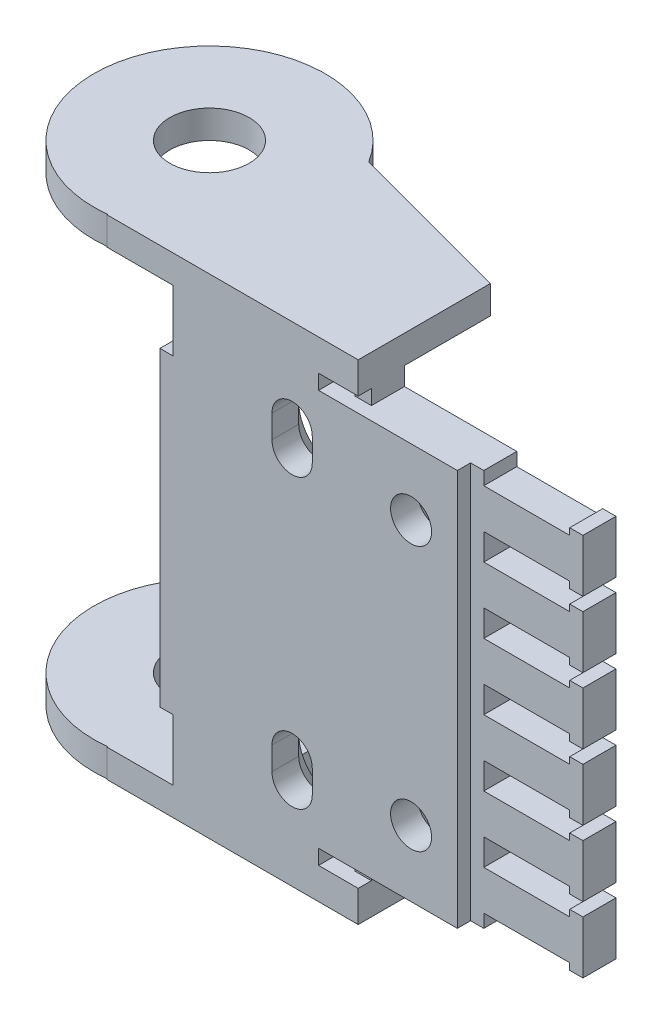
ISO-10303-21;
HEADER;
FILE_DESCRIPTION(('STEP AP214'),'2;1');
FILE_NAME('part.step','',(''),(''),'','','');
FILE_SCHEMA(('AUTOMOTIVE_DESIGN { 1 0 10303 214 1 1 1 1 }'));
ENDSEC;
DATA;
#1=APPLICATION_CONTEXT('core data for automotive mechanical design processes');
#2=APPLICATION_PROTOCOL_DEFINITION('international standard','automotive_design',2000,#1);
#3=PRODUCT_CONTEXT('',#1,'mechanical');
#4=PRODUCT('Part','Part','',(#3));
#5=PRODUCT_RELATED_PRODUCT_CATEGORY('part','',(#4));
#6=PRODUCT_DEFINITION_FORMATION('','',#4);
#7=PRODUCT_DEFINITION_CONTEXT('part definition',#1,'design');
#8=PRODUCT_DEFINITION('design','',#6,#7);
#9=PRODUCT_DEFINITION_SHAPE('','',#8);
#10=(LENGTH_UNIT() NAMED_UNIT(*) SI_UNIT(.MILLI.,.METRE.));
#11=(NAMED_UNIT(*) PLANE_ANGLE_UNIT() SI_UNIT($,.RADIAN.));
#12=(NAMED_UNIT(*) SI_UNIT($,.STERADIAN.) SOLID_ANGLE_UNIT());
#13=UNCERTAINTY_MEASURE_WITH_UNIT(LENGTH_MEASURE(1.E-05),#10,'distance_accuracy_value','');
#14=(GEOMETRIC_REPRESENTATION_CONTEXT(3) GLOBAL_UNCERTAINTY_ASSIGNED_CONTEXT((#13)) GLOBAL_UNIT_ASSIGNED_CONTEXT((#10,
#11,#12)) REPRESENTATION_CONTEXT('',''));
#15=CARTESIAN_POINT('',(0.,0.,0.));
#16=DIRECTION('',(0.,0.,1.));
#17=DIRECTION('',(1.,0.,0.));
#18=AXIS2_PLACEMENT_3D('',#15,#16,#17);
#19=CARTESIAN_POINT('',(-326.5,-1.49999999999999,123.));
#20=DIRECTION('',(-1.,0.,0.));
#21=DIRECTION('',(0.,0.,1.));
#22=AXIS2_PLACEMENT_3D('',#19,#20,#21);
#23=PLANE('',#22);
#24=DIRECTION('',(0.,0.,-1.));
#25=VECTOR('',#24,1.);
#26=CARTESIAN_POINT('',(-326.5,0.500000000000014,123.));
#27=LINE('',#26,#25);
#28=CARTESIAN_POINT('',(-326.5,0.500000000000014,120.5));
#29=VERTEX_POINT('',#28);
#30=CARTESIAN_POINT('',(-326.5,0.500000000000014,125.5));
#31=VERTEX_POINT('',#30);
#32=EDGE_CURVE('E1124',#29,#31,#27,.F.);
#33=ORIENTED_EDGE('',*,*,#32,.F.);
#34=DIRECTION('',(0.,1.,0.));
#35=VECTOR('',#34,1.);
#36=CARTESIAN_POINT('',(-326.5,-1.49999999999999,120.5));
#37=LINE('',#36,#35);
#38=CARTESIAN_POINT('',(-326.5,-0.499999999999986,120.5));
#39=VERTEX_POINT('',#38);
#40=EDGE_CURVE('E1241',#29,#39,#37,.F.);
#41=ORIENTED_EDGE('',*,*,#40,.T.);
#42=DIRECTION('',(0.,0.,-1.));
#43=VECTOR('',#42,1.);
#44=CARTESIAN_POINT('',(-326.5,-0.499999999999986,123.));
#45=LINE('',#44,#43);
#46=CARTESIAN_POINT('',(-326.5,-0.499999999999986,125.5));
#47=VERTEX_POINT('',#46);
#48=EDGE_CURVE('E1157',#47,#39,#45,.T.);
#49=ORIENTED_EDGE('',*,*,#48,.F.);
#50=DIRECTION('',(0.,1.,0.));
#51=VECTOR('',#50,1.);
#52=CARTESIAN_POINT('',(-326.5,-1.49999999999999,125.5));
#53=LINE('',#52,#51);
#54=EDGE_CURVE('E1245',#47,#31,#53,.T.);
#55=ORIENTED_EDGE('',*,*,#54,.T.);
#56=EDGE_LOOP('',(#33,#41,#49,#55));
#57=FACE_BOUND('',#56,.T.);
#58=ADVANCED_FACE('F16',(#57),#23,.T.);
#59=CARTESIAN_POINT('',(-326.5,58.5,123.));
#60=DIRECTION('',(-1.,0.,0.));
#61=DIRECTION('',(0.,0.,1.));
#62=AXIS2_PLACEMENT_3D('',#59,#60,#61);
#63=PLANE('',#62);
#64=DIRECTION('',(0.,0.,1.));
#65=VECTOR('',#64,1.);
#66=CARTESIAN_POINT('',(-326.5,56.5,123.));
#67=LINE('',#66,#65);
#68=CARTESIAN_POINT('',(-326.5,56.5,125.5));
#69=VERTEX_POINT('',#68);
#70=CARTESIAN_POINT('',(-326.5,56.5,120.5));
#71=VERTEX_POINT('',#70);
#72=EDGE_CURVE('E1108',#69,#71,#67,.F.);
#73=ORIENTED_EDGE('',*,*,#72,.F.);
#74=DIRECTION('',(0.,1.,0.));
#75=VECTOR('',#74,1.);
#76=CARTESIAN_POINT('',(-326.5,58.5,125.5));
#77=LINE('',#76,#75);
#78=CARTESIAN_POINT('',(-326.5,57.5,125.5));
#79=VERTEX_POINT('',#78);
#80=EDGE_CURVE('E1235',#69,#79,#77,.T.);
#81=ORIENTED_EDGE('',*,*,#80,.T.);
#82=DIRECTION('',(0.,0.,1.));
#83=VECTOR('',#82,1.);
#84=CARTESIAN_POINT('',(-326.5,57.5,123.));
#85=LINE('',#84,#83);
#86=CARTESIAN_POINT('',(-326.5,57.5,120.5));
#87=VERTEX_POINT('',#86);
#88=EDGE_CURVE('E1089',#87,#79,#85,.T.);
#89=ORIENTED_EDGE('',*,*,#88,.F.);
#90=DIRECTION('',(0.,1.,0.));
#91=VECTOR('',#90,1.);
#92=CARTESIAN_POINT('',(-326.5,58.5,120.5));
#93=LINE('',#92,#91);
#94=EDGE_CURVE('E1237',#87,#71,#93,.F.);
#95=ORIENTED_EDGE('',*,*,#94,.T.);
#96=EDGE_LOOP('',(#73,#81,#89,#95));
#97=FACE_BOUND('',#96,.T.);
#98=ADVANCED_FACE('F2741',(#97),#63,.T.);
#99=CARTESIAN_POINT('',(-326.5,48.5,123.));
#100=DIRECTION('',(-1.,0.,0.));
#101=DIRECTION('',(0.,0.,1.));
#102=AXIS2_PLACEMENT_3D('',#99,#100,#101);
#103=PLANE('',#102);
#104=DIRECTION('',(0.,0.,-1.));
#105=VECTOR('',#104,1.);
#106=CARTESIAN_POINT('',(-326.5,50.5,123.));
#107=LINE('',#106,#105);
#108=CARTESIAN_POINT('',(-326.5,50.5,120.5));
#109=VERTEX_POINT('',#108);
#110=CARTESIAN_POINT('',(-326.5,50.5,125.5));
#111=VERTEX_POINT('',#110);
#112=EDGE_CURVE('E1079',#109,#111,#107,.F.);
#113=ORIENTED_EDGE('',*,*,#112,.F.);
#114=DIRECTION('',(0.,1.,0.));
#115=VECTOR('',#114,1.);
#116=CARTESIAN_POINT('',(-326.5,48.5,120.5));
#117=LINE('',#116,#115);
#118=CARTESIAN_POINT('',(-326.5,49.5,120.5));
#119=VERTEX_POINT('',#118);
#120=EDGE_CURVE('E1231',#109,#119,#117,.F.);
#121=ORIENTED_EDGE('',*,*,#120,.T.);
#122=DIRECTION('',(0.,0.,-1.));
#123=VECTOR('',#122,1.);
#124=CARTESIAN_POINT('',(-326.5,49.5,123.));
#125=LINE('',#124,#123);
#126=CARTESIAN_POINT('',(-326.5,49.5,125.5));
#127=VERTEX_POINT('',#126);
#128=EDGE_CURVE('E1082',#127,#119,#125,.T.);
#129=ORIENTED_EDGE('',*,*,#128,.F.);
#130=DIRECTION('',(0.,1.,0.));
#131=VECTOR('',#130,1.);
#132=CARTESIAN_POINT('',(-326.5,48.5,125.5));
#133=LINE('',#132,#131);
#134=EDGE_CURVE('E1233',#127,#111,#133,.T.);
#135=ORIENTED_EDGE('',*,*,#134,.T.);
#136=EDGE_LOOP('',(#113,#121,#129,#135));
#137=FACE_BOUND('',#136,.T.);
#138=ADVANCED_FACE('F2732',(#137),#103,.T.);
#139=CARTESIAN_POINT('',(-326.5,48.5,123.));
#140=DIRECTION('',(-1.,0.,0.));
#141=DIRECTION('',(0.,0.,1.));
#142=AXIS2_PLACEMENT_3D('',#139,#140,#141);
#143=PLANE('',#142);
#144=DIRECTION('',(0.,0.,1.));
#145=VECTOR('',#144,1.);
#146=CARTESIAN_POINT('',(-326.5,46.5,123.));
#147=LINE('',#146,#145);
#148=CARTESIAN_POINT('',(-326.5,46.5,125.5));
#149=VERTEX_POINT('',#148);
#150=CARTESIAN_POINT('',(-326.5,46.5,120.5));
#151=VERTEX_POINT('',#150);
#152=EDGE_CURVE('E1072',#149,#151,#147,.F.);
#153=ORIENTED_EDGE('',*,*,#152,.F.);
#154=DIRECTION('',(0.,1.,0.));
#155=VECTOR('',#154,1.);
#156=CARTESIAN_POINT('',(-326.5,48.5,125.5));
#157=LINE('',#156,#155);
#158=CARTESIAN_POINT('',(-326.5,47.5,125.5));
#159=VERTEX_POINT('',#158);
#160=EDGE_CURVE('E1227',#149,#159,#157,.T.);
#161=ORIENTED_EDGE('',*,*,#160,.T.);
#162=DIRECTION('',(0.,0.,1.));
#163=VECTOR('',#162,1.);
#164=CARTESIAN_POINT('',(-326.5,47.5,123.));
#165=LINE('',#164,#163);
#166=CARTESIAN_POINT('',(-326.5,47.5,120.5));
#167=VERTEX_POINT('',#166);
#168=EDGE_CURVE('E1069',#167,#159,#165,.T.);
#169=ORIENTED_EDGE('',*,*,#168,.F.);
#170=DIRECTION('',(0.,1.,0.));
#171=VECTOR('',#170,1.);
#172=CARTESIAN_POINT('',(-326.5,48.5,120.5));
#173=LINE('',#172,#171);
#174=EDGE_CURVE('E1229',#167,#151,#173,.F.);
#175=ORIENTED_EDGE('',*,*,#174,.T.);
#176=EDGE_LOOP('',(#153,#161,#169,#175));
#177=FACE_BOUND('',#176,.T.);
#178=ADVANCED_FACE('F2723',(#177),#143,.T.);
#179=CARTESIAN_POINT('',(-326.5,38.5,123.));
#180=DIRECTION('',(-1.,0.,0.));
#181=DIRECTION('',(0.,0.,1.));
#182=AXIS2_PLACEMENT_3D('',#179,#180,#181);
#183=PLANE('',#182);
#184=DIRECTION('',(0.,0.,-1.));
#185=VECTOR('',#184,1.);
#186=CARTESIAN_POINT('',(-326.5,40.5,123.));
#187=LINE('',#186,#185);
#188=CARTESIAN_POINT('',(-326.5,40.5,120.5));
#189=VERTEX_POINT('',#188);
#190=CARTESIAN_POINT('',(-326.5,40.5,125.5));
#191=VERTEX_POINT('',#190);
#192=EDGE_CURVE('E1059',#189,#191,#187,.F.);
#193=ORIENTED_EDGE('',*,*,#192,.F.);
#194=DIRECTION('',(0.,1.,0.));
#195=VECTOR('',#194,1.);
#196=CARTESIAN_POINT('',(-326.5,38.5,120.5));
#197=LINE('',#196,#195);
#198=CARTESIAN_POINT('',(-326.5,39.5,120.5));
#199=VERTEX_POINT('',#198);
#200=EDGE_CURVE('E1223',#189,#199,#197,.F.);
#201=ORIENTED_EDGE('',*,*,#200,.T.);
#202=DIRECTION('',(0.,0.,-1.));
#203=VECTOR('',#202,1.);
#204=CARTESIAN_POINT('',(-326.5,39.5,123.));
#205=LINE('',#204,#203);
#206=CARTESIAN_POINT('',(-326.5,39.5,125.5));
#207=VERTEX_POINT('',#206);
#208=EDGE_CURVE('E1062',#207,#199,#205,.T.);
#209=ORIENTED_EDGE('',*,*,#208,.F.);
#210=DIRECTION('',(0.,1.,0.));
#211=VECTOR('',#210,1.);
#212=CARTESIAN_POINT('',(-326.5,38.5,125.5));
#213=LINE('',#212,#211);
#214=EDGE_CURVE('E1225',#207,#191,#213,.T.);
#215=ORIENTED_EDGE('',*,*,#214,.T.);
#216=EDGE_LOOP('',(#193,#201,#209,#215));
#217=FACE_BOUND('',#216,.T.);
#218=ADVANCED_FACE('F2714',(#217),#183,.T.);
#219=CARTESIAN_POINT('',(-326.5,38.5,123.));
#220=DIRECTION('',(-1.,0.,0.));
#221=DIRECTION('',(0.,0.,1.));
#222=AXIS2_PLACEMENT_3D('',#219,#220,#221);
#223=PLANE('',#222);
#224=DIRECTION('',(0.,0.,1.));
#225=VECTOR('',#224,1.);
#226=CARTESIAN_POINT('',(-326.5,36.5,123.));
#227=LINE('',#226,#225);
#228=CARTESIAN_POINT('',(-326.5,36.5,125.5));
#229=VERTEX_POINT('',#228);
#230=CARTESIAN_POINT('',(-326.5,36.5,120.5));
#231=VERTEX_POINT('',#230);
#232=EDGE_CURVE('E1052',#229,#231,#227,.F.);
#233=ORIENTED_EDGE('',*,*,#232,.F.);
#234=DIRECTION('',(0.,1.,0.));
#235=VECTOR('',#234,1.);
#236=CARTESIAN_POINT('',(-326.5,38.5,125.5));
#237=LINE('',#236,#235);
#238=CARTESIAN_POINT('',(-326.5,37.5,125.5));
#239=VERTEX_POINT('',#238);
#240=EDGE_CURVE('E1219',#229,#239,#237,.T.);
#241=ORIENTED_EDGE('',*,*,#240,.T.);
#242=DIRECTION('',(0.,0.,1.));
#243=VECTOR('',#242,1.);
#244=CARTESIAN_POINT('',(-326.5,37.5,123.));
#245=LINE('',#244,#243);
#246=CARTESIAN_POINT('',(-326.5,37.5,120.5));
#247=VERTEX_POINT('',#246);
#248=EDGE_CURVE('E1049',#247,#239,#245,.T.);
#249=ORIENTED_EDGE('',*,*,#248,.F.);
#250=DIRECTION('',(0.,1.,0.));
#251=VECTOR('',#250,1.);
#252=CARTESIAN_POINT('',(-326.5,38.5,120.5));
#253=LINE('',#252,#251);
#254=EDGE_CURVE('E1221',#247,#231,#253,.F.);
#255=ORIENTED_EDGE('',*,*,#254,.T.);
#256=EDGE_LOOP('',(#233,#241,#249,#255));
#257=FACE_BOUND('',#256,.T.);
#258=ADVANCED_FACE('F2705',(#257),#223,.T.);
#259=CARTESIAN_POINT('',(-326.5,28.5,123.));
#260=DIRECTION('',(-1.,0.,0.));
#261=DIRECTION('',(0.,0.,1.));
#262=AXIS2_PLACEMENT_3D('',#259,#260,#261);
#263=PLANE('',#262);
#264=DIRECTION('',(0.,0.,-1.));
#265=VECTOR('',#264,1.);
#266=CARTESIAN_POINT('',(-326.5,30.5,123.));
#267=LINE('',#266,#265);
#268=CARTESIAN_POINT('',(-326.5,30.5,120.5));
#269=VERTEX_POINT('',#268);
#270=CARTESIAN_POINT('',(-326.5,30.5,125.5));
#271=VERTEX_POINT('',#270);
#272=EDGE_CURVE('E1039',#269,#271,#267,.F.);
#273=ORIENTED_EDGE('',*,*,#272,.F.);
#274=DIRECTION('',(0.,1.,0.));
#275=VECTOR('',#274,1.);
#276=CARTESIAN_POINT('',(-326.5,28.5,120.5));
#277=LINE('',#276,#275);
#278=CARTESIAN_POINT('',(-326.5,29.5,120.5));
#279=VERTEX_POINT('',#278);
#280=EDGE_CURVE('E1215',#269,#279,#277,.F.);
#281=ORIENTED_EDGE('',*,*,#280,.T.);
#282=DIRECTION('',(0.,0.,-1.));
#283=VECTOR('',#282,1.);
#284=CARTESIAN_POINT('',(-326.5,29.5,123.));
#285=LINE('',#284,#283);
#286=CARTESIAN_POINT('',(-326.5,29.5,125.5));
#287=VERTEX_POINT('',#286);
#288=EDGE_CURVE('E1042',#287,#279,#285,.T.);
#289=ORIENTED_EDGE('',*,*,#288,.F.);
#290=DIRECTION('',(0.,1.,0.));
#291=VECTOR('',#290,1.);
#292=CARTESIAN_POINT('',(-326.5,28.5,125.5));
#293=LINE('',#292,#291);
#294=EDGE_CURVE('E1217',#287,#271,#293,.T.);
#295=ORIENTED_EDGE('',*,*,#294,.T.);
#296=EDGE_LOOP('',(#273,#281,#289,#295));
#297=FACE_BOUND('',#296,.T.);
#298=ADVANCED_FACE('F2696',(#297),#263,.T.);
#299=CARTESIAN_POINT('',(-326.5,28.5,123.));
#300=DIRECTION('',(-1.,0.,0.));
#301=DIRECTION('',(0.,0.,1.));
#302=AXIS2_PLACEMENT_3D('',#299,#300,#301);
#303=PLANE('',#302);
#304=DIRECTION('',(0.,0.,1.));
#305=VECTOR('',#304,1.);
#306=CARTESIAN_POINT('',(-326.5,26.5,123.));
#307=LINE('',#306,#305);
#308=CARTESIAN_POINT('',(-326.5,26.5,125.5));
#309=VERTEX_POINT('',#308);
#310=CARTESIAN_POINT('',(-326.5,26.5,120.5));
#311=VERTEX_POINT('',#310);
#312=EDGE_CURVE('E1032',#309,#311,#307,.F.);
#313=ORIENTED_EDGE('',*,*,#312,.F.);
#314=DIRECTION('',(0.,1.,0.));
#315=VECTOR('',#314,1.);
#316=CARTESIAN_POINT('',(-326.5,28.5,125.5));
#317=LINE('',#316,#315);
#318=CARTESIAN_POINT('',(-326.5,27.5,125.5));
#319=VERTEX_POINT('',#318);
#320=EDGE_CURVE('E1211',#309,#319,#317,.T.);
#321=ORIENTED_EDGE('',*,*,#320,.T.);
#322=DIRECTION('',(0.,0.,1.));
#323=VECTOR('',#322,1.);
#324=CARTESIAN_POINT('',(-326.5,27.5,123.));
#325=LINE('',#324,#323);
#326=CARTESIAN_POINT('',(-326.5,27.5,120.5));
#327=VERTEX_POINT('',#326);
#328=EDGE_CURVE('E1029',#327,#319,#325,.T.);
#329=ORIENTED_EDGE('',*,*,#328,.F.);
#330=DIRECTION('',(0.,1.,0.));
#331=VECTOR('',#330,1.);
#332=CARTESIAN_POINT('',(-326.5,28.5,120.5));
#333=LINE('',#332,#331);
#334=EDGE_CURVE('E1213',#327,#311,#333,.F.);
#335=ORIENTED_EDGE('',*,*,#334,.T.);
#336=EDGE_LOOP('',(#313,#321,#329,#335));
#337=FACE_BOUND('',#336,.T.);
#338=ADVANCED_FACE('F2687',(#337),#303,.T.);
#339=CARTESIAN_POINT('',(-326.5,18.5,123.));
#340=DIRECTION('',(-1.,0.,0.));
#341=DIRECTION('',(0.,0.,1.));
#342=AXIS2_PLACEMENT_3D('',#339,#340,#341);
#343=PLANE('',#342);
#344=DIRECTION('',(0.,0.,-1.));
#345=VECTOR('',#344,1.);
#346=CARTESIAN_POINT('',(-326.5,20.5,123.));
#347=LINE('',#346,#345);
#348=CARTESIAN_POINT('',(-326.5,20.5,120.5));
#349=VERTEX_POINT('',#348);
#350=CARTESIAN_POINT('',(-326.5,20.5,125.5));
#351=VERTEX_POINT('',#350);
#352=EDGE_CURVE('E1019',#349,#351,#347,.F.);
#353=ORIENTED_EDGE('',*,*,#352,.F.);
#354=DIRECTION('',(0.,1.,0.));
#355=VECTOR('',#354,1.);
#356=CARTESIAN_POINT('',(-326.5,18.5,120.5));
#357=LINE('',#356,#355);
#358=CARTESIAN_POINT('',(-326.5,19.5,120.5));
#359=VERTEX_POINT('',#358);
#360=EDGE_CURVE('E1207',#349,#359,#357,.F.);
#361=ORIENTED_EDGE('',*,*,#360,.T.);
#362=DIRECTION('',(0.,0.,-1.));
#363=VECTOR('',#362,1.);
#364=CARTESIAN_POINT('',(-326.5,19.5,123.));
#365=LINE('',#364,#363);
#366=CARTESIAN_POINT('',(-326.5,19.5,125.5));
#367=VERTEX_POINT('',#366);
#368=EDGE_CURVE('E1022',#367,#359,#365,.T.);
#369=ORIENTED_EDGE('',*,*,#368,.F.);
#370=DIRECTION('',(0.,1.,0.));
#371=VECTOR('',#370,1.);
#372=CARTESIAN_POINT('',(-326.5,18.5,125.5));
#373=LINE('',#372,#371);
#374=EDGE_CURVE('E1209',#367,#351,#373,.T.);
#375=ORIENTED_EDGE('',*,*,#374,.T.);
#376=EDGE_LOOP('',(#353,#361,#369,#375));
#377=FACE_BOUND('',#376,.T.);
#378=ADVANCED_FACE('F2678',(#377),#343,.T.);
#379=CARTESIAN_POINT('',(-326.5,18.5,123.));
#380=DIRECTION('',(-1.,0.,0.));
#381=DIRECTION('',(0.,0.,1.));
#382=AXIS2_PLACEMENT_3D('',#379,#380,#381);
#383=PLANE('',#382);
#384=DIRECTION('',(0.,0.,1.));
#385=VECTOR('',#384,1.);
#386=CARTESIAN_POINT('',(-326.5,16.5,123.));
#387=LINE('',#386,#385);
#388=CARTESIAN_POINT('',(-326.5,16.5,125.5));
#389=VERTEX_POINT('',#388);
#390=CARTESIAN_POINT('',(-326.5,16.5,120.5));
#391=VERTEX_POINT('',#390);
#392=EDGE_CURVE('E1012',#389,#391,#387,.F.);
#393=ORIENTED_EDGE('',*,*,#392,.F.);
#394=DIRECTION('',(0.,1.,0.));
#395=VECTOR('',#394,1.);
#396=CARTESIAN_POINT('',(-326.5,18.5,125.5));
#397=LINE('',#396,#395);
#398=CARTESIAN_POINT('',(-326.5,17.5,125.5));
#399=VERTEX_POINT('',#398);
#400=EDGE_CURVE('E1203',#389,#399,#397,.T.);
#401=ORIENTED_EDGE('',*,*,#400,.T.);
#402=DIRECTION('',(0.,0.,1.));
#403=VECTOR('',#402,1.);
#404=CARTESIAN_POINT('',(-326.5,17.5,123.));
#405=LINE('',#404,#403);
#406=CARTESIAN_POINT('',(-326.5,17.5,120.5));
#407=VERTEX_POINT('',#406);
#408=EDGE_CURVE('E1009',#407,#399,#405,.T.);
#409=ORIENTED_EDGE('',*,*,#408,.F.);
#410=DIRECTION('',(0.,1.,0.));
#411=VECTOR('',#410,1.);
#412=CARTESIAN_POINT('',(-326.5,18.5,120.5));
#413=LINE('',#412,#411);
#414=EDGE_CURVE('E1205',#407,#391,#413,.F.);
#415=ORIENTED_EDGE('',*,*,#414,.T.);
#416=EDGE_LOOP('',(#393,#401,#409,#415));
#417=FACE_BOUND('',#416,.T.);
#418=ADVANCED_FACE('F2669',(#417),#383,.T.);
#419=CARTESIAN_POINT('',(-326.5,8.50000000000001,123.));
#420=DIRECTION('',(-1.,0.,0.));
#421=DIRECTION('',(0.,0.,1.));
#422=AXIS2_PLACEMENT_3D('',#419,#420,#421);
#423=PLANE('',#422);
#424=DIRECTION('',(0.,0.,-1.));
#425=VECTOR('',#424,1.);
#426=CARTESIAN_POINT('',(-326.5,10.5,123.));
#427=LINE('',#426,#425);
#428=CARTESIAN_POINT('',(-326.5,10.5,120.5));
#429=VERTEX_POINT('',#428);
#430=CARTESIAN_POINT('',(-326.5,10.5,125.5));
#431=VERTEX_POINT('',#430);
#432=EDGE_CURVE('E999',#429,#431,#427,.F.);
#433=ORIENTED_EDGE('',*,*,#432,.F.);
#434=DIRECTION('',(0.,1.,0.));
#435=VECTOR('',#434,1.);
#436=CARTESIAN_POINT('',(-326.5,8.50000000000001,120.5));
#437=LINE('',#436,#435);
#438=CARTESIAN_POINT('',(-326.5,9.50000000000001,120.5));
#439=VERTEX_POINT('',#438);
#440=EDGE_CURVE('E1199',#429,#439,#437,.F.);
#441=ORIENTED_EDGE('',*,*,#440,.T.);
#442=DIRECTION('',(0.,0.,-1.));
#443=VECTOR('',#442,1.);
#444=CARTESIAN_POINT('',(-326.5,9.50000000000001,123.));
#445=LINE('',#444,#443);
#446=CARTESIAN_POINT('',(-326.5,9.50000000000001,125.5));
#447=VERTEX_POINT('',#446);
#448=EDGE_CURVE('E1002',#447,#439,#445,.T.);
#449=ORIENTED_EDGE('',*,*,#448,.F.);
#450=DIRECTION('',(0.,1.,0.));
#451=VECTOR('',#450,1.);
#452=CARTESIAN_POINT('',(-326.5,8.50000000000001,125.5));
#453=LINE('',#452,#451);
#454=EDGE_CURVE('E1201',#447,#431,#453,.T.);
#455=ORIENTED_EDGE('',*,*,#454,.T.);
#456=EDGE_LOOP('',(#433,#441,#449,#455));
#457=FACE_BOUND('',#456,.T.);
#458=ADVANCED_FACE('F2660',(#457),#423,.T.);
#459=CARTESIAN_POINT('',(-326.5,8.50000000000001,123.));
#460=DIRECTION('',(-1.,0.,0.));
#461=DIRECTION('',(0.,0.,1.));
#462=AXIS2_PLACEMENT_3D('',#459,#460,#461);
#463=PLANE('',#462);
#464=DIRECTION('',(0.,0.,1.));
#465=VECTOR('',#464,1.);
#466=CARTESIAN_POINT('',(-326.5,6.50000000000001,123.));
#467=LINE('',#466,#465);
#468=CARTESIAN_POINT('',(-326.5,6.50000000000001,125.5));
#469=VERTEX_POINT('',#468);
#470=CARTESIAN_POINT('',(-326.5,6.50000000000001,120.5));
#471=VERTEX_POINT('',#470);
#472=EDGE_CURVE('E992',#469,#471,#467,.F.);
#473=ORIENTED_EDGE('',*,*,#472,.F.);
#474=DIRECTION('',(0.,1.,0.));
#475=VECTOR('',#474,1.);
#476=CARTESIAN_POINT('',(-326.5,8.50000000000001,125.5));
#477=LINE('',#476,#475);
#478=CARTESIAN_POINT('',(-326.5,7.50000000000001,125.5));
#479=VERTEX_POINT('',#478);
#480=EDGE_CURVE('E1160',#469,#479,#477,.T.);
#481=ORIENTED_EDGE('',*,*,#480,.T.);
#482=DIRECTION('',(0.,0.,1.));
#483=VECTOR('',#482,1.);
#484=CARTESIAN_POINT('',(-326.5,7.50000000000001,123.));
#485=LINE('',#484,#483);
#486=CARTESIAN_POINT('',(-326.5,7.50000000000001,120.5));
#487=VERTEX_POINT('',#486);
#488=EDGE_CURVE('E989',#487,#479,#485,.T.);
#489=ORIENTED_EDGE('',*,*,#488,.F.);
#490=DIRECTION('',(0.,1.,0.));
#491=VECTOR('',#490,1.);
#492=CARTESIAN_POINT('',(-326.5,8.50000000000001,120.5));
#493=LINE('',#492,#491);
#494=EDGE_CURVE('E1197',#487,#471,#493,.F.);
#495=ORIENTED_EDGE('',*,*,#494,.T.);
#496=EDGE_LOOP('',(#473,#481,#489,#495));
#497=FACE_BOUND('',#496,.T.);
#498=ADVANCED_FACE('F2651',(#497),#463,.T.);
#499=CARTESIAN_POINT('',(-325.5,-0.499999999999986,123.));
#500=DIRECTION('',(0.,-1.,0.));
#501=DIRECTION('',(0.,0.,-1.));
#502=AXIS2_PLACEMENT_3D('',#499,#500,#501);
#503=PLANE('',#502);
#504=ORIENTED_EDGE('',*,*,#48,.T.);
#505=DIRECTION('',(-1.,0.,0.));
#506=VECTOR('',#505,1.);
#507=CARTESIAN_POINT('',(-324.5,-0.499999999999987,120.5));
#508=LINE('',#507,#506);
#509=CARTESIAN_POINT('',(-324.5,-0.499999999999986,120.5));
#510=VERTEX_POINT('',#509);
#511=EDGE_CURVE('E1332',#510,#39,#508,.T.);
#512=ORIENTED_EDGE('',*,*,#511,.F.);
#513=DIRECTION('',(0.,0.,-1.));
#514=VECTOR('',#513,1.);
#515=CARTESIAN_POINT('',(-324.5,-0.499999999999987,125.5));
#516=LINE('',#515,#514);
#517=CARTESIAN_POINT('',(-324.5,-0.499999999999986,125.5));
#518=VERTEX_POINT('',#517);
#519=EDGE_CURVE('E986',#518,#510,#516,.T.);
#520=ORIENTED_EDGE('',*,*,#519,.F.);
#521=DIRECTION('',(1.,0.,0.));
#522=VECTOR('',#521,1.);
#523=CARTESIAN_POINT('',(-341.5,-0.499999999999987,125.5));
#524=LINE('',#523,#522);
#525=EDGE_CURVE('E876',#47,#518,#524,.T.);
#526=ORIENTED_EDGE('',*,*,#525,.F.);
#527=EDGE_LOOP('',(#504,#512,#520,#526));
#528=FACE_BOUND('',#527,.T.);
#529=ADVANCED_FACE('F2642',(#528),#503,.T.);
#530=CARTESIAN_POINT('',(-333.,0.500000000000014,123.));
#531=DIRECTION('',(0.,-1.,0.));
#532=DIRECTION('',(0.,0.,-1.));
#533=AXIS2_PLACEMENT_3D('',#530,#531,#532);
#534=PLANE('',#533);
#535=DIRECTION('',(0.,0.,-1.));
#536=VECTOR('',#535,1.);
#537=CARTESIAN_POINT('',(-339.5,0.500000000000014,123.));
#538=LINE('',#537,#536);
#539=CARTESIAN_POINT('',(-339.5,0.500000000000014,120.5));
#540=VERTEX_POINT('',#539);
#541=CARTESIAN_POINT('',(-339.5,0.500000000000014,125.5));
#542=VERTEX_POINT('',#541);
#543=EDGE_CURVE('E879',#540,#542,#538,.F.);
#544=ORIENTED_EDGE('',*,*,#543,.F.);
#545=DIRECTION('',(-1.,0.,0.));
#546=VECTOR('',#545,1.);
#547=CARTESIAN_POINT('',(-324.5,0.500000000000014,120.5));
#548=LINE('',#547,#546);
#549=EDGE_CURVE('E1706',#29,#540,#548,.T.);
#550=ORIENTED_EDGE('',*,*,#549,.F.);
#551=ORIENTED_EDGE('',*,*,#32,.T.);
#552=DIRECTION('',(1.,0.,0.));
#553=VECTOR('',#552,1.);
#554=CARTESIAN_POINT('',(-341.5,0.500000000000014,125.5));
#555=LINE('',#554,#553);
#556=EDGE_CURVE('E774',#542,#31,#555,.T.);
#557=ORIENTED_EDGE('',*,*,#556,.F.);
#558=EDGE_LOOP('',(#544,#550,#551,#557));
#559=FACE_BOUND('',#558,.T.);
#560=ADVANCED_FACE('F2633',(#559),#534,.T.);
#561=CARTESIAN_POINT('',(-374.5,28.5,103.));
#562=DIRECTION('',(1.,0.,0.));
#563=DIRECTION('',(0.,0.,-1.));
#564=AXIS2_PLACEMENT_3D('',#561,#562,#563);
#565=PLANE('',#564);
#566=DIRECTION('',(0.,1.,0.));
#567=VECTOR('',#566,1.);
#568=CARTESIAN_POINT('',(-374.5,58.5,120.5));
#569=LINE('',#568,#567);
#570=CARTESIAN_POINT('',(-374.5,-4.24999999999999,120.5));
#571=VERTEX_POINT('',#570);
#572=CARTESIAN_POINT('',(-374.5,0.,120.5));
#573=VERTEX_POINT('',#572);
#574=EDGE_CURVE('E1120',#571,#573,#569,.T.);
#575=ORIENTED_EDGE('',*,*,#574,.F.);
#576=DIRECTION('',(0.,0.,1.));
#577=VECTOR('',#576,1.);
#578=CARTESIAN_POINT('',(-374.5,-4.24999999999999,103.));
#579=LINE('',#578,#577);
#580=CARTESIAN_POINT('',(-374.5,-4.24999999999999,102.67691453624));
#581=VERTEX_POINT('',#580);
#582=EDGE_CURVE('E1137',#581,#571,#579,.T.);
#583=ORIENTED_EDGE('',*,*,#582,.F.);
#584=DIRECTION('',(0.,1.,0.));
#585=VECTOR('',#584,1.);
#586=CARTESIAN_POINT('',(-374.5,65.5,102.67691453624));
#587=LINE('',#586,#585);
#588=CARTESIAN_POINT('',(-374.5,0.,102.67691453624));
#589=VERTEX_POINT('',#588);
#590=EDGE_CURVE('E1163',#589,#581,#587,.F.);
#591=ORIENTED_EDGE('',*,*,#590,.F.);
#592=DIRECTION('',(0.,0.,1.));
#593=VECTOR('',#592,1.);
#594=CARTESIAN_POINT('',(-374.5,0.,110.));
#595=LINE('',#594,#593);
#596=EDGE_CURVE('E1109',#573,#589,#595,.F.);
#597=ORIENTED_EDGE('',*,*,#596,.F.);
#598=EDGE_LOOP('',(#575,#583,#591,#597));
#599=FACE_BOUND('',#598,.T.);
#600=ADVANCED_FACE('F2624',(#599),#565,.T.);
#601=CARTESIAN_POINT('',(-385.25,0.,110.));
#602=DIRECTION('',(0.,1.,0.));
#603=DIRECTION('',(0.,0.,1.));
#604=AXIS2_PLACEMENT_3D('',#601,#602,#603);
#605=PLANE('',#604);
#606=CARTESIAN_POINT('',(-396.5,0.,110.));
#607=DIRECTION('',(0.,1.,0.));
#608=DIRECTION('',(0.,0.,1.));
#609=AXIS2_PLACEMENT_3D('',#606,#607,#608);
#610=CIRCLE('',#609,17.7);
#611=CARTESIAN_POINT('',(-381.354384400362,0.,100.84028777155));
#612=VERTEX_POINT('',#611);
#613=CARTESIAN_POINT('',(-382.250789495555,0.,120.5));
#614=VERTEX_POINT('',#613);
#615=EDGE_CURVE('E19',#612,#614,#610,.F.);
#616=ORIENTED_EDGE('',*,*,#615,.T.);
#617=DIRECTION('',(-1.,0.,0.));
#618=VECTOR('',#617,1.);
#619=CARTESIAN_POINT('',(-324.5,0.,120.5));
#620=LINE('',#619,#618);
#621=EDGE_CURVE('E1117',#573,#614,#620,.T.);
#622=ORIENTED_EDGE('',*,*,#621,.F.);
#623=ORIENTED_EDGE('',*,*,#596,.T.);
#624=DIRECTION('',(-0.965925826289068,0.,-0.258819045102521));
#625=VECTOR('',#624,1.);
#626=CARTESIAN_POINT('',(-356.5,0.,107.5));
#627=LINE('',#626,#625);
#628=EDGE_CURVE('E1167',#612,#589,#627,.F.);
#629=ORIENTED_EDGE('',*,*,#628,.F.);
#630=EDGE_LOOP('',(#616,#622,#623,#629));
#631=FACE_BOUND('',#630,.T.);
#632=ADVANCED_FACE('F2616',(#631),#605,.T.);
#633=CARTESIAN_POINT('',(-385.25,57.,110.));
#634=DIRECTION('',(0.,1.,0.));
#635=DIRECTION('',(0.,0.,1.));
#636=AXIS2_PLACEMENT_3D('',#633,#634,#635);
#637=PLANE('',#636);
#638=DIRECTION('',(-1.,0.,0.));
#639=VECTOR('',#638,1.);
#640=CARTESIAN_POINT('',(-324.5,57.,120.5));
#641=LINE('',#640,#639);
#642=CARTESIAN_POINT('',(-382.250789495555,57.,120.5));
#643=VERTEX_POINT('',#642);
#644=CARTESIAN_POINT('',(-374.5,57.,120.5));
#645=VERTEX_POINT('',#644);
#646=EDGE_CURVE('E635',#643,#645,#641,.F.);
#647=ORIENTED_EDGE('',*,*,#646,.F.);
#648=CARTESIAN_POINT('',(-396.5,57.,110.));
#649=DIRECTION('',(0.,1.,0.));
#650=DIRECTION('',(0.,0.,1.));
#651=AXIS2_PLACEMENT_3D('',#648,#649,#650);
#652=CIRCLE('',#651,17.7);
#653=CARTESIAN_POINT('',(-381.354384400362,57.,100.84028777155));
#654=VERTEX_POINT('',#653);
#655=EDGE_CURVE('E629',#643,#654,#652,.T.);
#656=ORIENTED_EDGE('',*,*,#655,.T.);
#657=DIRECTION('',(-0.965925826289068,0.,-0.258819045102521));
#658=VECTOR('',#657,1.);
#659=CARTESIAN_POINT('',(-356.5,57.,107.5));
#660=LINE('',#659,#658);
#661=CARTESIAN_POINT('',(-374.5,57.,102.67691453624));
#662=VERTEX_POINT('',#661);
#663=EDGE_CURVE('E632',#662,#654,#660,.T.);
#664=ORIENTED_EDGE('',*,*,#663,.F.);
#665=DIRECTION('',(0.,0.,-1.));
#666=VECTOR('',#665,1.);
#667=CARTESIAN_POINT('',(-374.5,57.,103.));
#668=LINE('',#667,#666);
#669=EDGE_CURVE('E1106',#645,#662,#668,.T.);
#670=ORIENTED_EDGE('',*,*,#669,.F.);
#671=EDGE_LOOP('',(#647,#656,#664,#670));
#672=FACE_BOUND('',#671,.T.);
#673=ADVANCED_FACE('F631',(#672),#637,.F.);
#674=CARTESIAN_POINT('',(-374.5,28.5,103.));
#675=DIRECTION('',(1.,0.,0.));
#676=DIRECTION('',(0.,0.,-1.));
#677=AXIS2_PLACEMENT_3D('',#674,#675,#676);
#678=PLANE('',#677);
#679=DIRECTION('',(0.,1.,0.));
#680=VECTOR('',#679,1.);
#681=CARTESIAN_POINT('',(-374.5,58.5,120.5));
#682=LINE('',#681,#680);
#683=CARTESIAN_POINT('',(-374.5,61.25,120.5));
#684=VERTEX_POINT('',#683);
#685=EDGE_CURVE('E704',#645,#684,#682,.T.);
#686=ORIENTED_EDGE('',*,*,#685,.F.);
#687=ORIENTED_EDGE('',*,*,#669,.T.);
#688=DIRECTION('',(0.,1.,0.));
#689=VECTOR('',#688,1.);
#690=CARTESIAN_POINT('',(-374.5,65.5,102.67691453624));
#691=LINE('',#690,#689);
#692=CARTESIAN_POINT('',(-374.5,61.25,102.67691453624));
#693=VERTEX_POINT('',#692);
#694=EDGE_CURVE('E647',#693,#662,#691,.F.);
#695=ORIENTED_EDGE('',*,*,#694,.F.);
#696=DIRECTION('',(0.,0.,1.));
#697=VECTOR('',#696,1.);
#698=CARTESIAN_POINT('',(-374.5,61.25,103.));
#699=LINE('',#698,#697);
#700=EDGE_CURVE('E688',#693,#684,#699,.T.);
#701=ORIENTED_EDGE('',*,*,#700,.T.);
#702=EDGE_LOOP('',(#686,#687,#695,#701));
#703=FACE_BOUND('',#702,.T.);
#704=ADVANCED_FACE('F2599',(#703),#678,.T.);
#705=CARTESIAN_POINT('',(-333.,56.5,123.));
#706=DIRECTION('',(0.,1.,0.));
#707=DIRECTION('',(0.,0.,1.));
#708=AXIS2_PLACEMENT_3D('',#705,#706,#707);
#709=PLANE('',#708);
#710=ORIENTED_EDGE('',*,*,#72,.T.);
#711=DIRECTION('',(-1.,0.,0.));
#712=VECTOR('',#711,1.);
#713=CARTESIAN_POINT('',(-324.5,56.5,120.5));
#714=LINE('',#713,#712);
#715=CARTESIAN_POINT('',(-339.5,56.5,120.5));
#716=VERTEX_POINT('',#715);
#717=EDGE_CURVE('E731',#716,#71,#714,.F.);
#718=ORIENTED_EDGE('',*,*,#717,.F.);
#719=DIRECTION('',(0.,0.,-1.));
#720=VECTOR('',#719,1.);
#721=CARTESIAN_POINT('',(-339.5,56.5,123.));
#722=LINE('',#721,#720);
#723=CARTESIAN_POINT('',(-339.5,56.5,125.5));
#724=VERTEX_POINT('',#723);
#725=EDGE_CURVE('E1090',#724,#716,#722,.T.);
#726=ORIENTED_EDGE('',*,*,#725,.F.);
#727=DIRECTION('',(1.,0.,0.));
#728=VECTOR('',#727,1.);
#729=CARTESIAN_POINT('',(-341.5,56.5,125.5));
#730=LINE('',#729,#728);
#731=EDGE_CURVE('E781',#69,#724,#730,.F.);
#732=ORIENTED_EDGE('',*,*,#731,.F.);
#733=EDGE_LOOP('',(#710,#718,#726,#732));
#734=FACE_BOUND('',#733,.T.);
#735=ADVANCED_FACE('F2590',(#734),#709,.T.);
#736=CARTESIAN_POINT('',(-325.5,57.5,123.));
#737=DIRECTION('',(0.,1.,0.));
#738=DIRECTION('',(0.,0.,1.));
#739=AXIS2_PLACEMENT_3D('',#736,#737,#738);
#740=PLANE('',#739);
#741=DIRECTION('',(0.,0.,-1.));
#742=VECTOR('',#741,1.);
#743=CARTESIAN_POINT('',(-324.5,57.5,125.5));
#744=LINE('',#743,#742);
#745=CARTESIAN_POINT('',(-324.5,57.5,120.5));
#746=VERTEX_POINT('',#745);
#747=CARTESIAN_POINT('',(-324.5,57.5,125.5));
#748=VERTEX_POINT('',#747);
#749=EDGE_CURVE('E1087',#746,#748,#744,.F.);
#750=ORIENTED_EDGE('',*,*,#749,.F.);
#751=DIRECTION('',(-1.,0.,0.));
#752=VECTOR('',#751,1.);
#753=CARTESIAN_POINT('',(-324.5,57.5,120.5));
#754=LINE('',#753,#752);
#755=EDGE_CURVE('E1096',#87,#746,#754,.F.);
#756=ORIENTED_EDGE('',*,*,#755,.F.);
#757=ORIENTED_EDGE('',*,*,#88,.T.);
#758=DIRECTION('',(1.,0.,0.));
#759=VECTOR('',#758,1.);
#760=CARTESIAN_POINT('',(-341.5,57.5,125.5));
#761=LINE('',#760,#759);
#762=EDGE_CURVE('E785',#748,#79,#761,.F.);
#763=ORIENTED_EDGE('',*,*,#762,.F.);
#764=EDGE_LOOP('',(#750,#756,#757,#763));
#765=FACE_BOUND('',#764,.T.);
#766=ADVANCED_FACE('F2581',(#765),#740,.T.);
#767=CARTESIAN_POINT('',(-324.5,58.5,125.5));
#768=DIRECTION('',(1.,0.,0.));
#769=DIRECTION('',(0.,0.,-1.));
#770=AXIS2_PLACEMENT_3D('',#767,#768,#769);
#771=PLANE('',#770);
#772=ORIENTED_EDGE('',*,*,#749,.T.);
#773=DIRECTION('',(0.,1.,0.));
#774=VECTOR('',#773,1.);
#775=CARTESIAN_POINT('',(-324.5,58.5,125.5));
#776=LINE('',#775,#774);
#777=CARTESIAN_POINT('',(-324.5,49.5,125.5));
#778=VERTEX_POINT('',#777);
#779=EDGE_CURVE('E782',#778,#748,#776,.T.);
#780=ORIENTED_EDGE('',*,*,#779,.F.);
#781=DIRECTION('',(0.,0.,-1.));
#782=VECTOR('',#781,1.);
#783=CARTESIAN_POINT('',(-324.5,49.5,123.));
#784=LINE('',#783,#782);
#785=CARTESIAN_POINT('',(-324.5,49.5,120.5));
#786=VERTEX_POINT('',#785);
#787=EDGE_CURVE('E1085',#786,#778,#784,.F.);
#788=ORIENTED_EDGE('',*,*,#787,.F.);
#789=DIRECTION('',(0.,1.,0.));
#790=VECTOR('',#789,1.);
#791=CARTESIAN_POINT('',(-324.5,58.5,120.5));
#792=LINE('',#791,#790);
#793=EDGE_CURVE('E1257',#746,#786,#792,.F.);
#794=ORIENTED_EDGE('',*,*,#793,.F.);
#795=EDGE_LOOP('',(#772,#780,#788,#794));
#796=FACE_BOUND('',#795,.T.);
#797=ADVANCED_FACE('F2572',(#796),#771,.T.);
#798=CARTESIAN_POINT('',(-325.5,49.5,123.));
#799=DIRECTION('',(0.,-1.,0.));
#800=DIRECTION('',(0.,0.,-1.));
#801=AXIS2_PLACEMENT_3D('',#798,#799,#800);
#802=PLANE('',#801);
#803=ORIENTED_EDGE('',*,*,#128,.T.);
#804=DIRECTION('',(-1.,0.,0.));
#805=VECTOR('',#804,1.);
#806=CARTESIAN_POINT('',(-324.5,49.5,120.5));
#807=LINE('',#806,#805);
#808=EDGE_CURVE('E1699',#786,#119,#807,.T.);
#809=ORIENTED_EDGE('',*,*,#808,.F.);
#810=ORIENTED_EDGE('',*,*,#787,.T.);
#811=DIRECTION('',(1.,0.,0.));
#812=VECTOR('',#811,1.);
#813=CARTESIAN_POINT('',(-341.5,49.5,125.5));
#814=LINE('',#813,#812);
#815=EDGE_CURVE('E786',#127,#778,#814,.T.);
#816=ORIENTED_EDGE('',*,*,#815,.F.);
#817=EDGE_LOOP('',(#803,#809,#810,#816));
#818=FACE_BOUND('',#817,.T.);
#819=ADVANCED_FACE('F2563',(#818),#802,.T.);
#820=CARTESIAN_POINT('',(-333.,50.5,123.));
#821=DIRECTION('',(0.,-1.,0.));
#822=DIRECTION('',(0.,0.,-1.));
#823=AXIS2_PLACEMENT_3D('',#820,#821,#822);
#824=PLANE('',#823);
#825=DIRECTION('',(0.,0.,-1.));
#826=VECTOR('',#825,1.);
#827=CARTESIAN_POINT('',(-339.5,50.5,123.));
#828=LINE('',#827,#826);
#829=CARTESIAN_POINT('',(-339.5,50.5,120.5));
#830=VERTEX_POINT('',#829);
#831=CARTESIAN_POINT('',(-339.5,50.5,125.5));
#832=VERTEX_POINT('',#831);
#833=EDGE_CURVE('E1077',#830,#832,#828,.F.);
#834=ORIENTED_EDGE('',*,*,#833,.F.);
#835=DIRECTION('',(-1.,0.,0.));
#836=VECTOR('',#835,1.);
#837=CARTESIAN_POINT('',(-324.5,50.5,120.5));
#838=LINE('',#837,#836);
#839=EDGE_CURVE('E1696',#109,#830,#838,.T.);
#840=ORIENTED_EDGE('',*,*,#839,.F.);
#841=ORIENTED_EDGE('',*,*,#112,.T.);
#842=DIRECTION('',(1.,0.,0.));
#843=VECTOR('',#842,1.);
#844=CARTESIAN_POINT('',(-341.5,50.5,125.5));
#845=LINE('',#844,#843);
#846=EDGE_CURVE('E789',#832,#111,#845,.T.);
#847=ORIENTED_EDGE('',*,*,#846,.F.);
#848=EDGE_LOOP('',(#834,#840,#841,#847));
#849=FACE_BOUND('',#848,.T.);
#850=ADVANCED_FACE('F2554',(#849),#824,.T.);
#851=CARTESIAN_POINT('',(-339.5,48.5,123.));
#852=DIRECTION('',(1.,0.,0.));
#853=DIRECTION('',(0.,0.,-1.));
#854=AXIS2_PLACEMENT_3D('',#851,#852,#853);
#855=PLANE('',#854);
#856=DIRECTION('',(0.,0.,1.));
#857=VECTOR('',#856,1.);
#858=CARTESIAN_POINT('',(-339.5,46.5,123.));
#859=LINE('',#858,#857);
#860=CARTESIAN_POINT('',(-339.5,46.5,120.5));
#861=VERTEX_POINT('',#860);
#862=CARTESIAN_POINT('',(-339.5,46.5,125.5));
#863=VERTEX_POINT('',#862);
#864=EDGE_CURVE('E1075',#861,#863,#859,.T.);
#865=ORIENTED_EDGE('',*,*,#864,.F.);
#866=DIRECTION('',(0.,1.,0.));
#867=VECTOR('',#866,1.);
#868=CARTESIAN_POINT('',(-339.5,58.5,120.5));
#869=LINE('',#868,#867);
#870=EDGE_CURVE('E1693',#830,#861,#869,.F.);
#871=ORIENTED_EDGE('',*,*,#870,.F.);
#872=ORIENTED_EDGE('',*,*,#833,.T.);
#873=DIRECTION('',(0.,1.,0.));
#874=VECTOR('',#873,1.);
#875=CARTESIAN_POINT('',(-339.5,58.5,125.5));
#876=LINE('',#875,#874);
#877=EDGE_CURVE('E792',#863,#832,#876,.T.);
#878=ORIENTED_EDGE('',*,*,#877,.F.);
#879=EDGE_LOOP('',(#865,#871,#872,#878));
#880=FACE_BOUND('',#879,.T.);
#881=ADVANCED_FACE('F2545',(#880),#855,.T.);
#882=CARTESIAN_POINT('',(-333.,46.5,123.));
#883=DIRECTION('',(0.,1.,0.));
#884=DIRECTION('',(0.,0.,1.));
#885=AXIS2_PLACEMENT_3D('',#882,#883,#884);
#886=PLANE('',#885);
#887=ORIENTED_EDGE('',*,*,#152,.T.);
#888=DIRECTION('',(-1.,0.,0.));
#889=VECTOR('',#888,1.);
#890=CARTESIAN_POINT('',(-324.5,46.5,120.5));
#891=LINE('',#890,#889);
#892=EDGE_CURVE('E1690',#861,#151,#891,.F.);
#893=ORIENTED_EDGE('',*,*,#892,.F.);
#894=ORIENTED_EDGE('',*,*,#864,.T.);
#895=DIRECTION('',(1.,0.,0.));
#896=VECTOR('',#895,1.);
#897=CARTESIAN_POINT('',(-341.5,46.5,125.5));
#898=LINE('',#897,#896);
#899=EDGE_CURVE('E795',#149,#863,#898,.F.);
#900=ORIENTED_EDGE('',*,*,#899,.F.);
#901=EDGE_LOOP('',(#887,#893,#894,#900));
#902=FACE_BOUND('',#901,.T.);
#903=ADVANCED_FACE('F2536',(#902),#886,.T.);
#904=CARTESIAN_POINT('',(-325.5,47.5,123.));
#905=DIRECTION('',(0.,1.,0.));
#906=DIRECTION('',(0.,0.,1.));
#907=AXIS2_PLACEMENT_3D('',#904,#905,#906);
#908=PLANE('',#907);
#909=DIRECTION('',(0.,0.,-1.));
#910=VECTOR('',#909,1.);
#911=CARTESIAN_POINT('',(-324.5,47.5,125.5));
#912=LINE('',#911,#910);
#913=CARTESIAN_POINT('',(-324.5,47.5,120.5));
#914=VERTEX_POINT('',#913);
#915=CARTESIAN_POINT('',(-324.5,47.5,125.5));
#916=VERTEX_POINT('',#915);
#917=EDGE_CURVE('E1067',#914,#916,#912,.F.);
#918=ORIENTED_EDGE('',*,*,#917,.F.);
#919=DIRECTION('',(-1.,0.,0.));
#920=VECTOR('',#919,1.);
#921=CARTESIAN_POINT('',(-324.5,47.5,120.5));
#922=LINE('',#921,#920);
#923=EDGE_CURVE('E1687',#167,#914,#922,.F.);
#924=ORIENTED_EDGE('',*,*,#923,.F.);
#925=ORIENTED_EDGE('',*,*,#168,.T.);
#926=DIRECTION('',(1.,0.,0.));
#927=VECTOR('',#926,1.);
#928=CARTESIAN_POINT('',(-341.5,47.5,125.5));
#929=LINE('',#928,#927);
#930=EDGE_CURVE('E798',#916,#159,#929,.F.);
#931=ORIENTED_EDGE('',*,*,#930,.F.);
#932=EDGE_LOOP('',(#918,#924,#925,#931));
#933=FACE_BOUND('',#932,.T.);
#934=ADVANCED_FACE('F2527',(#933),#908,.T.);
#935=CARTESIAN_POINT('',(-324.5,58.5,125.5));
#936=DIRECTION('',(1.,0.,0.));
#937=DIRECTION('',(0.,0.,-1.));
#938=AXIS2_PLACEMENT_3D('',#935,#936,#937);
#939=PLANE('',#938);
#940=ORIENTED_EDGE('',*,*,#917,.T.);
#941=DIRECTION('',(0.,1.,0.));
#942=VECTOR('',#941,1.);
#943=CARTESIAN_POINT('',(-324.5,58.5,125.5));
#944=LINE('',#943,#942);
#945=CARTESIAN_POINT('',(-324.5,39.5,125.5));
#946=VERTEX_POINT('',#945);
#947=EDGE_CURVE('E801',#946,#916,#944,.T.);
#948=ORIENTED_EDGE('',*,*,#947,.F.);
#949=DIRECTION('',(0.,0.,-1.));
#950=VECTOR('',#949,1.);
#951=CARTESIAN_POINT('',(-324.5,39.5,123.));
#952=LINE('',#951,#950);
#953=CARTESIAN_POINT('',(-324.5,39.5,120.5));
#954=VERTEX_POINT('',#953);
#955=EDGE_CURVE('E1065',#954,#946,#952,.F.);
#956=ORIENTED_EDGE('',*,*,#955,.F.);
#957=DIRECTION('',(0.,1.,0.));
#958=VECTOR('',#957,1.);
#959=CARTESIAN_POINT('',(-324.5,58.5,120.5));
#960=LINE('',#959,#958);
#961=EDGE_CURVE('E1684',#914,#954,#960,.F.);
#962=ORIENTED_EDGE('',*,*,#961,.F.);
#963=EDGE_LOOP('',(#940,#948,#956,#962));
#964=FACE_BOUND('',#963,.T.);
#965=ADVANCED_FACE('F2518',(#964),#939,.T.);
#966=CARTESIAN_POINT('',(-325.5,39.5,123.));
#967=DIRECTION('',(0.,-1.,0.));
#968=DIRECTION('',(0.,0.,-1.));
#969=AXIS2_PLACEMENT_3D('',#966,#967,#968);
#970=PLANE('',#969);
#971=ORIENTED_EDGE('',*,*,#208,.T.);
#972=DIRECTION('',(-1.,0.,0.));
#973=VECTOR('',#972,1.);
#974=CARTESIAN_POINT('',(-324.5,39.5,120.5));
#975=LINE('',#974,#973);
#976=EDGE_CURVE('E1681',#954,#199,#975,.T.);
#977=ORIENTED_EDGE('',*,*,#976,.F.);
#978=ORIENTED_EDGE('',*,*,#955,.T.);
#979=DIRECTION('',(1.,0.,0.));
#980=VECTOR('',#979,1.);
#981=CARTESIAN_POINT('',(-341.5,39.5,125.5));
#982=LINE('',#981,#980);
#983=EDGE_CURVE('E804',#207,#946,#982,.T.);
#984=ORIENTED_EDGE('',*,*,#983,.F.);
#985=EDGE_LOOP('',(#971,#977,#978,#984));
#986=FACE_BOUND('',#985,.T.);
#987=ADVANCED_FACE('F2509',(#986),#970,.T.);
#988=CARTESIAN_POINT('',(-333.,40.5,123.));
#989=DIRECTION('',(0.,-1.,0.));
#990=DIRECTION('',(0.,0.,-1.));
#991=AXIS2_PLACEMENT_3D('',#988,#989,#990);
#992=PLANE('',#991);
#993=DIRECTION('',(0.,0.,-1.));
#994=VECTOR('',#993,1.);
#995=CARTESIAN_POINT('',(-339.5,40.5,123.));
#996=LINE('',#995,#994);
#997=CARTESIAN_POINT('',(-339.5,40.5,120.5));
#998=VERTEX_POINT('',#997);
#999=CARTESIAN_POINT('',(-339.5,40.5,125.5));
#1000=VERTEX_POINT('',#999);
#1001=EDGE_CURVE('E1057',#998,#1000,#996,.F.);
#1002=ORIENTED_EDGE('',*,*,#1001,.F.);
#1003=DIRECTION('',(-1.,0.,0.));
#1004=VECTOR('',#1003,1.);
#1005=CARTESIAN_POINT('',(-324.5,40.5,120.5));
#1006=LINE('',#1005,#1004);
#1007=EDGE_CURVE('E1678',#189,#998,#1006,.T.);
#1008=ORIENTED_EDGE('',*,*,#1007,.F.);
#1009=ORIENTED_EDGE('',*,*,#192,.T.);
#1010=DIRECTION('',(1.,0.,0.));
#1011=VECTOR('',#1010,1.);
#1012=CARTESIAN_POINT('',(-341.5,40.5,125.5));
#1013=LINE('',#1012,#1011);
#1014=EDGE_CURVE('E807',#1000,#191,#1013,.T.);
#1015=ORIENTED_EDGE('',*,*,#1014,.F.);
#1016=EDGE_LOOP('',(#1002,#1008,#1009,#1015));
#1017=FACE_BOUND('',#1016,.T.);
#1018=ADVANCED_FACE('F2500',(#1017),#992,.T.);
#1019=CARTESIAN_POINT('',(-339.5,38.5,123.));
#1020=DIRECTION('',(1.,0.,0.));
#1021=DIRECTION('',(0.,0.,-1.));
#1022=AXIS2_PLACEMENT_3D('',#1019,#1020,#1021);
#1023=PLANE('',#1022);
#1024=DIRECTION('',(0.,0.,1.));
#1025=VECTOR('',#1024,1.);
#1026=CARTESIAN_POINT('',(-339.5,36.5,123.));
#1027=LINE('',#1026,#1025);
#1028=CARTESIAN_POINT('',(-339.5,36.5,120.5));
#1029=VERTEX_POINT('',#1028);
#1030=CARTESIAN_POINT('',(-339.5,36.5,125.5));
#1031=VERTEX_POINT('',#1030);
#1032=EDGE_CURVE('E1055',#1029,#1031,#1027,.T.);
#1033=ORIENTED_EDGE('',*,*,#1032,.F.);
#1034=DIRECTION('',(0.,1.,0.));
#1035=VECTOR('',#1034,1.);
#1036=CARTESIAN_POINT('',(-339.5,58.5,120.5));
#1037=LINE('',#1036,#1035);
#1038=EDGE_CURVE('E1675',#998,#1029,#1037,.F.);
#1039=ORIENTED_EDGE('',*,*,#1038,.F.);
#1040=ORIENTED_EDGE('',*,*,#1001,.T.);
#1041=DIRECTION('',(0.,1.,0.));
#1042=VECTOR('',#1041,1.);
#1043=CARTESIAN_POINT('',(-339.5,58.5,125.5));
#1044=LINE('',#1043,#1042);
#1045=EDGE_CURVE('E810',#1031,#1000,#1044,.T.);
#1046=ORIENTED_EDGE('',*,*,#1045,.F.);
#1047=EDGE_LOOP('',(#1033,#1039,#1040,#1046));
#1048=FACE_BOUND('',#1047,.T.);
#1049=ADVANCED_FACE('F2491',(#1048),#1023,.T.);
#1050=CARTESIAN_POINT('',(-333.,36.5,123.));
#1051=DIRECTION('',(0.,1.,0.));
#1052=DIRECTION('',(0.,0.,1.));
#1053=AXIS2_PLACEMENT_3D('',#1050,#1051,#1052);
#1054=PLANE('',#1053);
#1055=ORIENTED_EDGE('',*,*,#232,.T.);
#1056=DIRECTION('',(-1.,0.,0.));
#1057=VECTOR('',#1056,1.);
#1058=CARTESIAN_POINT('',(-324.5,36.5,120.5));
#1059=LINE('',#1058,#1057);
#1060=EDGE_CURVE('E1672',#1029,#231,#1059,.F.);
#1061=ORIENTED_EDGE('',*,*,#1060,.F.);
#1062=ORIENTED_EDGE('',*,*,#1032,.T.);
#1063=DIRECTION('',(1.,0.,0.));
#1064=VECTOR('',#1063,1.);
#1065=CARTESIAN_POINT('',(-341.5,36.5,125.5));
#1066=LINE('',#1065,#1064);
#1067=EDGE_CURVE('E813',#229,#1031,#1066,.F.);
#1068=ORIENTED_EDGE('',*,*,#1067,.F.);
#1069=EDGE_LOOP('',(#1055,#1061,#1062,#1068));
#1070=FACE_BOUND('',#1069,.T.);
#1071=ADVANCED_FACE('F2482',(#1070),#1054,.T.);
#1072=CARTESIAN_POINT('',(-325.5,37.5,123.));
#1073=DIRECTION('',(0.,1.,0.));
#1074=DIRECTION('',(0.,0.,1.));
#1075=AXIS2_PLACEMENT_3D('',#1072,#1073,#1074);
#1076=PLANE('',#1075);
#1077=DIRECTION('',(0.,0.,-1.));
#1078=VECTOR('',#1077,1.);
#1079=CARTESIAN_POINT('',(-324.5,37.5,125.5));
#1080=LINE('',#1079,#1078);
#1081=CARTESIAN_POINT('',(-324.5,37.5,120.5));
#1082=VERTEX_POINT('',#1081);
#1083=CARTESIAN_POINT('',(-324.5,37.5,125.5));
#1084=VERTEX_POINT('',#1083);
#1085=EDGE_CURVE('E1047',#1082,#1084,#1080,.F.);
#1086=ORIENTED_EDGE('',*,*,#1085,.F.);
#1087=DIRECTION('',(-1.,0.,0.));
#1088=VECTOR('',#1087,1.);
#1089=CARTESIAN_POINT('',(-324.5,37.5,120.5));
#1090=LINE('',#1089,#1088);
#1091=EDGE_CURVE('E1669',#247,#1082,#1090,.F.);
#1092=ORIENTED_EDGE('',*,*,#1091,.F.);
#1093=ORIENTED_EDGE('',*,*,#248,.T.);
#1094=DIRECTION('',(1.,0.,0.));
#1095=VECTOR('',#1094,1.);
#1096=CARTESIAN_POINT('',(-341.5,37.5,125.5));
#1097=LINE('',#1096,#1095);
#1098=EDGE_CURVE('E816',#1084,#239,#1097,.F.);
#1099=ORIENTED_EDGE('',*,*,#1098,.F.);
#1100=EDGE_LOOP('',(#1086,#1092,#1093,#1099));
#1101=FACE_BOUND('',#1100,.T.);
#1102=ADVANCED_FACE('F2473',(#1101),#1076,.T.);
#1103=CARTESIAN_POINT('',(-324.5,58.5,125.5));
#1104=DIRECTION('',(1.,0.,0.));
#1105=DIRECTION('',(0.,0.,-1.));
#1106=AXIS2_PLACEMENT_3D('',#1103,#1104,#1105);
#1107=PLANE('',#1106);
#1108=ORIENTED_EDGE('',*,*,#1085,.T.);
#1109=DIRECTION('',(0.,1.,0.));
#1110=VECTOR('',#1109,1.);
#1111=CARTESIAN_POINT('',(-324.5,58.5,125.5));
#1112=LINE('',#1111,#1110);
#1113=CARTESIAN_POINT('',(-324.5,29.5,125.5));
#1114=VERTEX_POINT('',#1113);
#1115=EDGE_CURVE('E819',#1114,#1084,#1112,.T.);
#1116=ORIENTED_EDGE('',*,*,#1115,.F.);
#1117=DIRECTION('',(0.,0.,-1.));
#1118=VECTOR('',#1117,1.);
#1119=CARTESIAN_POINT('',(-324.5,29.5,123.));
#1120=LINE('',#1119,#1118);
#1121=CARTESIAN_POINT('',(-324.5,29.5,120.5));
#1122=VERTEX_POINT('',#1121);
#1123=EDGE_CURVE('E1045',#1122,#1114,#1120,.F.);
#1124=ORIENTED_EDGE('',*,*,#1123,.F.);
#1125=DIRECTION('',(0.,1.,0.));
#1126=VECTOR('',#1125,1.);
#1127=CARTESIAN_POINT('',(-324.5,58.5,120.5));
#1128=LINE('',#1127,#1126);
#1129=EDGE_CURVE('E1666',#1082,#1122,#1128,.F.);
#1130=ORIENTED_EDGE('',*,*,#1129,.F.);
#1131=EDGE_LOOP('',(#1108,#1116,#1124,#1130));
#1132=FACE_BOUND('',#1131,.T.);
#1133=ADVANCED_FACE('F2464',(#1132),#1107,.T.);
#1134=CARTESIAN_POINT('',(-325.5,29.5,123.));
#1135=DIRECTION('',(0.,-1.,0.));
#1136=DIRECTION('',(0.,0.,-1.));
#1137=AXIS2_PLACEMENT_3D('',#1134,#1135,#1136);
#1138=PLANE('',#1137);
#1139=ORIENTED_EDGE('',*,*,#288,.T.);
#1140=DIRECTION('',(-1.,0.,0.));
#1141=VECTOR('',#1140,1.);
#1142=CARTESIAN_POINT('',(-324.5,29.5,120.5));
#1143=LINE('',#1142,#1141);
#1144=EDGE_CURVE('E1663',#1122,#279,#1143,.T.);
#1145=ORIENTED_EDGE('',*,*,#1144,.F.);
#1146=ORIENTED_EDGE('',*,*,#1123,.T.);
#1147=DIRECTION('',(1.,0.,0.));
#1148=VECTOR('',#1147,1.);
#1149=CARTESIAN_POINT('',(-341.5,29.5,125.5));
#1150=LINE('',#1149,#1148);
#1151=EDGE_CURVE('E822',#287,#1114,#1150,.T.);
#1152=ORIENTED_EDGE('',*,*,#1151,.F.);
#1153=EDGE_LOOP('',(#1139,#1145,#1146,#1152));
#1154=FACE_BOUND('',#1153,.T.);
#1155=ADVANCED_FACE('F2455',(#1154),#1138,.T.);
#1156=CARTESIAN_POINT('',(-333.,30.5,123.));
#1157=DIRECTION('',(0.,-1.,0.));
#1158=DIRECTION('',(0.,0.,-1.));
#1159=AXIS2_PLACEMENT_3D('',#1156,#1157,#1158);
#1160=PLANE('',#1159);
#1161=DIRECTION('',(0.,0.,-1.));
#1162=VECTOR('',#1161,1.);
#1163=CARTESIAN_POINT('',(-339.5,30.5,123.));
#1164=LINE('',#1163,#1162);
#1165=CARTESIAN_POINT('',(-339.5,30.5,120.5));
#1166=VERTEX_POINT('',#1165);
#1167=CARTESIAN_POINT('',(-339.5,30.5,125.5));
#1168=VERTEX_POINT('',#1167);
#1169=EDGE_CURVE('E1037',#1166,#1168,#1164,.F.);
#1170=ORIENTED_EDGE('',*,*,#1169,.F.);
#1171=DIRECTION('',(-1.,0.,0.));
#1172=VECTOR('',#1171,1.);
#1173=CARTESIAN_POINT('',(-324.5,30.5,120.5));
#1174=LINE('',#1173,#1172);
#1175=EDGE_CURVE('E1660',#269,#1166,#1174,.T.);
#1176=ORIENTED_EDGE('',*,*,#1175,.F.);
#1177=ORIENTED_EDGE('',*,*,#272,.T.);
#1178=DIRECTION('',(1.,0.,0.));
#1179=VECTOR('',#1178,1.);
#1180=CARTESIAN_POINT('',(-341.5,30.5,125.5));
#1181=LINE('',#1180,#1179);
#1182=EDGE_CURVE('E825',#1168,#271,#1181,.T.);
#1183=ORIENTED_EDGE('',*,*,#1182,.F.);
#1184=EDGE_LOOP('',(#1170,#1176,#1177,#1183));
#1185=FACE_BOUND('',#1184,.T.);
#1186=ADVANCED_FACE('F2446',(#1185),#1160,.T.);
#1187=CARTESIAN_POINT('',(-339.5,28.5,123.));
#1188=DIRECTION('',(1.,0.,0.));
#1189=DIRECTION('',(0.,0.,-1.));
#1190=AXIS2_PLACEMENT_3D('',#1187,#1188,#1189);
#1191=PLANE('',#1190);
#1192=DIRECTION('',(0.,0.,1.));
#1193=VECTOR('',#1192,1.);
#1194=CARTESIAN_POINT('',(-339.5,26.5,123.));
#1195=LINE('',#1194,#1193);
#1196=CARTESIAN_POINT('',(-339.5,26.5,120.5));
#1197=VERTEX_POINT('',#1196);
#1198=CARTESIAN_POINT('',(-339.5,26.5,125.5));
#1199=VERTEX_POINT('',#1198);
#1200=EDGE_CURVE('E1035',#1197,#1199,#1195,.T.);
#1201=ORIENTED_EDGE('',*,*,#1200,.F.);
#1202=DIRECTION('',(0.,1.,0.));
#1203=VECTOR('',#1202,1.);
#1204=CARTESIAN_POINT('',(-339.5,58.5,120.5));
#1205=LINE('',#1204,#1203);
#1206=EDGE_CURVE('E1657',#1166,#1197,#1205,.F.);
#1207=ORIENTED_EDGE('',*,*,#1206,.F.);
#1208=ORIENTED_EDGE('',*,*,#1169,.T.);
#1209=DIRECTION('',(0.,1.,0.));
#1210=VECTOR('',#1209,1.);
#1211=CARTESIAN_POINT('',(-339.5,58.5,125.5));
#1212=LINE('',#1211,#1210);
#1213=EDGE_CURVE('E828',#1199,#1168,#1212,.T.);
#1214=ORIENTED_EDGE('',*,*,#1213,.F.);
#1215=EDGE_LOOP('',(#1201,#1207,#1208,#1214));
#1216=FACE_BOUND('',#1215,.T.);
#1217=ADVANCED_FACE('F2437',(#1216),#1191,.T.);
#1218=CARTESIAN_POINT('',(-333.,26.5,123.));
#1219=DIRECTION('',(0.,1.,0.));
#1220=DIRECTION('',(0.,0.,1.));
#1221=AXIS2_PLACEMENT_3D('',#1218,#1219,#1220);
#1222=PLANE('',#1221);
#1223=ORIENTED_EDGE('',*,*,#312,.T.);
#1224=DIRECTION('',(-1.,0.,0.));
#1225=VECTOR('',#1224,1.);
#1226=CARTESIAN_POINT('',(-324.5,26.5,120.5));
#1227=LINE('',#1226,#1225);
#1228=EDGE_CURVE('E1654',#1197,#311,#1227,.F.);
#1229=ORIENTED_EDGE('',*,*,#1228,.F.);
#1230=ORIENTED_EDGE('',*,*,#1200,.T.);
#1231=DIRECTION('',(1.,0.,0.));
#1232=VECTOR('',#1231,1.);
#1233=CARTESIAN_POINT('',(-341.5,26.5,125.5));
#1234=LINE('',#1233,#1232);
#1235=EDGE_CURVE('E831',#309,#1199,#1234,.F.);
#1236=ORIENTED_EDGE('',*,*,#1235,.F.);
#1237=EDGE_LOOP('',(#1223,#1229,#1230,#1236));
#1238=FACE_BOUND('',#1237,.T.);
#1239=ADVANCED_FACE('F2428',(#1238),#1222,.T.);
#1240=CARTESIAN_POINT('',(-325.5,27.5,123.));
#1241=DIRECTION('',(0.,1.,0.));
#1242=DIRECTION('',(0.,0.,1.));
#1243=AXIS2_PLACEMENT_3D('',#1240,#1241,#1242);
#1244=PLANE('',#1243);
#1245=DIRECTION('',(0.,0.,-1.));
#1246=VECTOR('',#1245,1.);
#1247=CARTESIAN_POINT('',(-324.5,27.5,125.5));
#1248=LINE('',#1247,#1246);
#1249=CARTESIAN_POINT('',(-324.5,27.5,120.5));
#1250=VERTEX_POINT('',#1249);
#1251=CARTESIAN_POINT('',(-324.5,27.5,125.5));
#1252=VERTEX_POINT('',#1251);
#1253=EDGE_CURVE('E1027',#1250,#1252,#1248,.F.);
#1254=ORIENTED_EDGE('',*,*,#1253,.F.);
#1255=DIRECTION('',(-1.,0.,0.));
#1256=VECTOR('',#1255,1.);
#1257=CARTESIAN_POINT('',(-324.5,27.5,120.5));
#1258=LINE('',#1257,#1256);
#1259=EDGE_CURVE('E1651',#327,#1250,#1258,.F.);
#1260=ORIENTED_EDGE('',*,*,#1259,.F.);
#1261=ORIENTED_EDGE('',*,*,#328,.T.);
#1262=DIRECTION('',(1.,0.,0.));
#1263=VECTOR('',#1262,1.);
#1264=CARTESIAN_POINT('',(-341.5,27.5,125.5));
#1265=LINE('',#1264,#1263);
#1266=EDGE_CURVE('E834',#1252,#319,#1265,.F.);
#1267=ORIENTED_EDGE('',*,*,#1266,.F.);
#1268=EDGE_LOOP('',(#1254,#1260,#1261,#1267));
#1269=FACE_BOUND('',#1268,.T.);
#1270=ADVANCED_FACE('F2419',(#1269),#1244,.T.);
#1271=CARTESIAN_POINT('',(-324.5,58.5,125.5));
#1272=DIRECTION('',(1.,0.,0.));
#1273=DIRECTION('',(0.,0.,-1.));
#1274=AXIS2_PLACEMENT_3D('',#1271,#1272,#1273);
#1275=PLANE('',#1274);
#1276=ORIENTED_EDGE('',*,*,#1253,.T.);
#1277=DIRECTION('',(0.,1.,0.));
#1278=VECTOR('',#1277,1.);
#1279=CARTESIAN_POINT('',(-324.5,58.5,125.5));
#1280=LINE('',#1279,#1278);
#1281=CARTESIAN_POINT('',(-324.5,19.5,125.5));
#1282=VERTEX_POINT('',#1281);
#1283=EDGE_CURVE('E837',#1282,#1252,#1280,.T.);
#1284=ORIENTED_EDGE('',*,*,#1283,.F.);
#1285=DIRECTION('',(0.,0.,-1.));
#1286=VECTOR('',#1285,1.);
#1287=CARTESIAN_POINT('',(-324.5,19.5,123.));
#1288=LINE('',#1287,#1286);
#1289=CARTESIAN_POINT('',(-324.5,19.5,120.5));
#1290=VERTEX_POINT('',#1289);
#1291=EDGE_CURVE('E1025',#1290,#1282,#1288,.F.);
#1292=ORIENTED_EDGE('',*,*,#1291,.F.);
#1293=DIRECTION('',(0.,1.,0.));
#1294=VECTOR('',#1293,1.);
#1295=CARTESIAN_POINT('',(-324.5,58.5,120.5));
#1296=LINE('',#1295,#1294);
#1297=EDGE_CURVE('E1648',#1250,#1290,#1296,.F.);
#1298=ORIENTED_EDGE('',*,*,#1297,.F.);
#1299=EDGE_LOOP('',(#1276,#1284,#1292,#1298));
#1300=FACE_BOUND('',#1299,.T.);
#1301=ADVANCED_FACE('F2410',(#1300),#1275,.T.);
#1302=CARTESIAN_POINT('',(-325.5,19.5,123.));
#1303=DIRECTION('',(0.,-1.,0.));
#1304=DIRECTION('',(0.,0.,-1.));
#1305=AXIS2_PLACEMENT_3D('',#1302,#1303,#1304);
#1306=PLANE('',#1305);
#1307=ORIENTED_EDGE('',*,*,#368,.T.);
#1308=DIRECTION('',(-1.,0.,0.));
#1309=VECTOR('',#1308,1.);
#1310=CARTESIAN_POINT('',(-324.5,19.5,120.5));
#1311=LINE('',#1310,#1309);
#1312=EDGE_CURVE('E1645',#1290,#359,#1311,.T.);
#1313=ORIENTED_EDGE('',*,*,#1312,.F.);
#1314=ORIENTED_EDGE('',*,*,#1291,.T.);
#1315=DIRECTION('',(1.,0.,0.));
#1316=VECTOR('',#1315,1.);
#1317=CARTESIAN_POINT('',(-341.5,19.5,125.5));
#1318=LINE('',#1317,#1316);
#1319=EDGE_CURVE('E840',#367,#1282,#1318,.T.);
#1320=ORIENTED_EDGE('',*,*,#1319,.F.);
#1321=EDGE_LOOP('',(#1307,#1313,#1314,#1320));
#1322=FACE_BOUND('',#1321,.T.);
#1323=ADVANCED_FACE('F2401',(#1322),#1306,.T.);
#1324=CARTESIAN_POINT('',(-333.,20.5,123.));
#1325=DIRECTION('',(0.,-1.,0.));
#1326=DIRECTION('',(0.,0.,-1.));
#1327=AXIS2_PLACEMENT_3D('',#1324,#1325,#1326);
#1328=PLANE('',#1327);
#1329=DIRECTION('',(0.,0.,-1.));
#1330=VECTOR('',#1329,1.);
#1331=CARTESIAN_POINT('',(-339.5,20.5,123.));
#1332=LINE('',#1331,#1330);
#1333=CARTESIAN_POINT('',(-339.5,20.5,120.5));
#1334=VERTEX_POINT('',#1333);
#1335=CARTESIAN_POINT('',(-339.5,20.5,125.5));
#1336=VERTEX_POINT('',#1335);
#1337=EDGE_CURVE('E1017',#1334,#1336,#1332,.F.);
#1338=ORIENTED_EDGE('',*,*,#1337,.F.);
#1339=DIRECTION('',(-1.,0.,0.));
#1340=VECTOR('',#1339,1.);
#1341=CARTESIAN_POINT('',(-324.5,20.5,120.5));
#1342=LINE('',#1341,#1340);
#1343=EDGE_CURVE('E1642',#349,#1334,#1342,.T.);
#1344=ORIENTED_EDGE('',*,*,#1343,.F.);
#1345=ORIENTED_EDGE('',*,*,#352,.T.);
#1346=DIRECTION('',(1.,0.,0.));
#1347=VECTOR('',#1346,1.);
#1348=CARTESIAN_POINT('',(-341.5,20.5,125.5));
#1349=LINE('',#1348,#1347);
#1350=EDGE_CURVE('E843',#1336,#351,#1349,.T.);
#1351=ORIENTED_EDGE('',*,*,#1350,.F.);
#1352=EDGE_LOOP('',(#1338,#1344,#1345,#1351));
#1353=FACE_BOUND('',#1352,.T.);
#1354=ADVANCED_FACE('F2392',(#1353),#1328,.T.);
#1355=CARTESIAN_POINT('',(-339.5,18.5,123.));
#1356=DIRECTION('',(1.,0.,0.));
#1357=DIRECTION('',(0.,0.,-1.));
#1358=AXIS2_PLACEMENT_3D('',#1355,#1356,#1357);
#1359=PLANE('',#1358);
#1360=DIRECTION('',(0.,0.,1.));
#1361=VECTOR('',#1360,1.);
#1362=CARTESIAN_POINT('',(-339.5,16.5,123.));
#1363=LINE('',#1362,#1361);
#1364=CARTESIAN_POINT('',(-339.5,16.5,120.5));
#1365=VERTEX_POINT('',#1364);
#1366=CARTESIAN_POINT('',(-339.5,16.5,125.5));
#1367=VERTEX_POINT('',#1366);
#1368=EDGE_CURVE('E1015',#1365,#1367,#1363,.T.);
#1369=ORIENTED_EDGE('',*,*,#1368,.F.);
#1370=DIRECTION('',(0.,1.,0.));
#1371=VECTOR('',#1370,1.);
#1372=CARTESIAN_POINT('',(-339.5,58.5,120.5));
#1373=LINE('',#1372,#1371);
#1374=EDGE_CURVE('E1639',#1334,#1365,#1373,.F.);
#1375=ORIENTED_EDGE('',*,*,#1374,.F.);
#1376=ORIENTED_EDGE('',*,*,#1337,.T.);
#1377=DIRECTION('',(0.,1.,0.));
#1378=VECTOR('',#1377,1.);
#1379=CARTESIAN_POINT('',(-339.5,58.5,125.5));
#1380=LINE('',#1379,#1378);
#1381=EDGE_CURVE('E846',#1367,#1336,#1380,.T.);
#1382=ORIENTED_EDGE('',*,*,#1381,.F.);
#1383=EDGE_LOOP('',(#1369,#1375,#1376,#1382));
#1384=FACE_BOUND('',#1383,.T.);
#1385=ADVANCED_FACE('F2383',(#1384),#1359,.T.);
#1386=CARTESIAN_POINT('',(-333.,16.5,123.));
#1387=DIRECTION('',(0.,1.,0.));
#1388=DIRECTION('',(0.,0.,1.));
#1389=AXIS2_PLACEMENT_3D('',#1386,#1387,#1388);
#1390=PLANE('',#1389);
#1391=ORIENTED_EDGE('',*,*,#392,.T.);
#1392=DIRECTION('',(-1.,0.,0.));
#1393=VECTOR('',#1392,1.);
#1394=CARTESIAN_POINT('',(-324.5,16.5,120.5));
#1395=LINE('',#1394,#1393);
#1396=EDGE_CURVE('E1636',#1365,#391,#1395,.F.);
#1397=ORIENTED_EDGE('',*,*,#1396,.F.);
#1398=ORIENTED_EDGE('',*,*,#1368,.T.);
#1399=DIRECTION('',(1.,0.,0.));
#1400=VECTOR('',#1399,1.);
#1401=CARTESIAN_POINT('',(-341.5,16.5,125.5));
#1402=LINE('',#1401,#1400);
#1403=EDGE_CURVE('E849',#389,#1367,#1402,.F.);
#1404=ORIENTED_EDGE('',*,*,#1403,.F.);
#1405=EDGE_LOOP('',(#1391,#1397,#1398,#1404));
#1406=FACE_BOUND('',#1405,.T.);
#1407=ADVANCED_FACE('F2374',(#1406),#1390,.T.);
#1408=CARTESIAN_POINT('',(-325.5,17.5,123.));
#1409=DIRECTION('',(0.,1.,0.));
#1410=DIRECTION('',(0.,0.,1.));
#1411=AXIS2_PLACEMENT_3D('',#1408,#1409,#1410);
#1412=PLANE('',#1411);
#1413=DIRECTION('',(0.,0.,-1.));
#1414=VECTOR('',#1413,1.);
#1415=CARTESIAN_POINT('',(-324.5,17.5,125.5));
#1416=LINE('',#1415,#1414);
#1417=CARTESIAN_POINT('',(-324.5,17.5,120.5));
#1418=VERTEX_POINT('',#1417);
#1419=CARTESIAN_POINT('',(-324.5,17.5,125.5));
#1420=VERTEX_POINT('',#1419);
#1421=EDGE_CURVE('E1007',#1418,#1420,#1416,.F.);
#1422=ORIENTED_EDGE('',*,*,#1421,.F.);
#1423=DIRECTION('',(-1.,0.,0.));
#1424=VECTOR('',#1423,1.);
#1425=CARTESIAN_POINT('',(-324.5,17.5,120.5));
#1426=LINE('',#1425,#1424);
#1427=EDGE_CURVE('E1633',#407,#1418,#1426,.F.);
#1428=ORIENTED_EDGE('',*,*,#1427,.F.);
#1429=ORIENTED_EDGE('',*,*,#408,.T.);
#1430=DIRECTION('',(1.,0.,0.));
#1431=VECTOR('',#1430,1.);
#1432=CARTESIAN_POINT('',(-341.5,17.5,125.5));
#1433=LINE('',#1432,#1431);
#1434=EDGE_CURVE('E852',#1420,#399,#1433,.F.);
#1435=ORIENTED_EDGE('',*,*,#1434,.F.);
#1436=EDGE_LOOP('',(#1422,#1428,#1429,#1435));
#1437=FACE_BOUND('',#1436,.T.);
#1438=ADVANCED_FACE('F2365',(#1437),#1412,.T.);
#1439=CARTESIAN_POINT('',(-324.5,58.5,125.5));
#1440=DIRECTION('',(1.,0.,0.));
#1441=DIRECTION('',(0.,0.,-1.));
#1442=AXIS2_PLACEMENT_3D('',#1439,#1440,#1441);
#1443=PLANE('',#1442);
#1444=ORIENTED_EDGE('',*,*,#1421,.T.);
#1445=DIRECTION('',(0.,1.,0.));
#1446=VECTOR('',#1445,1.);
#1447=CARTESIAN_POINT('',(-324.5,58.5,125.5));
#1448=LINE('',#1447,#1446);
#1449=CARTESIAN_POINT('',(-324.5,9.50000000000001,125.5));
#1450=VERTEX_POINT('',#1449);
#1451=EDGE_CURVE('E855',#1450,#1420,#1448,.T.);
#1452=ORIENTED_EDGE('',*,*,#1451,.F.);
#1453=DIRECTION('',(0.,0.,-1.));
#1454=VECTOR('',#1453,1.);
#1455=CARTESIAN_POINT('',(-324.5,9.50000000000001,123.));
#1456=LINE('',#1455,#1454);
#1457=CARTESIAN_POINT('',(-324.5,9.50000000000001,120.5));
#1458=VERTEX_POINT('',#1457);
#1459=EDGE_CURVE('E1005',#1458,#1450,#1456,.F.);
#1460=ORIENTED_EDGE('',*,*,#1459,.F.);
#1461=DIRECTION('',(0.,1.,0.));
#1462=VECTOR('',#1461,1.);
#1463=CARTESIAN_POINT('',(-324.5,58.5,120.5));
#1464=LINE('',#1463,#1462);
#1465=EDGE_CURVE('E1630',#1418,#1458,#1464,.F.);
#1466=ORIENTED_EDGE('',*,*,#1465,.F.);
#1467=EDGE_LOOP('',(#1444,#1452,#1460,#1466));
#1468=FACE_BOUND('',#1467,.T.);
#1469=ADVANCED_FACE('F2356',(#1468),#1443,.T.);
#1470=CARTESIAN_POINT('',(-325.5,9.50000000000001,123.));
#1471=DIRECTION('',(0.,-1.,0.));
#1472=DIRECTION('',(0.,0.,-1.));
#1473=AXIS2_PLACEMENT_3D('',#1470,#1471,#1472);
#1474=PLANE('',#1473);
#1475=ORIENTED_EDGE('',*,*,#448,.T.);
#1476=DIRECTION('',(-1.,0.,0.));
#1477=VECTOR('',#1476,1.);
#1478=CARTESIAN_POINT('',(-324.5,9.50000000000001,120.5));
#1479=LINE('',#1478,#1477);
#1480=EDGE_CURVE('E1627',#1458,#439,#1479,.T.);
#1481=ORIENTED_EDGE('',*,*,#1480,.F.);
#1482=ORIENTED_EDGE('',*,*,#1459,.T.);
#1483=DIRECTION('',(1.,0.,0.));
#1484=VECTOR('',#1483,1.);
#1485=CARTESIAN_POINT('',(-341.5,9.50000000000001,125.5));
#1486=LINE('',#1485,#1484);
#1487=EDGE_CURVE('E858',#447,#1450,#1486,.T.);
#1488=ORIENTED_EDGE('',*,*,#1487,.F.);
#1489=EDGE_LOOP('',(#1475,#1481,#1482,#1488));
#1490=FACE_BOUND('',#1489,.T.);
#1491=ADVANCED_FACE('F2347',(#1490),#1474,.T.);
#1492=CARTESIAN_POINT('',(-333.,10.5,123.));
#1493=DIRECTION('',(0.,-1.,0.));
#1494=DIRECTION('',(0.,0.,-1.));
#1495=AXIS2_PLACEMENT_3D('',#1492,#1493,#1494);
#1496=PLANE('',#1495);
#1497=DIRECTION('',(0.,0.,-1.));
#1498=VECTOR('',#1497,1.);
#1499=CARTESIAN_POINT('',(-339.5,10.5,123.));
#1500=LINE('',#1499,#1498);
#1501=CARTESIAN_POINT('',(-339.5,10.5,120.5));
#1502=VERTEX_POINT('',#1501);
#1503=CARTESIAN_POINT('',(-339.5,10.5,125.5));
#1504=VERTEX_POINT('',#1503);
#1505=EDGE_CURVE('E997',#1502,#1504,#1500,.F.);
#1506=ORIENTED_EDGE('',*,*,#1505,.F.);
#1507=DIRECTION('',(-1.,0.,0.));
#1508=VECTOR('',#1507,1.);
#1509=CARTESIAN_POINT('',(-324.5,10.5,120.5));
#1510=LINE('',#1509,#1508);
#1511=EDGE_CURVE('E1624',#429,#1502,#1510,.T.);
#1512=ORIENTED_EDGE('',*,*,#1511,.F.);
#1513=ORIENTED_EDGE('',*,*,#432,.T.);
#1514=DIRECTION('',(1.,0.,0.));
#1515=VECTOR('',#1514,1.);
#1516=CARTESIAN_POINT('',(-341.5,10.5,125.5));
#1517=LINE('',#1516,#1515);
#1518=EDGE_CURVE('E861',#1504,#431,#1517,.T.);
#1519=ORIENTED_EDGE('',*,*,#1518,.F.);
#1520=EDGE_LOOP('',(#1506,#1512,#1513,#1519));
#1521=FACE_BOUND('',#1520,.T.);
#1522=ADVANCED_FACE('F2338',(#1521),#1496,.T.);
#1523=CARTESIAN_POINT('',(-339.5,8.50000000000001,123.));
#1524=DIRECTION('',(1.,0.,0.));
#1525=DIRECTION('',(0.,0.,-1.));
#1526=AXIS2_PLACEMENT_3D('',#1523,#1524,#1525);
#1527=PLANE('',#1526);
#1528=DIRECTION('',(0.,0.,1.));
#1529=VECTOR('',#1528,1.);
#1530=CARTESIAN_POINT('',(-339.5,6.50000000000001,123.));
#1531=LINE('',#1530,#1529);
#1532=CARTESIAN_POINT('',(-339.5,6.50000000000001,120.5));
#1533=VERTEX_POINT('',#1532);
#1534=CARTESIAN_POINT('',(-339.5,6.50000000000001,125.5));
#1535=VERTEX_POINT('',#1534);
#1536=EDGE_CURVE('E995',#1533,#1535,#1531,.T.);
#1537=ORIENTED_EDGE('',*,*,#1536,.F.);
#1538=DIRECTION('',(0.,1.,0.));
#1539=VECTOR('',#1538,1.);
#1540=CARTESIAN_POINT('',(-339.5,58.5,120.5));
#1541=LINE('',#1540,#1539);
#1542=EDGE_CURVE('E1621',#1502,#1533,#1541,.F.);
#1543=ORIENTED_EDGE('',*,*,#1542,.F.);
#1544=ORIENTED_EDGE('',*,*,#1505,.T.);
#1545=DIRECTION('',(0.,1.,0.));
#1546=VECTOR('',#1545,1.);
#1547=CARTESIAN_POINT('',(-339.5,58.5,125.5));
#1548=LINE('',#1547,#1546);
#1549=EDGE_CURVE('E864',#1535,#1504,#1548,.T.);
#1550=ORIENTED_EDGE('',*,*,#1549,.F.);
#1551=EDGE_LOOP('',(#1537,#1543,#1544,#1550));
#1552=FACE_BOUND('',#1551,.T.);
#1553=ADVANCED_FACE('F2329',(#1552),#1527,.T.);
#1554=CARTESIAN_POINT('',(-333.,6.50000000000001,123.));
#1555=DIRECTION('',(0.,1.,0.));
#1556=DIRECTION('',(0.,0.,1.));
#1557=AXIS2_PLACEMENT_3D('',#1554,#1555,#1556);
#1558=PLANE('',#1557);
#1559=ORIENTED_EDGE('',*,*,#472,.T.);
#1560=DIRECTION('',(-1.,0.,0.));
#1561=VECTOR('',#1560,1.);
#1562=CARTESIAN_POINT('',(-324.5,6.50000000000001,120.5));
#1563=LINE('',#1562,#1561);
#1564=EDGE_CURVE('E1618',#1533,#471,#1563,.F.);
#1565=ORIENTED_EDGE('',*,*,#1564,.F.);
#1566=ORIENTED_EDGE('',*,*,#1536,.T.);
#1567=DIRECTION('',(1.,0.,0.));
#1568=VECTOR('',#1567,1.);
#1569=CARTESIAN_POINT('',(-341.5,6.50000000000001,125.5));
#1570=LINE('',#1569,#1568);
#1571=EDGE_CURVE('E867',#469,#1535,#1570,.F.);
#1572=ORIENTED_EDGE('',*,*,#1571,.F.);
#1573=EDGE_LOOP('',(#1559,#1565,#1566,#1572));
#1574=FACE_BOUND('',#1573,.T.);
#1575=ADVANCED_FACE('F2320',(#1574),#1558,.T.);
#1576=CARTESIAN_POINT('',(-325.5,7.50000000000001,123.));
#1577=DIRECTION('',(0.,1.,0.));
#1578=DIRECTION('',(0.,0.,1.));
#1579=AXIS2_PLACEMENT_3D('',#1576,#1577,#1578);
#1580=PLANE('',#1579);
#1581=DIRECTION('',(0.,0.,-1.));
#1582=VECTOR('',#1581,1.);
#1583=CARTESIAN_POINT('',(-324.5,7.50000000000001,125.5));
#1584=LINE('',#1583,#1582);
#1585=CARTESIAN_POINT('',(-324.5,7.50000000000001,120.5));
#1586=VERTEX_POINT('',#1585);
#1587=CARTESIAN_POINT('',(-324.5,7.50000000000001,125.5));
#1588=VERTEX_POINT('',#1587);
#1589=EDGE_CURVE('E963',#1586,#1588,#1584,.F.);
#1590=ORIENTED_EDGE('',*,*,#1589,.F.);
#1591=DIRECTION('',(-1.,0.,0.));
#1592=VECTOR('',#1591,1.);
#1593=CARTESIAN_POINT('',(-324.5,7.50000000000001,120.5));
#1594=LINE('',#1593,#1592);
#1595=EDGE_CURVE('E1615',#487,#1586,#1594,.F.);
#1596=ORIENTED_EDGE('',*,*,#1595,.F.);
#1597=ORIENTED_EDGE('',*,*,#488,.T.);
#1598=DIRECTION('',(1.,0.,0.));
#1599=VECTOR('',#1598,1.);
#1600=CARTESIAN_POINT('',(-341.5,7.50000000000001,125.5));
#1601=LINE('',#1600,#1599);
#1602=EDGE_CURVE('E870',#1588,#479,#1601,.F.);
#1603=ORIENTED_EDGE('',*,*,#1602,.F.);
#1604=EDGE_LOOP('',(#1590,#1596,#1597,#1603));
#1605=FACE_BOUND('',#1604,.T.);
#1606=ADVANCED_FACE('F2311',(#1605),#1580,.T.);
#1607=CARTESIAN_POINT('',(-324.5,58.5,125.5));
#1608=DIRECTION('',(1.,0.,0.));
#1609=DIRECTION('',(0.,0.,-1.));
#1610=AXIS2_PLACEMENT_3D('',#1607,#1608,#1609);
#1611=PLANE('',#1610);
#1612=ORIENTED_EDGE('',*,*,#1589,.T.);
#1613=DIRECTION('',(0.,1.,0.));
#1614=VECTOR('',#1613,1.);
#1615=CARTESIAN_POINT('',(-324.5,58.5,125.5));
#1616=LINE('',#1615,#1614);
#1617=EDGE_CURVE('E873',#518,#1588,#1616,.T.);
#1618=ORIENTED_EDGE('',*,*,#1617,.F.);
#1619=ORIENTED_EDGE('',*,*,#519,.T.);
#1620=DIRECTION('',(0.,1.,0.));
#1621=VECTOR('',#1620,1.);
#1622=CARTESIAN_POINT('',(-324.5,58.5,120.5));
#1623=LINE('',#1622,#1621);
#1624=EDGE_CURVE('E1328',#1586,#510,#1623,.F.);
#1625=ORIENTED_EDGE('',*,*,#1624,.F.);
#1626=EDGE_LOOP('',(#1612,#1618,#1619,#1625));
#1627=FACE_BOUND('',#1626,.T.);
#1628=ADVANCED_FACE('F2303',(#1627),#1611,.T.);
#1629=CARTESIAN_POINT('',(-369.55,5.00000000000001,123.45));
#1630=DIRECTION('',(-0.707106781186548,0.,0.707106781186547));
#1631=DIRECTION('',(0.707106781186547,0.,0.707106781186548));
#1632=AXIS2_PLACEMENT_3D('',#1629,#1630,#1631);
#1633=PLANE('',#1632);
#1634=DIRECTION('',(0.,1.,0.));
#1635=VECTOR('',#1634,1.);
#1636=CARTESIAN_POINT('',(-369.55,5.00000000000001,123.45));
#1637=LINE('',#1636,#1635);
#1638=CARTESIAN_POINT('',(-369.549999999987,8.50000000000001,123.450000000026));
#1639=VERTEX_POINT('',#1638);
#1640=CARTESIAN_POINT('',(-369.549999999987,5.00000000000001,123.450000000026));
#1641=VERTEX_POINT('',#1640);
#1642=EDGE_CURVE('E758',#1639,#1641,#1637,.F.);
#1643=ORIENTED_EDGE('',*,*,#1642,.T.);
#1644=DIRECTION('',(0.707106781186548,0.,0.707106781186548));
#1645=VECTOR('',#1644,1.);
#1646=CARTESIAN_POINT('',(-499493.,4.99999999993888,-499000.));
#1647=LINE('',#1646,#1645);
#1648=CARTESIAN_POINT('',(-372.500000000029,5.00000000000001,120.500000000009));
#1649=VERTEX_POINT('',#1648);
#1650=EDGE_CURVE('E926',#1641,#1649,#1647,.F.);
#1651=ORIENTED_EDGE('',*,*,#1650,.T.);
#1652=DIRECTION('',(0.,1.,0.));
#1653=VECTOR('',#1652,1.);
#1654=CARTESIAN_POINT('',(-372.5,58.5,120.5));
#1655=LINE('',#1654,#1653);
#1656=CARTESIAN_POINT('',(-372.500000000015,8.50000000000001,120.500000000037));
#1657=VERTEX_POINT('',#1656);
#1658=EDGE_CURVE('E1337',#1657,#1649,#1655,.F.);
#1659=ORIENTED_EDGE('',*,*,#1658,.F.);
#1660=DIRECTION('',(0.707106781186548,0.,0.707106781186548));
#1661=VECTOR('',#1660,1.);
#1662=CARTESIAN_POINT('',(-499493.,8.49999999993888,-499000.));
#1663=LINE('',#1662,#1661);
#1664=EDGE_CURVE('E959',#1657,#1639,#1663,.T.);
#1665=ORIENTED_EDGE('',*,*,#1664,.T.);
#1666=EDGE_LOOP('',(#1643,#1651,#1659,#1665));
#1667=FACE_BOUND('',#1666,.T.);
#1668=ADVANCED_FACE('F1719',(#1667),#1633,.F.);
#1669=CARTESIAN_POINT('',(-366.5,8.50000000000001,120.500000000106));
#1670=DIRECTION('',(0.,0.,-1.));
#1671=DIRECTION('',(-1.,0.,0.));
#1672=AXIS2_PLACEMENT_3D('',#1669,#1670,#1671);
#1673=CONICAL_SURFACE('',#1672,5.99999999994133,0.785398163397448);
#1674=CARTESIAN_POINT('',(-366.5,8.50000000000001,120.50000000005));
#1675=DIRECTION('',(0.,0.,-1.));
#1676=DIRECTION('',(-1.,0.,0.));
#1677=AXIS2_PLACEMENT_3D('',#1674,#1675,#1676);
#1678=CIRCLE('',#1677,5.99999999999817);
#1679=CARTESIAN_POINT('',(-360.500000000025,8.50000000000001,120.500000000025));
#1680=VERTEX_POINT('',#1679);
#1681=EDGE_CURVE('E1329',#1680,#1657,#1678,.F.);
#1682=ORIENTED_EDGE('',*,*,#1681,.F.);
#1683=DIRECTION('',(0.707106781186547,0.,-0.707106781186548));
#1684=VECTOR('',#1683,1.);
#1685=CARTESIAN_POINT('',(-360.5,8.50000000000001,120.5));
#1686=LINE('',#1685,#1684);
#1687=CARTESIAN_POINT('',(-363.45,8.50000000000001,123.45));
#1688=VERTEX_POINT('',#1687);
#1689=EDGE_CURVE('E951',#1680,#1688,#1686,.F.);
#1690=ORIENTED_EDGE('',*,*,#1689,.T.);
#1691=CARTESIAN_POINT('',(-366.5,8.50000000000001,123.45));
#1692=DIRECTION('',(0.,0.,1.));
#1693=DIRECTION('',(1.,0.,0.));
#1694=AXIS2_PLACEMENT_3D('',#1691,#1692,#1693);
#1695=CIRCLE('',#1694,3.05);
#1696=EDGE_CURVE('E930',#1688,#1639,#1695,.T.);
#1697=ORIENTED_EDGE('',*,*,#1696,.T.);
#1698=ORIENTED_EDGE('',*,*,#1664,.F.);
#1699=EDGE_LOOP('',(#1682,#1690,#1697,#1698));
#1700=FACE_BOUND('',#1699,.T.);
#1701=ADVANCED_FACE('F1722',(#1700),#1673,.F.);
#1702=CARTESIAN_POINT('',(-360.5,5.00000000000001,120.5));
#1703=DIRECTION('',(0.707106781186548,0.,0.707106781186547));
#1704=DIRECTION('',(0.707106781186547,0.,-0.707106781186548));
#1705=AXIS2_PLACEMENT_3D('',#1702,#1703,#1704);
#1706=PLANE('',#1705);
#1707=DIRECTION('',(0.,1.,0.));
#1708=VECTOR('',#1707,1.);
#1709=CARTESIAN_POINT('',(-360.5,58.5,120.5));
#1710=LINE('',#1709,#1708);
#1711=CARTESIAN_POINT('',(-360.499999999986,5.00000000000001,120.500000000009));
#1712=VERTEX_POINT('',#1711);
#1713=EDGE_CURVE('E1333',#1712,#1680,#1710,.T.);
#1714=ORIENTED_EDGE('',*,*,#1713,.F.);
#1715=DIRECTION('',(-0.707106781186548,0.,0.707106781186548));
#1716=VECTOR('',#1715,1.);
#1717=CARTESIAN_POINT('',(498760.,5.00000000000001,-499000.));
#1718=LINE('',#1717,#1716);
#1719=CARTESIAN_POINT('',(-363.450000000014,5.00000000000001,123.450000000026));
#1720=VERTEX_POINT('',#1719);
#1721=EDGE_CURVE('E947',#1712,#1720,#1718,.T.);
#1722=ORIENTED_EDGE('',*,*,#1721,.T.);
#1723=DIRECTION('',(0.,1.,0.));
#1724=VECTOR('',#1723,1.);
#1725=CARTESIAN_POINT('',(-363.45,5.00000000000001,123.45));
#1726=LINE('',#1725,#1724);
#1727=EDGE_CURVE('E940',#1720,#1688,#1726,.T.);
#1728=ORIENTED_EDGE('',*,*,#1727,.T.);
#1729=ORIENTED_EDGE('',*,*,#1689,.F.);
#1730=EDGE_LOOP('',(#1714,#1722,#1728,#1729));
#1731=FACE_BOUND('',#1730,.T.);
#1732=ADVANCED_FACE('F1747',(#1731),#1706,.F.);
#1733=CARTESIAN_POINT('',(-366.5,5.00000000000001,120.500000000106));
#1734=DIRECTION('',(0.,0.,-1.));
#1735=DIRECTION('',(-1.,0.,0.));
#1736=AXIS2_PLACEMENT_3D('',#1733,#1734,#1735);
#1737=CONICAL_SURFACE('',#1736,5.99999999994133,0.785398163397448);
#1738=CARTESIAN_POINT('',(-366.5,5.00000000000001,123.45));
#1739=DIRECTION('',(0.,0.,1.));
#1740=DIRECTION('',(1.,0.,0.));
#1741=AXIS2_PLACEMENT_3D('',#1738,#1739,#1740);
#1742=CIRCLE('',#1741,3.05);
#1743=EDGE_CURVE('E933',#1641,#1720,#1742,.T.);
#1744=ORIENTED_EDGE('',*,*,#1743,.T.);
#1745=ORIENTED_EDGE('',*,*,#1721,.F.);
#1746=CARTESIAN_POINT('',(-366.5,5.00000000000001,120.50000000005));
#1747=DIRECTION('',(0.,0.,-1.));
#1748=DIRECTION('',(-1.,0.,0.));
#1749=AXIS2_PLACEMENT_3D('',#1746,#1747,#1748);
#1750=CIRCLE('',#1749,5.99999999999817);
#1751=EDGE_CURVE('E1334',#1649,#1712,#1750,.F.);
#1752=ORIENTED_EDGE('',*,*,#1751,.F.);
#1753=ORIENTED_EDGE('',*,*,#1650,.F.);
#1754=EDGE_LOOP('',(#1744,#1745,#1752,#1753));
#1755=FACE_BOUND('',#1754,.T.);
#1756=ADVANCED_FACE('F1742',(#1755),#1737,.F.);
#1757=CARTESIAN_POINT('',(-369.55,48.5,123.45));
#1758=DIRECTION('',(-0.707106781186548,0.,0.707106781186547));
#1759=DIRECTION('',(0.707106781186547,0.,0.707106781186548));
#1760=AXIS2_PLACEMENT_3D('',#1757,#1758,#1759);
#1761=PLANE('',#1760);
#1762=DIRECTION('',(0.,1.,0.));
#1763=VECTOR('',#1762,1.);
#1764=CARTESIAN_POINT('',(-369.55,48.5,123.45));
#1765=LINE('',#1764,#1763);
#1766=CARTESIAN_POINT('',(-369.549999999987,52.,123.450000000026));
#1767=VERTEX_POINT('',#1766);
#1768=CARTESIAN_POINT('',(-369.549999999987,48.5,123.450000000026));
#1769=VERTEX_POINT('',#1768);
#1770=EDGE_CURVE('E890',#1767,#1769,#1765,.F.);
#1771=ORIENTED_EDGE('',*,*,#1770,.T.);
#1772=DIRECTION('',(0.707106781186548,0.,0.707106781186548));
#1773=VECTOR('',#1772,1.);
#1774=CARTESIAN_POINT('',(-499493.,48.4999999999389,-499000.));
#1775=LINE('',#1774,#1773);
#1776=CARTESIAN_POINT('',(-372.500000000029,48.5,120.500000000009));
#1777=VERTEX_POINT('',#1776);
#1778=EDGE_CURVE('E881',#1769,#1777,#1775,.F.);
#1779=ORIENTED_EDGE('',*,*,#1778,.T.);
#1780=DIRECTION('',(0.,1.,0.));
#1781=VECTOR('',#1780,1.);
#1782=CARTESIAN_POINT('',(-372.5,58.5,120.5));
#1783=LINE('',#1782,#1781);
#1784=CARTESIAN_POINT('',(-372.500000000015,52.,120.500000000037));
#1785=VERTEX_POINT('',#1784);
#1786=EDGE_CURVE('E1139',#1785,#1777,#1783,.F.);
#1787=ORIENTED_EDGE('',*,*,#1786,.F.);
#1788=DIRECTION('',(0.707106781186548,0.,0.707106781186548));
#1789=VECTOR('',#1788,1.);
#1790=CARTESIAN_POINT('',(-499493.,51.9999999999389,-499000.));
#1791=LINE('',#1790,#1789);
#1792=EDGE_CURVE('E922',#1785,#1767,#1791,.T.);
#1793=ORIENTED_EDGE('',*,*,#1792,.T.);
#1794=EDGE_LOOP('',(#1771,#1779,#1787,#1793));
#1795=FACE_BOUND('',#1794,.T.);
#1796=ADVANCED_FACE('F1755',(#1795),#1761,.F.);
#1797=CARTESIAN_POINT('',(-366.5,52.,120.500000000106));
#1798=DIRECTION('',(0.,0.,-1.));
#1799=DIRECTION('',(-1.,0.,0.));
#1800=AXIS2_PLACEMENT_3D('',#1797,#1798,#1799);
#1801=CONICAL_SURFACE('',#1800,5.99999999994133,0.785398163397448);
#1802=CARTESIAN_POINT('',(-366.5,52.,120.50000000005));
#1803=DIRECTION('',(0.,0.,-1.));
#1804=DIRECTION('',(-1.,0.,0.));
#1805=AXIS2_PLACEMENT_3D('',#1802,#1803,#1804);
#1806=CIRCLE('',#1805,5.99999999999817);
#1807=CARTESIAN_POINT('',(-360.500000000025,52.,120.500000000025));
#1808=VERTEX_POINT('',#1807);
#1809=EDGE_CURVE('E1338',#1808,#1785,#1806,.F.);
#1810=ORIENTED_EDGE('',*,*,#1809,.F.);
#1811=DIRECTION('',(0.707106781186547,0.,-0.707106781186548));
#1812=VECTOR('',#1811,1.);
#1813=CARTESIAN_POINT('',(-360.5,52.,120.5));
#1814=LINE('',#1813,#1812);
#1815=CARTESIAN_POINT('',(-363.45,52.,123.45));
#1816=VERTEX_POINT('',#1815);
#1817=EDGE_CURVE('E914',#1808,#1816,#1814,.F.);
#1818=ORIENTED_EDGE('',*,*,#1817,.T.);
#1819=CARTESIAN_POINT('',(-366.5,52.,123.45));
#1820=DIRECTION('',(0.,0.,1.));
#1821=DIRECTION('',(1.,0.,0.));
#1822=AXIS2_PLACEMENT_3D('',#1819,#1820,#1821);
#1823=CIRCLE('',#1822,3.05);
#1824=EDGE_CURVE('E892',#1816,#1767,#1823,.T.);
#1825=ORIENTED_EDGE('',*,*,#1824,.T.);
#1826=ORIENTED_EDGE('',*,*,#1792,.F.);
#1827=EDGE_LOOP('',(#1810,#1818,#1825,#1826));
#1828=FACE_BOUND('',#1827,.T.);
#1829=ADVANCED_FACE('F1930',(#1828),#1801,.F.);
#1830=CARTESIAN_POINT('',(-360.5,48.5,120.5));
#1831=DIRECTION('',(0.707106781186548,0.,0.707106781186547));
#1832=DIRECTION('',(0.707106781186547,0.,-0.707106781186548));
#1833=AXIS2_PLACEMENT_3D('',#1830,#1831,#1832);
#1834=PLANE('',#1833);
#1835=DIRECTION('',(0.,1.,0.));
#1836=VECTOR('',#1835,1.);
#1837=CARTESIAN_POINT('',(-360.5,58.5,120.5));
#1838=LINE('',#1837,#1836);
#1839=CARTESIAN_POINT('',(-360.499999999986,48.5,120.500000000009));
#1840=VERTEX_POINT('',#1839);
#1841=EDGE_CURVE('E1341',#1840,#1808,#1838,.T.);
#1842=ORIENTED_EDGE('',*,*,#1841,.F.);
#1843=DIRECTION('',(-0.707106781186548,0.,0.707106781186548));
#1844=VECTOR('',#1843,1.);
#1845=CARTESIAN_POINT('',(498760.,48.5,-499000.));
#1846=LINE('',#1845,#1844);
#1847=CARTESIAN_POINT('',(-363.450000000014,48.5,123.450000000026));
#1848=VERTEX_POINT('',#1847);
#1849=EDGE_CURVE('E910',#1840,#1848,#1846,.T.);
#1850=ORIENTED_EDGE('',*,*,#1849,.T.);
#1851=DIRECTION('',(0.,1.,0.));
#1852=VECTOR('',#1851,1.);
#1853=CARTESIAN_POINT('',(-363.45,48.5,123.45));
#1854=LINE('',#1853,#1852);
#1855=EDGE_CURVE('E903',#1848,#1816,#1854,.T.);
#1856=ORIENTED_EDGE('',*,*,#1855,.T.);
#1857=ORIENTED_EDGE('',*,*,#1817,.F.);
#1858=EDGE_LOOP('',(#1842,#1850,#1856,#1857));
#1859=FACE_BOUND('',#1858,.T.);
#1860=ADVANCED_FACE('F1926',(#1859),#1834,.F.);
#1861=CARTESIAN_POINT('',(-366.5,48.5,120.500000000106));
#1862=DIRECTION('',(0.,0.,-1.));
#1863=DIRECTION('',(-1.,0.,0.));
#1864=AXIS2_PLACEMENT_3D('',#1861,#1862,#1863);
#1865=CONICAL_SURFACE('',#1864,5.99999999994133,0.785398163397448);
#1866=CARTESIAN_POINT('',(-366.5,48.5,123.45));
#1867=DIRECTION('',(0.,0.,1.));
#1868=DIRECTION('',(1.,0.,0.));
#1869=AXIS2_PLACEMENT_3D('',#1866,#1867,#1868);
#1870=CIRCLE('',#1869,3.05);
#1871=EDGE_CURVE('E896',#1769,#1848,#1870,.T.);
#1872=ORIENTED_EDGE('',*,*,#1871,.T.);
#1873=ORIENTED_EDGE('',*,*,#1849,.F.);
#1874=CARTESIAN_POINT('',(-366.5,48.5,120.50000000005));
#1875=DIRECTION('',(0.,0.,-1.));
#1876=DIRECTION('',(-1.,0.,0.));
#1877=AXIS2_PLACEMENT_3D('',#1874,#1875,#1876);
#1878=CIRCLE('',#1877,5.99999999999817);
#1879=EDGE_CURVE('E1342',#1777,#1840,#1878,.F.);
#1880=ORIENTED_EDGE('',*,*,#1879,.F.);
#1881=ORIENTED_EDGE('',*,*,#1778,.F.);
#1882=EDGE_LOOP('',(#1872,#1873,#1880,#1881));
#1883=FACE_BOUND('',#1882,.T.);
#1884=ADVANCED_FACE('F1922',(#1883),#1865,.F.);
#1885=CARTESIAN_POINT('',(-348.5,48.5,120.500000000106));
#1886=DIRECTION('',(0.,0.,-1.));
#1887=DIRECTION('',(-1.,0.,0.));
#1888=AXIS2_PLACEMENT_3D('',#1885,#1886,#1887);
#1889=CONICAL_SURFACE('',#1888,5.99999999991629,0.785398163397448);
#1890=CARTESIAN_POINT('',(-348.5,48.5,123.4));
#1891=DIRECTION('',(0.,0.,-1.));
#1892=DIRECTION('',(-1.,0.,0.));
#1893=AXIS2_PLACEMENT_3D('',#1890,#1891,#1892);
#1894=CIRCLE('',#1893,3.1);
#1895=CARTESIAN_POINT('',(-351.6,48.5,123.4));
#1896=VERTEX_POINT('',#1895);
#1897=EDGE_CURVE('E886',#1896,#1896,#1894,.F.);
#1898=ORIENTED_EDGE('',*,*,#1897,.T.);
#1899=EDGE_LOOP('',(#1898));
#1900=FACE_BOUND('',#1899,.T.);
#1901=CARTESIAN_POINT('',(-348.5,48.5,120.499999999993));
#1902=DIRECTION('',(0.,0.,-1.));
#1903=DIRECTION('',(-1.,0.,0.));
#1904=AXIS2_PLACEMENT_3D('',#1901,#1902,#1903);
#1905=CIRCLE('',#1904,6.00000000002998);
#1906=CARTESIAN_POINT('',(-354.50000000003,48.5,120.499999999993));
#1907=VERTEX_POINT('',#1906);
#1908=EDGE_CURVE('E748',#1907,#1907,#1905,.F.);
#1909=ORIENTED_EDGE('',*,*,#1908,.F.);
#1910=EDGE_LOOP('',(#1909));
#1911=FACE_BOUND('',#1910,.T.);
#1912=ADVANCED_FACE('F1918',(#1900,#1911),#1889,.F.);
#1913=CARTESIAN_POINT('',(-348.5,8.50000000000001,120.500000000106));
#1914=DIRECTION('',(0.,0.,-1.));
#1915=DIRECTION('',(-1.,0.,0.));
#1916=AXIS2_PLACEMENT_3D('',#1913,#1914,#1915);
#1917=CONICAL_SURFACE('',#1916,5.99999999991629,0.785398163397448);
#1918=CARTESIAN_POINT('',(-348.5,8.50000000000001,123.4));
#1919=DIRECTION('',(0.,0.,-1.));
#1920=DIRECTION('',(-1.,0.,0.));
#1921=AXIS2_PLACEMENT_3D('',#1918,#1919,#1920);
#1922=CIRCLE('',#1921,3.1);
#1923=CARTESIAN_POINT('',(-351.6,8.50000000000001,123.4));
#1924=VERTEX_POINT('',#1923);
#1925=EDGE_CURVE('E882',#1924,#1924,#1922,.F.);
#1926=ORIENTED_EDGE('',*,*,#1925,.T.);
#1927=EDGE_LOOP('',(#1926));
#1928=FACE_BOUND('',#1927,.T.);
#1929=CARTESIAN_POINT('',(-348.5,8.50000000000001,120.499999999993));
#1930=DIRECTION('',(0.,0.,-1.));
#1931=DIRECTION('',(-1.,0.,0.));
#1932=AXIS2_PLACEMENT_3D('',#1929,#1930,#1931);
#1933=CIRCLE('',#1932,6.00000000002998);
#1934=CARTESIAN_POINT('',(-354.50000000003,8.50000000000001,120.499999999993));
#1935=VERTEX_POINT('',#1934);
#1936=EDGE_CURVE('E1325',#1935,#1935,#1933,.F.);
#1937=ORIENTED_EDGE('',*,*,#1936,.F.);
#1938=EDGE_LOOP('',(#1937));
#1939=FACE_BOUND('',#1938,.T.);
#1940=ADVANCED_FACE('F1914',(#1928,#1939),#1917,.F.);
#1941=CARTESIAN_POINT('',(-339.5,-1.49999999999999,123.));
#1942=DIRECTION('',(1.,0.,0.));
#1943=DIRECTION('',(0.,0.,-1.));
#1944=AXIS2_PLACEMENT_3D('',#1941,#1942,#1943);
#1945=PLANE('',#1944);
#1946=DIRECTION('',(0.,1.,0.));
#1947=VECTOR('',#1946,1.);
#1948=CARTESIAN_POINT('',(-339.5,58.5,125.5));
#1949=LINE('',#1948,#1947);
#1950=CARTESIAN_POINT('',(-339.5,-1.49999999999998,125.5));
#1951=VERTEX_POINT('',#1950);
#1952=EDGE_CURVE('E778',#1951,#542,#1949,.T.);
#1953=ORIENTED_EDGE('',*,*,#1952,.F.);
#1954=DIRECTION('',(0.,0.,-1.));
#1955=VECTOR('',#1954,1.);
#1956=CARTESIAN_POINT('',(-339.5,-1.49999999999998,123.904255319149));
#1957=LINE('',#1956,#1955);
#1958=CARTESIAN_POINT('',(-339.5,-1.49999999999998,120.5));
#1959=VERTEX_POINT('',#1958);
#1960=EDGE_CURVE('E885',#1959,#1951,#1957,.F.);
#1961=ORIENTED_EDGE('',*,*,#1960,.F.);
#1962=DIRECTION('',(0.,1.,0.));
#1963=VECTOR('',#1962,1.);
#1964=CARTESIAN_POINT('',(-339.5,58.5,120.5));
#1965=LINE('',#1964,#1963);
#1966=EDGE_CURVE('E1134',#540,#1959,#1965,.F.);
#1967=ORIENTED_EDGE('',*,*,#1966,.F.);
#1968=ORIENTED_EDGE('',*,*,#543,.T.);
#1969=EDGE_LOOP('',(#1953,#1961,#1967,#1968));
#1970=FACE_BOUND('',#1969,.T.);
#1971=ADVANCED_FACE('F1910',(#1970),#1945,.T.);
#1972=CARTESIAN_POINT('',(-341.5,58.5,125.5));
#1973=DIRECTION('',(0.,0.,1.));
#1974=DIRECTION('',(1.,0.,0.));
#1975=AXIS2_PLACEMENT_3D('',#1972,#1973,#1974);
#1976=PLANE('',#1975);
#1977=ORIENTED_EDGE('',*,*,#556,.T.);
#1978=ORIENTED_EDGE('',*,*,#54,.F.);
#1979=ORIENTED_EDGE('',*,*,#525,.T.);
#1980=ORIENTED_EDGE('',*,*,#1617,.T.);
#1981=ORIENTED_EDGE('',*,*,#1602,.T.);
#1982=ORIENTED_EDGE('',*,*,#480,.F.);
#1983=ORIENTED_EDGE('',*,*,#1571,.T.);
#1984=ORIENTED_EDGE('',*,*,#1549,.T.);
#1985=ORIENTED_EDGE('',*,*,#1518,.T.);
#1986=ORIENTED_EDGE('',*,*,#454,.F.);
#1987=ORIENTED_EDGE('',*,*,#1487,.T.);
#1988=ORIENTED_EDGE('',*,*,#1451,.T.);
#1989=ORIENTED_EDGE('',*,*,#1434,.T.);
#1990=ORIENTED_EDGE('',*,*,#400,.F.);
#1991=ORIENTED_EDGE('',*,*,#1403,.T.);
#1992=ORIENTED_EDGE('',*,*,#1381,.T.);
#1993=ORIENTED_EDGE('',*,*,#1350,.T.);
#1994=ORIENTED_EDGE('',*,*,#374,.F.);
#1995=ORIENTED_EDGE('',*,*,#1319,.T.);
#1996=ORIENTED_EDGE('',*,*,#1283,.T.);
#1997=ORIENTED_EDGE('',*,*,#1266,.T.);
#1998=ORIENTED_EDGE('',*,*,#320,.F.);
#1999=ORIENTED_EDGE('',*,*,#1235,.T.);
#2000=ORIENTED_EDGE('',*,*,#1213,.T.);
#2001=ORIENTED_EDGE('',*,*,#1182,.T.);
#2002=ORIENTED_EDGE('',*,*,#294,.F.);
#2003=ORIENTED_EDGE('',*,*,#1151,.T.);
#2004=ORIENTED_EDGE('',*,*,#1115,.T.);
#2005=ORIENTED_EDGE('',*,*,#1098,.T.);
#2006=ORIENTED_EDGE('',*,*,#240,.F.);
#2007=ORIENTED_EDGE('',*,*,#1067,.T.);
#2008=ORIENTED_EDGE('',*,*,#1045,.T.);
#2009=ORIENTED_EDGE('',*,*,#1014,.T.);
#2010=ORIENTED_EDGE('',*,*,#214,.F.);
#2011=ORIENTED_EDGE('',*,*,#983,.T.);
#2012=ORIENTED_EDGE('',*,*,#947,.T.);
#2013=ORIENTED_EDGE('',*,*,#930,.T.);
#2014=ORIENTED_EDGE('',*,*,#160,.F.);
#2015=ORIENTED_EDGE('',*,*,#899,.T.);
#2016=ORIENTED_EDGE('',*,*,#877,.T.);
#2017=ORIENTED_EDGE('',*,*,#846,.T.);
#2018=ORIENTED_EDGE('',*,*,#134,.F.);
#2019=ORIENTED_EDGE('',*,*,#815,.T.);
#2020=ORIENTED_EDGE('',*,*,#779,.T.);
#2021=ORIENTED_EDGE('',*,*,#762,.T.);
#2022=ORIENTED_EDGE('',*,*,#80,.F.);
#2023=ORIENTED_EDGE('',*,*,#731,.T.);
#2024=DIRECTION('',(0.,1.,0.));
#2025=VECTOR('',#2024,1.);
#2026=CARTESIAN_POINT('',(-339.5,58.5,125.5));
#2027=LINE('',#2026,#2025);
#2028=CARTESIAN_POINT('',(-339.5,58.5,125.5));
#2029=VERTEX_POINT('',#2028);
#2030=EDGE_CURVE('E777',#2029,#724,#2027,.F.);
#2031=ORIENTED_EDGE('',*,*,#2030,.F.);
#2032=DIRECTION('',(1.,0.,0.));
#2033=VECTOR('',#2032,1.);
#2034=CARTESIAN_POINT('',(-344.276595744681,58.5,125.5));
#2035=LINE('',#2034,#2033);
#2036=CARTESIAN_POINT('',(-341.5,58.5,125.5));
#2037=VERTEX_POINT('',#2036);
#2038=EDGE_CURVE('E1187',#2029,#2037,#2035,.F.);
#2039=ORIENTED_EDGE('',*,*,#2038,.T.);
#2040=DIRECTION('',(0.,1.,0.));
#2041=VECTOR('',#2040,1.);
#2042=CARTESIAN_POINT('',(-341.5,58.5,125.5));
#2043=LINE('',#2042,#2041);
#2044=CARTESIAN_POINT('',(-341.5,-1.49999999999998,125.5));
#2045=VERTEX_POINT('',#2044);
#2046=EDGE_CURVE('E1189',#2045,#2037,#2043,.T.);
#2047=ORIENTED_EDGE('',*,*,#2046,.F.);
#2048=DIRECTION('',(1.,0.,0.));
#2049=VECTOR('',#2048,1.);
#2050=CARTESIAN_POINT('',(-344.276595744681,-1.49999999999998,125.5));
#2051=LINE('',#2050,#2049);
#2052=EDGE_CURVE('E975',#1951,#2045,#2051,.F.);
#2053=ORIENTED_EDGE('',*,*,#2052,.F.);
#2054=ORIENTED_EDGE('',*,*,#1952,.T.);
#2055=EDGE_LOOP('',(#1977,#1978,#1979,#1980,#1981,#1982,#1983,#1984,#1985,#1986,#1987,#1988,
#1989,#1990,#1991,#1992,#1993,#1994,#1995,#1996,#1997,#1998,#1999,#2000,#2001,#2002,#2003,#2004,
#2005,#2006,#2007,#2008,#2009,#2010,#2011,#2012,#2013,#2014,#2015,#2016,#2017,#2018,#2019,#2020,
#2021,#2022,#2023,#2031,#2039,#2047,#2053,#2054));
#2056=FACE_BOUND('',#2055,.T.);
#2057=ADVANCED_FACE('F1906',(#2056),#1976,.T.);
#2058=CARTESIAN_POINT('',(-339.5,58.5,123.));
#2059=DIRECTION('',(1.,0.,0.));
#2060=DIRECTION('',(0.,0.,-1.));
#2061=AXIS2_PLACEMENT_3D('',#2058,#2059,#2060);
#2062=PLANE('',#2061);
#2063=DIRECTION('',(0.,1.,0.));
#2064=VECTOR('',#2063,1.);
#2065=CARTESIAN_POINT('',(-339.5,58.5,120.5));
#2066=LINE('',#2065,#2064);
#2067=CARTESIAN_POINT('',(-339.5,58.5,120.5));
#2068=VERTEX_POINT('',#2067);
#2069=EDGE_CURVE('E703',#2068,#716,#2066,.F.);
#2070=ORIENTED_EDGE('',*,*,#2069,.F.);
#2071=DIRECTION('',(0.,0.,-1.));
#2072=VECTOR('',#2071,1.);
#2073=CARTESIAN_POINT('',(-339.5,58.5,123.904255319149));
#2074=LINE('',#2073,#2072);
#2075=EDGE_CURVE('E715',#2068,#2029,#2074,.F.);
#2076=ORIENTED_EDGE('',*,*,#2075,.T.);
#2077=ORIENTED_EDGE('',*,*,#2030,.T.);
#2078=ORIENTED_EDGE('',*,*,#725,.T.);
#2079=EDGE_LOOP('',(#2070,#2076,#2077,#2078));
#2080=FACE_BOUND('',#2079,.T.);
#2081=ADVANCED_FACE('F1902',(#2080),#2062,.T.);
#2082=CARTESIAN_POINT('',(-365.5,61.25,103.));
#2083=DIRECTION('',(0.,1.,0.));
#2084=DIRECTION('',(0.,0.,1.));
#2085=AXIS2_PLACEMENT_3D('',#2082,#2083,#2084);
#2086=PLANE('',#2085);
#2087=DIRECTION('',(0.,0.,-1.));
#2088=VECTOR('',#2087,1.);
#2089=CARTESIAN_POINT('',(-356.5,61.25,127.5));
#2090=LINE('',#2089,#2088);
#2091=CARTESIAN_POINT('',(-356.5,61.25,120.5));
#2092=VERTEX_POINT('',#2091);
#2093=CARTESIAN_POINT('',(-356.5,61.25,107.5));
#2094=VERTEX_POINT('',#2093);
#2095=EDGE_CURVE('E678',#2092,#2094,#2090,.T.);
#2096=ORIENTED_EDGE('',*,*,#2095,.F.);
#2097=DIRECTION('',(-1.,0.,0.));
#2098=VECTOR('',#2097,1.);
#2099=CARTESIAN_POINT('',(-324.5,61.25,120.5));
#2100=LINE('',#2099,#2098);
#2101=EDGE_CURVE('E701',#684,#2092,#2100,.F.);
#2102=ORIENTED_EDGE('',*,*,#2101,.F.);
#2103=ORIENTED_EDGE('',*,*,#700,.F.);
#2104=DIRECTION('',(-0.965925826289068,0.,-0.258819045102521));
#2105=VECTOR('',#2104,1.);
#2106=CARTESIAN_POINT('',(-356.5,61.25,107.5));
#2107=LINE('',#2106,#2105);
#2108=EDGE_CURVE('E686',#2094,#693,#2107,.T.);
#2109=ORIENTED_EDGE('',*,*,#2108,.F.);
#2110=EDGE_LOOP('',(#2096,#2102,#2103,#2109));
#2111=FACE_BOUND('',#2110,.T.);
#2112=ADVANCED_FACE('F1898',(#2111),#2086,.F.);
#2113=CARTESIAN_POINT('',(-357.75,28.5,125.5));
#2114=DIRECTION('',(0.,0.,1.));
#2115=DIRECTION('',(1.,0.,0.));
#2116=AXIS2_PLACEMENT_3D('',#2113,#2114,#2115);
#2117=PLANE('',#2116);
#2118=DIRECTION('',(1.,0.,0.));
#2119=VECTOR('',#2118,1.);
#2120=CARTESIAN_POINT('',(-360.75,60.75,125.5));
#2121=LINE('',#2120,#2119);
#2122=CARTESIAN_POINT('',(-356.5,60.75,125.5));
#2123=VERTEX_POINT('',#2122);
#2124=CARTESIAN_POINT('',(-359.,60.75,125.5));
#2125=VERTEX_POINT('',#2124);
#2126=EDGE_CURVE('E736',#2123,#2125,#2121,.F.);
#2127=ORIENTED_EDGE('',*,*,#2126,.T.);
#2128=DIRECTION('',(0.,1.,0.));
#2129=VECTOR('',#2128,1.);
#2130=CARTESIAN_POINT('',(-359.,28.5,125.5));
#2131=LINE('',#2130,#2129);
#2132=CARTESIAN_POINT('',(-359.,58.5,125.5));
#2133=VERTEX_POINT('',#2132);
#2134=EDGE_CURVE('E744',#2133,#2125,#2131,.T.);
#2135=ORIENTED_EDGE('',*,*,#2134,.F.);
#2136=DIRECTION('',(1.,0.,0.));
#2137=VECTOR('',#2136,1.);
#2138=CARTESIAN_POINT('',(-344.276595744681,58.5,125.5));
#2139=LINE('',#2138,#2137);
#2140=CARTESIAN_POINT('',(-356.5,58.5,125.5));
#2141=VERTEX_POINT('',#2140);
#2142=EDGE_CURVE('E716',#2133,#2141,#2139,.T.);
#2143=ORIENTED_EDGE('',*,*,#2142,.T.);
#2144=DIRECTION('',(0.,1.,0.));
#2145=VECTOR('',#2144,1.);
#2146=CARTESIAN_POINT('',(-356.5,65.5,125.5));
#2147=LINE('',#2146,#2145);
#2148=EDGE_CURVE('E723',#2123,#2141,#2147,.F.);
#2149=ORIENTED_EDGE('',*,*,#2148,.F.);
#2150=EDGE_LOOP('',(#2127,#2135,#2143,#2149));
#2151=FACE_BOUND('',#2150,.T.);
#2152=ADVANCED_FACE('F1895',(#2151),#2117,.T.);
#2153=CARTESIAN_POINT('',(-356.5,65.5,107.5));
#2154=DIRECTION('',(0.258819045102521,0.,-0.965925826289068));
#2155=DIRECTION('',(-0.965925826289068,0.,-0.258819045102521));
#2156=AXIS2_PLACEMENT_3D('',#2153,#2154,#2155);
#2157=PLANE('',#2156);
#2158=DIRECTION('',(-0.965925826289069,0.,-0.258819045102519));
#2159=VECTOR('',#2158,1.);
#2160=CARTESIAN_POINT('',(-356.5,65.5,107.5));
#2161=LINE('',#2160,#2159);
#2162=CARTESIAN_POINT('',(-356.5,65.5,107.5));
#2163=VERTEX_POINT('',#2162);
#2164=CARTESIAN_POINT('',(-381.635066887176,65.5,100.765079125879));
#2165=VERTEX_POINT('',#2164);
#2166=EDGE_CURVE('E1320',#2163,#2165,#2161,.T.);
#2167=ORIENTED_EDGE('',*,*,#2166,.F.);
#2168=DIRECTION('',(0.,1.,0.));
#2169=VECTOR('',#2168,1.);
#2170=CARTESIAN_POINT('',(-356.5,65.5,107.5));
#2171=LINE('',#2170,#2169);
#2172=EDGE_CURVE('E674',#2094,#2163,#2171,.T.);
#2173=ORIENTED_EDGE('',*,*,#2172,.F.);
#2174=ORIENTED_EDGE('',*,*,#2108,.T.);
#2175=ORIENTED_EDGE('',*,*,#694,.T.);
#2176=ORIENTED_EDGE('',*,*,#663,.T.);
#2177=DIRECTION('',(0.,1.,0.));
#2178=VECTOR('',#2177,1.);
#2179=CARTESIAN_POINT('',(-381.354384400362,28.5,100.84028777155));
#2180=LINE('',#2179,#2178);
#2181=CARTESIAN_POINT('',(-381.354384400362,61.25,100.84028777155));
#2182=VERTEX_POINT('',#2181);
#2183=EDGE_CURVE('E643',#654,#2182,#2180,.T.);
#2184=ORIENTED_EDGE('',*,*,#2183,.T.);
#2185=DIRECTION('',(-0.965925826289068,0.,-0.258819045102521));
#2186=VECTOR('',#2185,1.);
#2187=CARTESIAN_POINT('',(-356.5,61.25,107.5));
#2188=LINE('',#2187,#2186);
#2189=CARTESIAN_POINT('',(-381.635066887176,61.25,100.765079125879));
#2190=VERTEX_POINT('',#2189);
#2191=EDGE_CURVE('E648',#2182,#2190,#2188,.T.);
#2192=ORIENTED_EDGE('',*,*,#2191,.T.);
#2193=DIRECTION('',(0.,1.,0.));
#2194=VECTOR('',#2193,1.);
#2195=CARTESIAN_POINT('',(-381.635066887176,28.5,100.765079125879));
#2196=LINE('',#2195,#2194);
#2197=EDGE_CURVE('E653',#2165,#2190,#2196,.F.);
#2198=ORIENTED_EDGE('',*,*,#2197,.F.);
#2199=EDGE_LOOP('',(#2167,#2173,#2174,#2175,#2176,#2184,#2192,#2198));
#2200=FACE_BOUND('',#2199,.T.);
#2201=ADVANCED_FACE('F641',(#2200),#2157,.T.);
#2202=CARTESIAN_POINT('',(-396.5,28.5,110.));
#2203=DIRECTION('',(0.,-1.,0.));
#2204=DIRECTION('',(0.,0.,-1.));
#2205=AXIS2_PLACEMENT_3D('',#2202,#2203,#2204);
#2206=CYLINDRICAL_SURFACE('',#2205,6.);
#2207=CARTESIAN_POINT('',(-396.5,61.25,110.));
#2208=DIRECTION('',(0.,-1.,0.));
#2209=DIRECTION('',(0.,0.,-1.));
#2210=AXIS2_PLACEMENT_3D('',#2207,#2208,#2209);
#2211=CIRCLE('',#2210,6.);
#2212=CARTESIAN_POINT('',(-396.5,61.25,104.));
#2213=VERTEX_POINT('',#2212);
#2214=EDGE_CURVE('E1316',#2213,#2213,#2211,.T.);
#2215=ORIENTED_EDGE('',*,*,#2214,.T.);
#2216=EDGE_LOOP('',(#2215));
#2217=FACE_BOUND('',#2216,.T.);
#2218=CARTESIAN_POINT('',(-396.5,65.5,110.));
#2219=DIRECTION('',(0.,-1.,0.));
#2220=DIRECTION('',(0.,0.,-1.));
#2221=AXIS2_PLACEMENT_3D('',#2218,#2219,#2220);
#2222=CIRCLE('',#2221,6.);
#2223=CARTESIAN_POINT('',(-396.5,65.5,104.));
#2224=VERTEX_POINT('',#2223);
#2225=EDGE_CURVE('E726',#2224,#2224,#2222,.T.);
#2226=ORIENTED_EDGE('',*,*,#2225,.F.);
#2227=EDGE_LOOP('',(#2226));
#2228=FACE_BOUND('',#2227,.T.);
#2229=ADVANCED_FACE('F1888',(#2217,#2228),#2206,.F.);
#2230=CARTESIAN_POINT('',(-396.5,28.5,110.));
#2231=DIRECTION('',(0.,1.,0.));
#2232=DIRECTION('',(0.,0.,1.));
#2233=AXIS2_PLACEMENT_3D('',#2230,#2231,#2232);
#2234=CYLINDRICAL_SURFACE('',#2233,17.5);
#2235=DIRECTION('',(0.,1.,0.));
#2236=VECTOR('',#2235,1.);
#2237=CARTESIAN_POINT('',(-394.5,65.5,127.385338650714));
#2238=LINE('',#2237,#2236);
#2239=CARTESIAN_POINT('',(-394.5,65.5,127.385338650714));
#2240=VERTEX_POINT('',#2239);
#2241=CARTESIAN_POINT('',(-394.5,61.25,127.385338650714));
#2242=VERTEX_POINT('',#2241);
#2243=EDGE_CURVE('E663',#2240,#2242,#2238,.F.);
#2244=ORIENTED_EDGE('',*,*,#2243,.F.);
#2245=CARTESIAN_POINT('',(-396.5,65.5,110.));
#2246=DIRECTION('',(0.,1.,0.));
#2247=DIRECTION('',(0.,0.,1.));
#2248=AXIS2_PLACEMENT_3D('',#2245,#2246,#2247);
#2249=CIRCLE('',#2248,17.5);
#2250=EDGE_CURVE('E683',#2165,#2240,#2249,.T.);
#2251=ORIENTED_EDGE('',*,*,#2250,.F.);
#2252=ORIENTED_EDGE('',*,*,#2197,.T.);
#2253=CARTESIAN_POINT('',(-396.5,61.25,110.));
#2254=DIRECTION('',(0.,1.,0.));
#2255=DIRECTION('',(0.,0.,1.));
#2256=AXIS2_PLACEMENT_3D('',#2253,#2254,#2255);
#2257=CIRCLE('',#2256,17.5);
#2258=EDGE_CURVE('E1312',#2190,#2242,#2257,.T.);
#2259=ORIENTED_EDGE('',*,*,#2258,.T.);
#2260=EDGE_LOOP('',(#2244,#2251,#2252,#2259));
#2261=FACE_BOUND('',#2260,.T.);
#2262=ADVANCED_FACE('F1885',(#2261),#2234,.T.);
#2263=CARTESIAN_POINT('',(-396.5,28.5,110.));
#2264=DIRECTION('',(0.,1.,0.));
#2265=DIRECTION('',(0.,0.,1.));
#2266=AXIS2_PLACEMENT_3D('',#2263,#2264,#2265);
#2267=CYLINDRICAL_SURFACE('',#2266,17.7);
#2268=CARTESIAN_POINT('',(-396.5,-4.24999999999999,110.));
#2269=DIRECTION('',(0.,1.,0.));
#2270=DIRECTION('',(0.,0.,1.));
#2271=AXIS2_PLACEMENT_3D('',#2268,#2269,#2270);
#2272=CIRCLE('',#2271,17.7);
#2273=CARTESIAN_POINT('',(-381.354384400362,-4.24999999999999,100.84028777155));
#2274=VERTEX_POINT('',#2273);
#2275=CARTESIAN_POINT('',(-384.5,-4.24999999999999,123.011149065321));
#2276=VERTEX_POINT('',#2275);
#2277=EDGE_CURVE('E1292',#2274,#2276,#2272,.F.);
#2278=ORIENTED_EDGE('',*,*,#2277,.T.);
#2279=DIRECTION('',(0.,1.,0.));
#2280=VECTOR('',#2279,1.);
#2281=CARTESIAN_POINT('',(-384.5,0.375000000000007,123.011149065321));
#2282=LINE('',#2281,#2280);
#2283=CARTESIAN_POINT('',(-384.5,5.00000000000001,123.011149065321));
#2284=VERTEX_POINT('',#2283);
#2285=EDGE_CURVE('E1305',#2284,#2276,#2282,.F.);
#2286=ORIENTED_EDGE('',*,*,#2285,.F.);
#2287=CARTESIAN_POINT('',(-396.5,5.00000000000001,110.));
#2288=DIRECTION('',(0.,1.,0.));
#2289=DIRECTION('',(0.,0.,1.));
#2290=AXIS2_PLACEMENT_3D('',#2287,#2288,#2289);
#2291=CIRCLE('',#2290,17.7);
#2292=CARTESIAN_POINT('',(-386.5,5.00000000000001,124.604451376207));
#2293=VERTEX_POINT('',#2292);
#2294=EDGE_CURVE('E1302',#2284,#2293,#2291,.F.);
#2295=ORIENTED_EDGE('',*,*,#2294,.T.);
#2296=DIRECTION('',(0.,1.,0.));
#2297=VECTOR('',#2296,1.);
#2298=CARTESIAN_POINT('',(-386.5,28.5,124.604451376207));
#2299=LINE('',#2298,#2297);
#2300=CARTESIAN_POINT('',(-386.5,52.,124.604451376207));
#2301=VERTEX_POINT('',#2300);
#2302=EDGE_CURVE('E1310',#2293,#2301,#2299,.T.);
#2303=ORIENTED_EDGE('',*,*,#2302,.T.);
#2304=CARTESIAN_POINT('',(-396.5,52.,110.));
#2305=DIRECTION('',(0.,1.,0.));
#2306=DIRECTION('',(0.,0.,1.));
#2307=AXIS2_PLACEMENT_3D('',#2304,#2305,#2306);
#2308=CIRCLE('',#2307,17.7);
#2309=CARTESIAN_POINT('',(-384.5,52.,123.011149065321));
#2310=VERTEX_POINT('',#2309);
#2311=EDGE_CURVE('E1307',#2310,#2301,#2308,.F.);
#2312=ORIENTED_EDGE('',*,*,#2311,.F.);
#2313=DIRECTION('',(0.,1.,0.));
#2314=VECTOR('',#2313,1.);
#2315=CARTESIAN_POINT('',(-384.5,56.625,123.011149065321));
#2316=LINE('',#2315,#2314);
#2317=CARTESIAN_POINT('',(-384.5,61.25,123.011149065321));
#2318=VERTEX_POINT('',#2317);
#2319=EDGE_CURVE('E1420',#2318,#2310,#2316,.F.);
#2320=ORIENTED_EDGE('',*,*,#2319,.F.);
#2321=CARTESIAN_POINT('',(-396.5,61.25,110.));
#2322=DIRECTION('',(0.,1.,0.));
#2323=DIRECTION('',(0.,0.,1.));
#2324=AXIS2_PLACEMENT_3D('',#2321,#2322,#2323);
#2325=CIRCLE('',#2324,17.7);
#2326=EDGE_CURVE('E652',#2318,#2182,#2325,.T.);
#2327=ORIENTED_EDGE('',*,*,#2326,.T.);
#2328=ORIENTED_EDGE('',*,*,#2183,.F.);
#2329=ORIENTED_EDGE('',*,*,#655,.F.);
#2330=DIRECTION('',(0.,1.,0.));
#2331=VECTOR('',#2330,1.);
#2332=CARTESIAN_POINT('',(-382.250789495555,58.5,120.5));
#2333=LINE('',#2332,#2331);
#2334=EDGE_CURVE('E1113',#614,#643,#2333,.T.);
#2335=ORIENTED_EDGE('',*,*,#2334,.F.);
#2336=ORIENTED_EDGE('',*,*,#615,.F.);
#2337=DIRECTION('',(0.,1.,0.));
#2338=VECTOR('',#2337,1.);
#2339=CARTESIAN_POINT('',(-381.354384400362,65.5,100.84028777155));
#2340=LINE('',#2339,#2338);
#2341=EDGE_CURVE('E1172',#2274,#612,#2340,.T.);
#2342=ORIENTED_EDGE('',*,*,#2341,.F.);
#2343=EDGE_LOOP('',(#2278,#2286,#2295,#2303,#2312,#2320,#2327,#2328,#2329,#2335,#2336,#2342));
#2344=FACE_BOUND('',#2343,.T.);
#2345=ADVANCED_FACE('F650',(#2344),#2267,.F.);
#2346=CARTESIAN_POINT('',(-396.5,28.5,110.));
#2347=DIRECTION('',(0.,-1.,0.));
#2348=DIRECTION('',(0.,0.,-1.));
#2349=AXIS2_PLACEMENT_3D('',#2346,#2347,#2348);
#2350=CYLINDRICAL_SURFACE('',#2349,6.);
#2351=CARTESIAN_POINT('',(-396.5,-4.24999999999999,110.));
#2352=DIRECTION('',(0.,-1.,0.));
#2353=DIRECTION('',(0.,0.,-1.));
#2354=AXIS2_PLACEMENT_3D('',#2351,#2352,#2353);
#2355=CIRCLE('',#2354,6.);
#2356=CARTESIAN_POINT('',(-396.5,-4.24999999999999,104.));
#2357=VERTEX_POINT('',#2356);
#2358=EDGE_CURVE('E1298',#2357,#2357,#2355,.F.);
#2359=ORIENTED_EDGE('',*,*,#2358,.T.);
#2360=EDGE_LOOP('',(#2359));
#2361=FACE_BOUND('',#2360,.T.);
#2362=CARTESIAN_POINT('',(-396.5,-8.49999999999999,110.));
#2363=DIRECTION('',(0.,-1.,0.));
#2364=DIRECTION('',(0.,0.,-1.));
#2365=AXIS2_PLACEMENT_3D('',#2362,#2363,#2364);
#2366=CIRCLE('',#2365,6.);
#2367=CARTESIAN_POINT('',(-396.5,-8.49999999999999,104.));
#2368=VERTEX_POINT('',#2367);
#2369=EDGE_CURVE('E1287',#2368,#2368,#2366,.T.);
#2370=ORIENTED_EDGE('',*,*,#2369,.T.);
#2371=EDGE_LOOP('',(#2370));
#2372=FACE_BOUND('',#2371,.T.);
#2373=ADVANCED_FACE('F1878',(#2361,#2372),#2350,.F.);
#2374=CARTESIAN_POINT('',(-396.5,28.5,110.));
#2375=DIRECTION('',(0.,1.,0.));
#2376=DIRECTION('',(0.,0.,1.));
#2377=AXIS2_PLACEMENT_3D('',#2374,#2375,#2376);
#2378=CYLINDRICAL_SURFACE('',#2377,17.5);
#2379=DIRECTION('',(0.,1.,0.));
#2380=VECTOR('',#2379,1.);
#2381=CARTESIAN_POINT('',(-394.5,65.5,127.385338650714));
#2382=LINE('',#2381,#2380);
#2383=CARTESIAN_POINT('',(-394.5,-4.24999999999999,127.385338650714));
#2384=VERTEX_POINT('',#2383);
#2385=CARTESIAN_POINT('',(-394.5,-8.5,127.385338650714));
#2386=VERTEX_POINT('',#2385);
#2387=EDGE_CURVE('E1291',#2384,#2386,#2382,.F.);
#2388=ORIENTED_EDGE('',*,*,#2387,.F.);
#2389=CARTESIAN_POINT('',(-396.5,-4.24999999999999,110.));
#2390=DIRECTION('',(0.,1.,0.));
#2391=DIRECTION('',(0.,0.,1.));
#2392=AXIS2_PLACEMENT_3D('',#2389,#2390,#2391);
#2393=CIRCLE('',#2392,17.5);
#2394=CARTESIAN_POINT('',(-381.635066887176,-4.24999999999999,100.765079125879));
#2395=VERTEX_POINT('',#2394);
#2396=EDGE_CURVE('E1296',#2384,#2395,#2393,.F.);
#2397=ORIENTED_EDGE('',*,*,#2396,.T.);
#2398=DIRECTION('',(0.,1.,0.));
#2399=VECTOR('',#2398,1.);
#2400=CARTESIAN_POINT('',(-381.635066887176,65.5,100.765079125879));
#2401=LINE('',#2400,#2399);
#2402=CARTESIAN_POINT('',(-381.635066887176,-8.5,100.765079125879));
#2403=VERTEX_POINT('',#2402);
#2404=EDGE_CURVE('E638',#2403,#2395,#2401,.T.);
#2405=ORIENTED_EDGE('',*,*,#2404,.F.);
#2406=CARTESIAN_POINT('',(-396.5,-8.5,110.));
#2407=DIRECTION('',(0.,1.,0.));
#2408=DIRECTION('',(0.,0.,1.));
#2409=AXIS2_PLACEMENT_3D('',#2406,#2407,#2408);
#2410=CIRCLE('',#2409,17.5);
#2411=EDGE_CURVE('E1282',#2403,#2386,#2410,.T.);
#2412=ORIENTED_EDGE('',*,*,#2411,.T.);
#2413=EDGE_LOOP('',(#2388,#2397,#2405,#2412));
#2414=FACE_BOUND('',#2413,.T.);
#2415=ADVANCED_FACE('F1874',(#2414),#2378,.T.);
#2416=CARTESIAN_POINT('',(-356.5,65.5,107.5));
#2417=DIRECTION('',(0.258819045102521,0.,-0.965925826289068));
#2418=DIRECTION('',(-0.965925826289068,0.,-0.258819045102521));
#2419=AXIS2_PLACEMENT_3D('',#2416,#2417,#2418);
#2420=PLANE('',#2419);
#2421=ORIENTED_EDGE('',*,*,#628,.T.);
#2422=ORIENTED_EDGE('',*,*,#590,.T.);
#2423=DIRECTION('',(-0.965925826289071,0.,-0.25881904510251));
#2424=VECTOR('',#2423,1.);
#2425=CARTESIAN_POINT('',(-356.5,-4.24999999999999,107.5));
#2426=LINE('',#2425,#2424);
#2427=CARTESIAN_POINT('',(-356.5,-4.24999999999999,107.5));
#2428=VERTEX_POINT('',#2427);
#2429=EDGE_CURVE('E1140',#2428,#581,#2426,.T.);
#2430=ORIENTED_EDGE('',*,*,#2429,.F.);
#2431=DIRECTION('',(0.,1.,0.));
#2432=VECTOR('',#2431,1.);
#2433=CARTESIAN_POINT('',(-356.5,65.5,107.5));
#2434=LINE('',#2433,#2432);
#2435=CARTESIAN_POINT('',(-356.5,-8.5,107.5));
#2436=VERTEX_POINT('',#2435);
#2437=EDGE_CURVE('E1152',#2436,#2428,#2434,.T.);
#2438=ORIENTED_EDGE('',*,*,#2437,.F.);
#2439=DIRECTION('',(-0.965925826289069,0.,-0.258819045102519));
#2440=VECTOR('',#2439,1.);
#2441=CARTESIAN_POINT('',(-356.5,-8.5,107.5));
#2442=LINE('',#2441,#2440);
#2443=EDGE_CURVE('E1286',#2436,#2403,#2442,.T.);
#2444=ORIENTED_EDGE('',*,*,#2443,.T.);
#2445=ORIENTED_EDGE('',*,*,#2404,.T.);
#2446=DIRECTION('',(0.96592582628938,0.,0.258819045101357));
#2447=VECTOR('',#2446,1.);
#2448=CARTESIAN_POINT('',(-381.635066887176,-4.24999999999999,100.765079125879));
#2449=LINE('',#2448,#2447);
#2450=EDGE_CURVE('E1295',#2395,#2274,#2449,.T.);
#2451=ORIENTED_EDGE('',*,*,#2450,.T.);
#2452=ORIENTED_EDGE('',*,*,#2341,.T.);
#2453=EDGE_LOOP('',(#2421,#2422,#2430,#2438,#2444,#2445,#2451,#2452));
#2454=FACE_BOUND('',#2453,.T.);
#2455=ADVANCED_FACE('F1870',(#2454),#2420,.T.);
#2456=CARTESIAN_POINT('',(-365.5,-4.24999999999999,103.));
#2457=DIRECTION('',(0.,1.,0.));
#2458=DIRECTION('',(0.,0.,1.));
#2459=AXIS2_PLACEMENT_3D('',#2456,#2457,#2458);
#2460=PLANE('',#2459);
#2461=DIRECTION('',(-1.,0.,0.));
#2462=VECTOR('',#2461,1.);
#2463=CARTESIAN_POINT('',(-324.5,-4.25,120.5));
#2464=LINE('',#2463,#2462);
#2465=CARTESIAN_POINT('',(-356.5,-4.25,120.5));
#2466=VERTEX_POINT('',#2465);
#2467=EDGE_CURVE('E1129',#2466,#571,#2464,.T.);
#2468=ORIENTED_EDGE('',*,*,#2467,.F.);
#2469=DIRECTION('',(0.,0.,-1.));
#2470=VECTOR('',#2469,1.);
#2471=CARTESIAN_POINT('',(-356.5,-4.25,127.5));
#2472=LINE('',#2471,#2470);
#2473=EDGE_CURVE('E1147',#2428,#2466,#2472,.F.);
#2474=ORIENTED_EDGE('',*,*,#2473,.F.);
#2475=ORIENTED_EDGE('',*,*,#2429,.T.);
#2476=ORIENTED_EDGE('',*,*,#582,.T.);
#2477=EDGE_LOOP('',(#2468,#2474,#2475,#2476));
#2478=FACE_BOUND('',#2477,.T.);
#2479=ADVANCED_FACE('F1866',(#2478),#2460,.T.);
#2480=CARTESIAN_POINT('',(-324.5,58.5,120.5));
#2481=DIRECTION('',(0.,0.,-1.));
#2482=DIRECTION('',(-1.,0.,0.));
#2483=AXIS2_PLACEMENT_3D('',#2480,#2481,#2482);
#2484=PLANE('',#2483);
#2485=ORIENTED_EDGE('',*,*,#1908,.T.);
#2486=EDGE_LOOP('',(#2485));
#2487=FACE_BOUND('',#2486,.T.);
#2488=ORIENTED_EDGE('',*,*,#1936,.T.);
#2489=EDGE_LOOP('',(#2488));
#2490=FACE_BOUND('',#2489,.T.);
#2491=ORIENTED_EDGE('',*,*,#1595,.T.);
#2492=ORIENTED_EDGE('',*,*,#1624,.T.);
#2493=ORIENTED_EDGE('',*,*,#511,.T.);
#2494=ORIENTED_EDGE('',*,*,#40,.F.);
#2495=ORIENTED_EDGE('',*,*,#549,.T.);
#2496=ORIENTED_EDGE('',*,*,#1966,.T.);
#2497=DIRECTION('',(1.,0.,0.));
#2498=VECTOR('',#2497,1.);
#2499=CARTESIAN_POINT('',(-344.276595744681,-1.49999999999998,120.5));
#2500=LINE('',#2499,#2498);
#2501=CARTESIAN_POINT('',(-356.5,-1.49999999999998,120.5));
#2502=VERTEX_POINT('',#2501);
#2503=EDGE_CURVE('E1576',#2502,#1959,#2500,.T.);
#2504=ORIENTED_EDGE('',*,*,#2503,.F.);
#2505=DIRECTION('',(0.,1.,0.));
#2506=VECTOR('',#2505,1.);
#2507=CARTESIAN_POINT('',(-356.5,65.5,120.5));
#2508=LINE('',#2507,#2506);
#2509=EDGE_CURVE('E1143',#2466,#2502,#2508,.T.);
#2510=ORIENTED_EDGE('',*,*,#2509,.F.);
#2511=ORIENTED_EDGE('',*,*,#2467,.T.);
#2512=ORIENTED_EDGE('',*,*,#574,.T.);
#2513=ORIENTED_EDGE('',*,*,#621,.T.);
#2514=ORIENTED_EDGE('',*,*,#2334,.T.);
#2515=ORIENTED_EDGE('',*,*,#646,.T.);
#2516=ORIENTED_EDGE('',*,*,#685,.T.);
#2517=ORIENTED_EDGE('',*,*,#2101,.T.);
#2518=DIRECTION('',(0.,1.,0.));
#2519=VECTOR('',#2518,1.);
#2520=CARTESIAN_POINT('',(-356.5,65.5,120.5));
#2521=LINE('',#2520,#2519);
#2522=CARTESIAN_POINT('',(-356.5,58.5,120.5));
#2523=VERTEX_POINT('',#2522);
#2524=EDGE_CURVE('E693',#2523,#2092,#2521,.T.);
#2525=ORIENTED_EDGE('',*,*,#2524,.F.);
#2526=DIRECTION('',(1.,0.,0.));
#2527=VECTOR('',#2526,1.);
#2528=CARTESIAN_POINT('',(-344.276595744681,58.5,120.5));
#2529=LINE('',#2528,#2527);
#2530=EDGE_CURVE('E712',#2523,#2068,#2529,.T.);
#2531=ORIENTED_EDGE('',*,*,#2530,.T.);
#2532=ORIENTED_EDGE('',*,*,#2069,.T.);
#2533=ORIENTED_EDGE('',*,*,#717,.T.);
#2534=ORIENTED_EDGE('',*,*,#94,.F.);
#2535=ORIENTED_EDGE('',*,*,#755,.T.);
#2536=ORIENTED_EDGE('',*,*,#793,.T.);
#2537=ORIENTED_EDGE('',*,*,#808,.T.);
#2538=ORIENTED_EDGE('',*,*,#120,.F.);
#2539=ORIENTED_EDGE('',*,*,#839,.T.);
#2540=ORIENTED_EDGE('',*,*,#870,.T.);
#2541=ORIENTED_EDGE('',*,*,#892,.T.);
#2542=ORIENTED_EDGE('',*,*,#174,.F.);
#2543=ORIENTED_EDGE('',*,*,#923,.T.);
#2544=ORIENTED_EDGE('',*,*,#961,.T.);
#2545=ORIENTED_EDGE('',*,*,#976,.T.);
#2546=ORIENTED_EDGE('',*,*,#200,.F.);
#2547=ORIENTED_EDGE('',*,*,#1007,.T.);
#2548=ORIENTED_EDGE('',*,*,#1038,.T.);
#2549=ORIENTED_EDGE('',*,*,#1060,.T.);
#2550=ORIENTED_EDGE('',*,*,#254,.F.);
#2551=ORIENTED_EDGE('',*,*,#1091,.T.);
#2552=ORIENTED_EDGE('',*,*,#1129,.T.);
#2553=ORIENTED_EDGE('',*,*,#1144,.T.);
#2554=ORIENTED_EDGE('',*,*,#280,.F.);
#2555=ORIENTED_EDGE('',*,*,#1175,.T.);
#2556=ORIENTED_EDGE('',*,*,#1206,.T.);
#2557=ORIENTED_EDGE('',*,*,#1228,.T.);
#2558=ORIENTED_EDGE('',*,*,#334,.F.);
#2559=ORIENTED_EDGE('',*,*,#1259,.T.);
#2560=ORIENTED_EDGE('',*,*,#1297,.T.);
#2561=ORIENTED_EDGE('',*,*,#1312,.T.);
#2562=ORIENTED_EDGE('',*,*,#360,.F.);
#2563=ORIENTED_EDGE('',*,*,#1343,.T.);
#2564=ORIENTED_EDGE('',*,*,#1374,.T.);
#2565=ORIENTED_EDGE('',*,*,#1396,.T.);
#2566=ORIENTED_EDGE('',*,*,#414,.F.);
#2567=ORIENTED_EDGE('',*,*,#1427,.T.);
#2568=ORIENTED_EDGE('',*,*,#1465,.T.);
#2569=ORIENTED_EDGE('',*,*,#1480,.T.);
#2570=ORIENTED_EDGE('',*,*,#440,.F.);
#2571=ORIENTED_EDGE('',*,*,#1511,.T.);
#2572=ORIENTED_EDGE('',*,*,#1542,.T.);
#2573=ORIENTED_EDGE('',*,*,#1564,.T.);
#2574=ORIENTED_EDGE('',*,*,#494,.F.);
#2575=EDGE_LOOP('',(#2491,#2492,#2493,#2494,#2495,#2496,#2504,#2510,#2511,#2512,#2513,#2514,
#2515,#2516,#2517,#2525,#2531,#2532,#2533,#2534,#2535,#2536,#2537,#2538,#2539,#2540,#2541,#2542,
#2543,#2544,#2545,#2546,#2547,#2548,#2549,#2550,#2551,#2552,#2553,#2554,#2555,#2556,#2557,#2558,
#2559,#2560,#2561,#2562,#2563,#2564,#2565,#2566,#2567,#2568,#2569,#2570,#2571,#2572,#2573,#2574));
#2576=FACE_BOUND('',#2575,.T.);
#2577=ORIENTED_EDGE('',*,*,#1713,.T.);
#2578=ORIENTED_EDGE('',*,*,#1681,.T.);
#2579=ORIENTED_EDGE('',*,*,#1658,.T.);
#2580=ORIENTED_EDGE('',*,*,#1751,.T.);
#2581=EDGE_LOOP('',(#2577,#2578,#2579,#2580));
#2582=FACE_BOUND('',#2581,.T.);
#2583=ORIENTED_EDGE('',*,*,#1841,.T.);
#2584=ORIENTED_EDGE('',*,*,#1809,.T.);
#2585=ORIENTED_EDGE('',*,*,#1786,.T.);
#2586=ORIENTED_EDGE('',*,*,#1879,.T.);
#2587=EDGE_LOOP('',(#2583,#2584,#2585,#2586));
#2588=FACE_BOUND('',#2587,.T.);
#2589=ADVANCED_FACE('F1714',(#2487,#2490,#2576,#2582,#2588),#2484,.T.);
#2590=CARTESIAN_POINT('',(-359.,28.5,125.4));
#2591=DIRECTION('',(-1.,0.,0.));
#2592=DIRECTION('',(0.,0.,1.));
#2593=AXIS2_PLACEMENT_3D('',#2590,#2591,#2592);
#2594=PLANE('',#2593);
#2595=DIRECTION('',(0.,0.,1.));
#2596=VECTOR('',#2595,1.);
#2597=CARTESIAN_POINT('',(-359.,-3.74999999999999,125.4));
#2598=LINE('',#2597,#2596);
#2599=CARTESIAN_POINT('',(-359.,-3.74999999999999,125.5));
#2600=VERTEX_POINT('',#2599);
#2601=CARTESIAN_POINT('',(-359.,-3.74999999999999,123.3));
#2602=VERTEX_POINT('',#2601);
#2603=EDGE_CURVE('E1146',#2600,#2602,#2598,.F.);
#2604=ORIENTED_EDGE('',*,*,#2603,.F.);
#2605=DIRECTION('',(0.,1.,0.));
#2606=VECTOR('',#2605,1.);
#2607=CARTESIAN_POINT('',(-359.,28.5,125.5));
#2608=LINE('',#2607,#2606);
#2609=CARTESIAN_POINT('',(-359.,-1.49999999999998,125.5));
#2610=VERTEX_POINT('',#2609);
#2611=EDGE_CURVE('E747',#2610,#2600,#2608,.F.);
#2612=ORIENTED_EDGE('',*,*,#2611,.F.);
#2613=DIRECTION('',(0.,0.,-1.));
#2614=VECTOR('',#2613,1.);
#2615=CARTESIAN_POINT('',(-359.,-1.49999999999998,123.904255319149));
#2616=LINE('',#2615,#2614);
#2617=CARTESIAN_POINT('',(-359.,-1.49999999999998,123.5));
#2618=VERTEX_POINT('',#2617);
#2619=EDGE_CURVE('E966',#2618,#2610,#2616,.F.);
#2620=ORIENTED_EDGE('',*,*,#2619,.F.);
#2621=DIRECTION('',(0.,1.,0.));
#2622=VECTOR('',#2621,1.);
#2623=CARTESIAN_POINT('',(-359.,58.5,123.5));
#2624=LINE('',#2623,#2622);
#2625=CARTESIAN_POINT('',(-359.,58.5,123.5));
#2626=VERTEX_POINT('',#2625);
#2627=EDGE_CURVE('E756',#2626,#2618,#2624,.F.);
#2628=ORIENTED_EDGE('',*,*,#2627,.F.);
#2629=DIRECTION('',(0.,0.,-1.));
#2630=VECTOR('',#2629,1.);
#2631=CARTESIAN_POINT('',(-359.,58.5,123.904255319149));
#2632=LINE('',#2631,#2630);
#2633=EDGE_CURVE('E720',#2626,#2133,#2632,.F.);
#2634=ORIENTED_EDGE('',*,*,#2633,.T.);
#2635=ORIENTED_EDGE('',*,*,#2134,.T.);
#2636=DIRECTION('',(0.,0.,1.));
#2637=VECTOR('',#2636,1.);
#2638=CARTESIAN_POINT('',(-359.,60.75,125.4));
#2639=LINE('',#2638,#2637);
#2640=CARTESIAN_POINT('',(-359.,60.75,123.3));
#2641=VERTEX_POINT('',#2640);
#2642=EDGE_CURVE('E979',#2125,#2641,#2639,.F.);
#2643=ORIENTED_EDGE('',*,*,#2642,.T.);
#2644=DIRECTION('',(0.,1.,0.));
#2645=VECTOR('',#2644,1.);
#2646=CARTESIAN_POINT('',(-359.,28.5,123.3));
#2647=LINE('',#2646,#2645);
#2648=EDGE_CURVE('E759',#2602,#2641,#2647,.T.);
#2649=ORIENTED_EDGE('',*,*,#2648,.F.);
#2650=EDGE_LOOP('',(#2604,#2612,#2620,#2628,#2634,#2635,#2643,#2649));
#2651=FACE_BOUND('',#2650,.T.);
#2652=ADVANCED_FACE('F1859',(#2651),#2594,.T.);
#2653=CARTESIAN_POINT('',(-357.75,28.5,125.5));
#2654=DIRECTION('',(0.,0.,1.));
#2655=DIRECTION('',(1.,0.,0.));
#2656=AXIS2_PLACEMENT_3D('',#2653,#2654,#2655);
#2657=PLANE('',#2656);
#2658=DIRECTION('',(1.,0.,0.));
#2659=VECTOR('',#2658,1.);
#2660=CARTESIAN_POINT('',(-360.75,-3.74999999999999,125.5));
#2661=LINE('',#2660,#2659);
#2662=CARTESIAN_POINT('',(-356.5,-3.74999999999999,125.5));
#2663=VERTEX_POINT('',#2662);
#2664=EDGE_CURVE('E1535',#2663,#2600,#2661,.F.);
#2665=ORIENTED_EDGE('',*,*,#2664,.F.);
#2666=DIRECTION('',(0.,1.,0.));
#2667=VECTOR('',#2666,1.);
#2668=CARTESIAN_POINT('',(-356.5,65.5,125.5));
#2669=LINE('',#2668,#2667);
#2670=CARTESIAN_POINT('',(-356.5,-1.49999999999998,125.5));
#2671=VERTEX_POINT('',#2670);
#2672=EDGE_CURVE('E1361',#2671,#2663,#2669,.F.);
#2673=ORIENTED_EDGE('',*,*,#2672,.F.);
#2674=DIRECTION('',(1.,0.,0.));
#2675=VECTOR('',#2674,1.);
#2676=CARTESIAN_POINT('',(-344.276595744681,-1.49999999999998,125.5));
#2677=LINE('',#2676,#2675);
#2678=EDGE_CURVE('E969',#2610,#2671,#2677,.T.);
#2679=ORIENTED_EDGE('',*,*,#2678,.F.);
#2680=ORIENTED_EDGE('',*,*,#2611,.T.);
#2681=EDGE_LOOP('',(#2665,#2673,#2679,#2680));
#2682=FACE_BOUND('',#2681,.T.);
#2683=ADVANCED_FACE('F1855',(#2682),#2657,.T.);
#2684=CARTESIAN_POINT('',(-360.75,28.5,123.3));
#2685=DIRECTION('',(0.,0.,1.));
#2686=DIRECTION('',(1.,0.,0.));
#2687=AXIS2_PLACEMENT_3D('',#2684,#2685,#2686);
#2688=PLANE('',#2687);
#2689=DIRECTION('',(0.,1.,0.));
#2690=VECTOR('',#2689,1.);
#2691=CARTESIAN_POINT('',(-362.5,28.5,123.3));
#2692=LINE('',#2691,#2690);
#2693=CARTESIAN_POINT('',(-362.5,-3.74999999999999,123.3));
#2694=VERTEX_POINT('',#2693);
#2695=CARTESIAN_POINT('',(-362.5,60.75,123.3));
#2696=VERTEX_POINT('',#2695);
#2697=EDGE_CURVE('E1528',#2694,#2696,#2692,.T.);
#2698=ORIENTED_EDGE('',*,*,#2697,.F.);
#2699=DIRECTION('',(1.,0.,0.));
#2700=VECTOR('',#2699,1.);
#2701=CARTESIAN_POINT('',(-360.75,-3.74999999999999,123.3));
#2702=LINE('',#2701,#2700);
#2703=EDGE_CURVE('E1539',#2602,#2694,#2702,.F.);
#2704=ORIENTED_EDGE('',*,*,#2703,.F.);
#2705=ORIENTED_EDGE('',*,*,#2648,.T.);
#2706=DIRECTION('',(1.,0.,0.));
#2707=VECTOR('',#2706,1.);
#2708=CARTESIAN_POINT('',(-360.75,60.75,123.3));
#2709=LINE('',#2708,#2707);
#2710=EDGE_CURVE('E709',#2641,#2696,#2709,.F.);
#2711=ORIENTED_EDGE('',*,*,#2710,.T.);
#2712=EDGE_LOOP('',(#2698,#2704,#2705,#2711));
#2713=FACE_BOUND('',#2712,.T.);
#2714=ADVANCED_FACE('F1851',(#2713),#2688,.T.);
#2715=CARTESIAN_POINT('',(-359.,58.5,123.5));
#2716=DIRECTION('',(0.,0.,-1.));
#2717=DIRECTION('',(-1.,0.,0.));
#2718=AXIS2_PLACEMENT_3D('',#2715,#2716,#2717);
#2719=PLANE('',#2718);
#2720=DIRECTION('',(1.,0.,0.));
#2721=VECTOR('',#2720,1.);
#2722=CARTESIAN_POINT('',(-344.276595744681,58.5,123.5));
#2723=LINE('',#2722,#2721);
#2724=CARTESIAN_POINT('',(-362.5,58.5,123.5));
#2725=VERTEX_POINT('',#2724);
#2726=EDGE_CURVE('E741',#2725,#2626,#2723,.T.);
#2727=ORIENTED_EDGE('',*,*,#2726,.T.);
#2728=ORIENTED_EDGE('',*,*,#2627,.T.);
#2729=DIRECTION('',(1.,0.,0.));
#2730=VECTOR('',#2729,1.);
#2731=CARTESIAN_POINT('',(-344.276595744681,-1.49999999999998,123.5));
#2732=LINE('',#2731,#2730);
#2733=CARTESIAN_POINT('',(-362.5,-1.49999999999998,123.5));
#2734=VERTEX_POINT('',#2733);
#2735=EDGE_CURVE('E970',#2734,#2618,#2732,.T.);
#2736=ORIENTED_EDGE('',*,*,#2735,.F.);
#2737=DIRECTION('',(0.,1.,0.));
#2738=VECTOR('',#2737,1.);
#2739=CARTESIAN_POINT('',(-362.5,28.5,123.5));
#2740=LINE('',#2739,#2738);
#2741=EDGE_CURVE('E762',#2725,#2734,#2740,.F.);
#2742=ORIENTED_EDGE('',*,*,#2741,.F.);
#2743=EDGE_LOOP('',(#2727,#2728,#2736,#2742));
#2744=FACE_BOUND('',#2743,.T.);
#2745=ADVANCED_FACE('F1848',(#2744),#2719,.T.);
#2746=CARTESIAN_POINT('',(-369.55,5.00000000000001,127.5));
#2747=DIRECTION('',(-1.,0.,0.));
#2748=DIRECTION('',(0.,0.,1.));
#2749=AXIS2_PLACEMENT_3D('',#2746,#2747,#2748);
#2750=PLANE('',#2749);
#2751=DIRECTION('',(0.,1.,0.));
#2752=VECTOR('',#2751,1.);
#2753=CARTESIAN_POINT('',(-369.55,58.5,127.5));
#2754=LINE('',#2753,#2752);
#2755=CARTESIAN_POINT('',(-369.55,5.00000000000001,127.5));
#2756=VERTEX_POINT('',#2755);
#2757=CARTESIAN_POINT('',(-369.55,8.50000000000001,127.5));
#2758=VERTEX_POINT('',#2757);
#2759=EDGE_CURVE('E765',#2756,#2758,#2754,.T.);
#2760=ORIENTED_EDGE('',*,*,#2759,.F.);
#2761=DIRECTION('',(0.,0.,1.));
#2762=VECTOR('',#2761,1.);
#2763=CARTESIAN_POINT('',(-369.55,5.00000000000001,125.475));
#2764=LINE('',#2763,#2762);
#2765=EDGE_CURVE('E893',#2756,#1641,#2764,.F.);
#2766=ORIENTED_EDGE('',*,*,#2765,.T.);
#2767=ORIENTED_EDGE('',*,*,#1642,.F.);
#2768=DIRECTION('',(0.,0.,1.));
#2769=VECTOR('',#2768,1.);
#2770=CARTESIAN_POINT('',(-369.55,8.50000000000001,125.475));
#2771=LINE('',#2770,#2769);
#2772=EDGE_CURVE('E943',#1639,#2758,#2771,.T.);
#2773=ORIENTED_EDGE('',*,*,#2772,.T.);
#2774=EDGE_LOOP('',(#2760,#2766,#2767,#2773));
#2775=FACE_BOUND('',#2774,.T.);
#2776=ADVANCED_FACE('F1729',(#2775),#2750,.F.);
#2777=CARTESIAN_POINT('',(-366.5,8.50000000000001,125.475));
#2778=DIRECTION('',(0.,0.,1.));
#2779=DIRECTION('',(1.,0.,0.));
#2780=AXIS2_PLACEMENT_3D('',#2777,#2778,#2779);
#2781=CYLINDRICAL_SURFACE('',#2780,3.05);
#2782=ORIENTED_EDGE('',*,*,#1696,.F.);
#2783=DIRECTION('',(0.,0.,-1.));
#2784=VECTOR('',#2783,1.);
#2785=CARTESIAN_POINT('',(-363.45,8.50000000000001,123.45));
#2786=LINE('',#2785,#2784);
#2787=CARTESIAN_POINT('',(-363.45,8.50000000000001,127.5));
#2788=VERTEX_POINT('',#2787);
#2789=EDGE_CURVE('E937',#1688,#2788,#2786,.F.);
#2790=ORIENTED_EDGE('',*,*,#2789,.T.);
#2791=CARTESIAN_POINT('',(-366.5,8.50000000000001,127.5));
#2792=DIRECTION('',(0.,0.,1.));
#2793=DIRECTION('',(1.,0.,0.));
#2794=AXIS2_PLACEMENT_3D('',#2791,#2792,#2793);
#2795=CIRCLE('',#2794,3.05);
#2796=EDGE_CURVE('E1279',#2758,#2788,#2795,.F.);
#2797=ORIENTED_EDGE('',*,*,#2796,.F.);
#2798=ORIENTED_EDGE('',*,*,#2772,.F.);
#2799=EDGE_LOOP('',(#2782,#2790,#2797,#2798));
#2800=FACE_BOUND('',#2799,.T.);
#2801=ADVANCED_FACE('F1733',(#2800),#2781,.F.);
#2802=CARTESIAN_POINT('',(-363.45,5.00000000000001,123.45));
#2803=DIRECTION('',(1.,0.,0.));
#2804=DIRECTION('',(0.,0.,-1.));
#2805=AXIS2_PLACEMENT_3D('',#2802,#2803,#2804);
#2806=PLANE('',#2805);
#2807=ORIENTED_EDGE('',*,*,#1727,.F.);
#2808=DIRECTION('',(0.,0.,1.));
#2809=VECTOR('',#2808,1.);
#2810=CARTESIAN_POINT('',(-363.45,5.00000000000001,125.475));
#2811=LINE('',#2810,#2809);
#2812=CARTESIAN_POINT('',(-363.45,5.00000000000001,127.5));
#2813=VERTEX_POINT('',#2812);
#2814=EDGE_CURVE('E936',#1720,#2813,#2811,.T.);
#2815=ORIENTED_EDGE('',*,*,#2814,.T.);
#2816=DIRECTION('',(0.,1.,0.));
#2817=VECTOR('',#2816,1.);
#2818=CARTESIAN_POINT('',(-363.45,58.5,127.5));
#2819=LINE('',#2818,#2817);
#2820=EDGE_CURVE('E1278',#2788,#2813,#2819,.F.);
#2821=ORIENTED_EDGE('',*,*,#2820,.F.);
#2822=ORIENTED_EDGE('',*,*,#2789,.F.);
#2823=EDGE_LOOP('',(#2807,#2815,#2821,#2822));
#2824=FACE_BOUND('',#2823,.T.);
#2825=ADVANCED_FACE('F1745',(#2824),#2806,.F.);
#2826=CARTESIAN_POINT('',(-366.5,5.00000000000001,125.475));
#2827=DIRECTION('',(0.,0.,1.));
#2828=DIRECTION('',(1.,0.,0.));
#2829=AXIS2_PLACEMENT_3D('',#2826,#2827,#2828);
#2830=CYLINDRICAL_SURFACE('',#2829,3.05);
#2831=CARTESIAN_POINT('',(-366.5,5.00000000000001,127.5));
#2832=DIRECTION('',(0.,0.,1.));
#2833=DIRECTION('',(1.,0.,0.));
#2834=AXIS2_PLACEMENT_3D('',#2831,#2832,#2833);
#2835=CIRCLE('',#2834,3.05);
#2836=EDGE_CURVE('E1275',#2813,#2756,#2835,.F.);
#2837=ORIENTED_EDGE('',*,*,#2836,.F.);
#2838=ORIENTED_EDGE('',*,*,#2814,.F.);
#2839=ORIENTED_EDGE('',*,*,#1743,.F.);
#2840=ORIENTED_EDGE('',*,*,#2765,.F.);
#2841=EDGE_LOOP('',(#2837,#2838,#2839,#2840));
#2842=FACE_BOUND('',#2841,.T.);
#2843=ADVANCED_FACE('F1738',(#2842),#2830,.F.);
#2844=CARTESIAN_POINT('',(-369.55,48.5,127.5));
#2845=DIRECTION('',(-1.,0.,0.));
#2846=DIRECTION('',(0.,0.,1.));
#2847=AXIS2_PLACEMENT_3D('',#2844,#2845,#2846);
#2848=PLANE('',#2847);
#2849=DIRECTION('',(0.,1.,0.));
#2850=VECTOR('',#2849,1.);
#2851=CARTESIAN_POINT('',(-369.55,58.5,127.5));
#2852=LINE('',#2851,#2850);
#2853=CARTESIAN_POINT('',(-369.55,48.5,127.5));
#2854=VERTEX_POINT('',#2853);
#2855=CARTESIAN_POINT('',(-369.55,52.,127.5));
#2856=VERTEX_POINT('',#2855);
#2857=EDGE_CURVE('E1274',#2854,#2856,#2852,.T.);
#2858=ORIENTED_EDGE('',*,*,#2857,.F.);
#2859=DIRECTION('',(0.,0.,1.));
#2860=VECTOR('',#2859,1.);
#2861=CARTESIAN_POINT('',(-369.55,48.5,125.475));
#2862=LINE('',#2861,#2860);
#2863=EDGE_CURVE('E889',#2854,#1769,#2862,.F.);
#2864=ORIENTED_EDGE('',*,*,#2863,.T.);
#2865=ORIENTED_EDGE('',*,*,#1770,.F.);
#2866=DIRECTION('',(0.,0.,1.));
#2867=VECTOR('',#2866,1.);
#2868=CARTESIAN_POINT('',(-369.55,52.,125.475));
#2869=LINE('',#2868,#2867);
#2870=EDGE_CURVE('E906',#1767,#2856,#2869,.T.);
#2871=ORIENTED_EDGE('',*,*,#2870,.T.);
#2872=EDGE_LOOP('',(#2858,#2864,#2865,#2871));
#2873=FACE_BOUND('',#2872,.T.);
#2874=ADVANCED_FACE('F1835',(#2873),#2848,.F.);
#2875=CARTESIAN_POINT('',(-366.5,52.,125.475));
#2876=DIRECTION('',(0.,0.,1.));
#2877=DIRECTION('',(1.,0.,0.));
#2878=AXIS2_PLACEMENT_3D('',#2875,#2876,#2877);
#2879=CYLINDRICAL_SURFACE('',#2878,3.05);
#2880=ORIENTED_EDGE('',*,*,#1824,.F.);
#2881=DIRECTION('',(0.,0.,-1.));
#2882=VECTOR('',#2881,1.);
#2883=CARTESIAN_POINT('',(-363.45,52.,123.45));
#2884=LINE('',#2883,#2882);
#2885=CARTESIAN_POINT('',(-363.45,52.,127.5));
#2886=VERTEX_POINT('',#2885);
#2887=EDGE_CURVE('E900',#1816,#2886,#2884,.F.);
#2888=ORIENTED_EDGE('',*,*,#2887,.T.);
#2889=CARTESIAN_POINT('',(-366.5,52.,127.5));
#2890=DIRECTION('',(0.,0.,1.));
#2891=DIRECTION('',(1.,0.,0.));
#2892=AXIS2_PLACEMENT_3D('',#2889,#2890,#2891);
#2893=CIRCLE('',#2892,3.05);
#2894=EDGE_CURVE('E1271',#2856,#2886,#2893,.F.);
#2895=ORIENTED_EDGE('',*,*,#2894,.F.);
#2896=ORIENTED_EDGE('',*,*,#2870,.F.);
#2897=EDGE_LOOP('',(#2880,#2888,#2895,#2896));
#2898=FACE_BOUND('',#2897,.T.);
#2899=ADVANCED_FACE('F1831',(#2898),#2879,.F.);
#2900=CARTESIAN_POINT('',(-363.45,48.5,123.45));
#2901=DIRECTION('',(1.,0.,0.));
#2902=DIRECTION('',(0.,0.,-1.));
#2903=AXIS2_PLACEMENT_3D('',#2900,#2901,#2902);
#2904=PLANE('',#2903);
#2905=ORIENTED_EDGE('',*,*,#1855,.F.);
#2906=DIRECTION('',(0.,0.,1.));
#2907=VECTOR('',#2906,1.);
#2908=CARTESIAN_POINT('',(-363.45,48.5,125.475));
#2909=LINE('',#2908,#2907);
#2910=CARTESIAN_POINT('',(-363.45,48.5,127.5));
#2911=VERTEX_POINT('',#2910);
#2912=EDGE_CURVE('E899',#1848,#2911,#2909,.T.);
#2913=ORIENTED_EDGE('',*,*,#2912,.T.);
#2914=DIRECTION('',(0.,1.,0.));
#2915=VECTOR('',#2914,1.);
#2916=CARTESIAN_POINT('',(-363.45,58.5,127.5));
#2917=LINE('',#2916,#2915);
#2918=EDGE_CURVE('E1270',#2886,#2911,#2917,.F.);
#2919=ORIENTED_EDGE('',*,*,#2918,.F.);
#2920=ORIENTED_EDGE('',*,*,#2887,.F.);
#2921=EDGE_LOOP('',(#2905,#2913,#2919,#2920));
#2922=FACE_BOUND('',#2921,.T.);
#2923=ADVANCED_FACE('F1827',(#2922),#2904,.F.);
#2924=CARTESIAN_POINT('',(-366.5,48.5,125.475));
#2925=DIRECTION('',(0.,0.,1.));
#2926=DIRECTION('',(1.,0.,0.));
#2927=AXIS2_PLACEMENT_3D('',#2924,#2925,#2926);
#2928=CYLINDRICAL_SURFACE('',#2927,3.05);
#2929=CARTESIAN_POINT('',(-366.5,48.5,127.5));
#2930=DIRECTION('',(0.,0.,1.));
#2931=DIRECTION('',(1.,0.,0.));
#2932=AXIS2_PLACEMENT_3D('',#2929,#2930,#2931);
#2933=CIRCLE('',#2932,3.05);
#2934=EDGE_CURVE('E1267',#2911,#2854,#2933,.F.);
#2935=ORIENTED_EDGE('',*,*,#2934,.F.);
#2936=ORIENTED_EDGE('',*,*,#2912,.F.);
#2937=ORIENTED_EDGE('',*,*,#1871,.F.);
#2938=ORIENTED_EDGE('',*,*,#2863,.F.);
#2939=EDGE_LOOP('',(#2935,#2936,#2937,#2938));
#2940=FACE_BOUND('',#2939,.T.);
#2941=ADVANCED_FACE('F1823',(#2940),#2928,.F.);
#2942=CARTESIAN_POINT('',(-348.5,48.5,124.));
#2943=DIRECTION('',(0.,0.,-1.));
#2944=DIRECTION('',(-1.,0.,0.));
#2945=AXIS2_PLACEMENT_3D('',#2942,#2943,#2944);
#2946=CYLINDRICAL_SURFACE('',#2945,3.1);
#2947=CARTESIAN_POINT('',(-348.5,48.5,127.5));
#2948=DIRECTION('',(0.,0.,-1.));
#2949=DIRECTION('',(-1.,0.,0.));
#2950=AXIS2_PLACEMENT_3D('',#2947,#2948,#2949);
#2951=CIRCLE('',#2950,3.1);
#2952=CARTESIAN_POINT('',(-351.6,48.5,127.5));
#2953=VERTEX_POINT('',#2952);
#2954=EDGE_CURVE('E1264',#2953,#2953,#2951,.T.);
#2955=ORIENTED_EDGE('',*,*,#2954,.F.);
#2956=EDGE_LOOP('',(#2955));
#2957=FACE_BOUND('',#2956,.T.);
#2958=ORIENTED_EDGE('',*,*,#1897,.F.);
#2959=EDGE_LOOP('',(#2958));
#2960=FACE_BOUND('',#2959,.T.);
#2961=ADVANCED_FACE('F1819',(#2957,#2960),#2946,.F.);
#2962=CARTESIAN_POINT('',(-348.5,8.50000000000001,124.));
#2963=DIRECTION('',(0.,0.,-1.));
#2964=DIRECTION('',(-1.,0.,0.));
#2965=AXIS2_PLACEMENT_3D('',#2962,#2963,#2964);
#2966=CYLINDRICAL_SURFACE('',#2965,3.1);
#2967=CARTESIAN_POINT('',(-348.5,8.50000000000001,127.5));
#2968=DIRECTION('',(0.,0.,-1.));
#2969=DIRECTION('',(-1.,0.,0.));
#2970=AXIS2_PLACEMENT_3D('',#2967,#2968,#2969);
#2971=CIRCLE('',#2970,3.1);
#2972=CARTESIAN_POINT('',(-351.6,8.50000000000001,127.5));
#2973=VERTEX_POINT('',#2972);
#2974=EDGE_CURVE('E1260',#2973,#2973,#2971,.T.);
#2975=ORIENTED_EDGE('',*,*,#2974,.F.);
#2976=EDGE_LOOP('',(#2975));
#2977=FACE_BOUND('',#2976,.T.);
#2978=ORIENTED_EDGE('',*,*,#1925,.F.);
#2979=EDGE_LOOP('',(#2978));
#2980=FACE_BOUND('',#2979,.T.);
#2981=ADVANCED_FACE('F1815',(#2977,#2980),#2966,.F.);
#2982=CARTESIAN_POINT('',(-344.276595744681,-1.49999999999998,123.904255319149));
#2983=DIRECTION('',(0.,-1.,0.));
#2984=DIRECTION('',(0.,0.,-1.));
#2985=AXIS2_PLACEMENT_3D('',#2982,#2983,#2984);
#2986=PLANE('',#2985);
#2987=DIRECTION('',(0.,0.,-1.));
#2988=VECTOR('',#2987,1.);
#2989=CARTESIAN_POINT('',(-356.5,-1.49999999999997,127.5));
#2990=LINE('',#2989,#2988);
#2991=EDGE_CURVE('E1285',#2502,#2671,#2990,.F.);
#2992=ORIENTED_EDGE('',*,*,#2991,.F.);
#2993=ORIENTED_EDGE('',*,*,#2503,.T.);
#2994=ORIENTED_EDGE('',*,*,#1960,.T.);
#2995=ORIENTED_EDGE('',*,*,#2052,.T.);
#2996=DIRECTION('',(0.,0.,-1.));
#2997=VECTOR('',#2996,1.);
#2998=CARTESIAN_POINT('',(-341.5,-1.49999999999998,127.5));
#2999=LINE('',#2998,#2997);
#3000=CARTESIAN_POINT('',(-341.5,-1.49999999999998,127.5));
#3001=VERTEX_POINT('',#3000);
#3002=EDGE_CURVE('E1573',#3001,#2045,#2999,.T.);
#3003=ORIENTED_EDGE('',*,*,#3002,.F.);
#3004=DIRECTION('',(1.,0.,0.));
#3005=VECTOR('',#3004,1.);
#3006=CARTESIAN_POINT('',(-362.5,-1.49999999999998,127.5));
#3007=LINE('',#3006,#3005);
#3008=CARTESIAN_POINT('',(-362.5,-1.49999999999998,127.5));
#3009=VERTEX_POINT('',#3008);
#3010=EDGE_CURVE('E1263',#3009,#3001,#3007,.T.);
#3011=ORIENTED_EDGE('',*,*,#3010,.F.);
#3012=DIRECTION('',(0.,0.,-1.));
#3013=VECTOR('',#3012,1.);
#3014=CARTESIAN_POINT('',(-362.5,-1.49999999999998,125.4));
#3015=LINE('',#3014,#3013);
#3016=EDGE_CURVE('E1532',#2734,#3009,#3015,.F.);
#3017=ORIENTED_EDGE('',*,*,#3016,.F.);
#3018=ORIENTED_EDGE('',*,*,#2735,.T.);
#3019=ORIENTED_EDGE('',*,*,#2619,.T.);
#3020=ORIENTED_EDGE('',*,*,#2678,.T.);
#3021=EDGE_LOOP('',(#2992,#2993,#2994,#2995,#3003,#3011,#3017,#3018,#3019,#3020));
#3022=FACE_BOUND('',#3021,.T.);
#3023=ADVANCED_FACE('F1811',(#3022),#2986,.T.);
#3024=CARTESIAN_POINT('',(-341.5,58.5,127.5));
#3025=DIRECTION('',(1.,0.,0.));
#3026=DIRECTION('',(0.,0.,-1.));
#3027=AXIS2_PLACEMENT_3D('',#3024,#3025,#3026);
#3028=PLANE('',#3027);
#3029=DIRECTION('',(0.,0.,-1.));
#3030=VECTOR('',#3029,1.);
#3031=CARTESIAN_POINT('',(-341.5,58.5,123.904255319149));
#3032=LINE('',#3031,#3030);
#3033=CARTESIAN_POINT('',(-341.5,58.5,127.5));
#3034=VERTEX_POINT('',#3033);
#3035=EDGE_CURVE('E753',#2037,#3034,#3032,.F.);
#3036=ORIENTED_EDGE('',*,*,#3035,.T.);
#3037=DIRECTION('',(0.,1.,0.));
#3038=VECTOR('',#3037,1.);
#3039=CARTESIAN_POINT('',(-341.5,58.5,127.5));
#3040=LINE('',#3039,#3038);
#3041=EDGE_CURVE('E1514',#3001,#3034,#3040,.T.);
#3042=ORIENTED_EDGE('',*,*,#3041,.F.);
#3043=ORIENTED_EDGE('',*,*,#3002,.T.);
#3044=ORIENTED_EDGE('',*,*,#2046,.T.);
#3045=EDGE_LOOP('',(#3036,#3042,#3043,#3044));
#3046=FACE_BOUND('',#3045,.T.);
#3047=ADVANCED_FACE('F1807',(#3046),#3028,.T.);
#3048=CARTESIAN_POINT('',(-344.276595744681,58.5,123.904255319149));
#3049=DIRECTION('',(0.,-1.,0.));
#3050=DIRECTION('',(0.,0.,-1.));
#3051=AXIS2_PLACEMENT_3D('',#3048,#3049,#3050);
#3052=PLANE('',#3051);
#3053=ORIENTED_EDGE('',*,*,#2530,.F.);
#3054=DIRECTION('',(0.,0.,-1.));
#3055=VECTOR('',#3054,1.);
#3056=CARTESIAN_POINT('',(-356.5,58.5,127.5));
#3057=LINE('',#3056,#3055);
#3058=EDGE_CURVE('E698',#2141,#2523,#3057,.T.);
#3059=ORIENTED_EDGE('',*,*,#3058,.F.);
#3060=ORIENTED_EDGE('',*,*,#2142,.F.);
#3061=ORIENTED_EDGE('',*,*,#2633,.F.);
#3062=ORIENTED_EDGE('',*,*,#2726,.F.);
#3063=DIRECTION('',(0.,0.,-1.));
#3064=VECTOR('',#3063,1.);
#3065=CARTESIAN_POINT('',(-362.5,58.5,125.4));
#3066=LINE('',#3065,#3064);
#3067=CARTESIAN_POINT('',(-362.5,58.5,127.5));
#3068=VERTEX_POINT('',#3067);
#3069=EDGE_CURVE('E766',#3068,#2725,#3066,.T.);
#3070=ORIENTED_EDGE('',*,*,#3069,.F.);
#3071=DIRECTION('',(1.,0.,0.));
#3072=VECTOR('',#3071,1.);
#3073=CARTESIAN_POINT('',(-362.5,58.5,127.5));
#3074=LINE('',#3073,#3072);
#3075=EDGE_CURVE('E1511',#3034,#3068,#3074,.F.);
#3076=ORIENTED_EDGE('',*,*,#3075,.F.);
#3077=ORIENTED_EDGE('',*,*,#3035,.F.);
#3078=ORIENTED_EDGE('',*,*,#2038,.F.);
#3079=ORIENTED_EDGE('',*,*,#2075,.F.);
#3080=EDGE_LOOP('',(#3053,#3059,#3060,#3061,#3062,#3070,#3076,#3077,#3078,#3079));
#3081=FACE_BOUND('',#3080,.T.);
#3082=ADVANCED_FACE('F1803',(#3081),#3052,.F.);
#3083=CARTESIAN_POINT('',(-360.75,60.75,125.4));
#3084=DIRECTION('',(0.,1.,0.));
#3085=DIRECTION('',(0.,0.,1.));
#3086=AXIS2_PLACEMENT_3D('',#3083,#3084,#3085);
#3087=PLANE('',#3086);
#3088=DIRECTION('',(0.,0.,-1.));
#3089=VECTOR('',#3088,1.);
#3090=CARTESIAN_POINT('',(-362.5,60.75,125.4));
#3091=LINE('',#3090,#3089);
#3092=CARTESIAN_POINT('',(-362.5,60.75,127.5));
#3093=VERTEX_POINT('',#3092);
#3094=EDGE_CURVE('E771',#2696,#3093,#3091,.F.);
#3095=ORIENTED_EDGE('',*,*,#3094,.F.);
#3096=ORIENTED_EDGE('',*,*,#2710,.F.);
#3097=ORIENTED_EDGE('',*,*,#2642,.F.);
#3098=ORIENTED_EDGE('',*,*,#2126,.F.);
#3099=DIRECTION('',(0.,0.,-1.));
#3100=VECTOR('',#3099,1.);
#3101=CARTESIAN_POINT('',(-356.5,60.75,127.5));
#3102=LINE('',#3101,#3100);
#3103=CARTESIAN_POINT('',(-356.5,60.75,127.5));
#3104=VERTEX_POINT('',#3103);
#3105=EDGE_CURVE('E677',#3104,#2123,#3102,.T.);
#3106=ORIENTED_EDGE('',*,*,#3105,.F.);
#3107=DIRECTION('',(1.,0.,0.));
#3108=VECTOR('',#3107,1.);
#3109=CARTESIAN_POINT('',(-362.5,60.75,127.5));
#3110=LINE('',#3109,#3108);
#3111=EDGE_CURVE('E1505',#3093,#3104,#3110,.T.);
#3112=ORIENTED_EDGE('',*,*,#3111,.F.);
#3113=EDGE_LOOP('',(#3095,#3096,#3097,#3098,#3106,#3112));
#3114=FACE_BOUND('',#3113,.T.);
#3115=ADVANCED_FACE('F1799',(#3114),#3087,.F.);
#3116=CARTESIAN_POINT('',(-356.5,65.5,127.5));
#3117=DIRECTION('',(1.,0.,0.));
#3118=DIRECTION('',(0.,0.,-1.));
#3119=AXIS2_PLACEMENT_3D('',#3116,#3117,#3118);
#3120=PLANE('',#3119);
#3121=ORIENTED_EDGE('',*,*,#3105,.T.);
#3122=ORIENTED_EDGE('',*,*,#2148,.T.);
#3123=ORIENTED_EDGE('',*,*,#3058,.T.);
#3124=ORIENTED_EDGE('',*,*,#2524,.T.);
#3125=ORIENTED_EDGE('',*,*,#2095,.T.);
#3126=ORIENTED_EDGE('',*,*,#2172,.T.);
#3127=DIRECTION('',(0.,0.,1.));
#3128=VECTOR('',#3127,1.);
#3129=CARTESIAN_POINT('',(-356.5,65.5,114.619358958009));
#3130=LINE('',#3129,#3128);
#3131=CARTESIAN_POINT('',(-356.5,65.5,127.5));
#3132=VERTEX_POINT('',#3131);
#3133=EDGE_CURVE('E664',#3132,#2163,#3130,.F.);
#3134=ORIENTED_EDGE('',*,*,#3133,.F.);
#3135=DIRECTION('',(0.,1.,0.));
#3136=VECTOR('',#3135,1.);
#3137=CARTESIAN_POINT('',(-356.5,58.5,127.5));
#3138=LINE('',#3137,#3136);
#3139=EDGE_CURVE('E671',#3104,#3132,#3138,.T.);
#3140=ORIENTED_EDGE('',*,*,#3139,.F.);
#3141=EDGE_LOOP('',(#3121,#3122,#3123,#3124,#3125,#3126,#3134,#3140));
#3142=FACE_BOUND('',#3141,.T.);
#3143=ADVANCED_FACE('F1795',(#3142),#3120,.T.);
#3144=CARTESIAN_POINT('',(-377.017059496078,65.5,114.619358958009));
#3145=DIRECTION('',(0.,1.,0.));
#3146=DIRECTION('',(0.,0.,1.));
#3147=AXIS2_PLACEMENT_3D('',#3144,#3145,#3146);
#3148=PLANE('',#3147);
#3149=DIRECTION('',(1.,0.,0.));
#3150=VECTOR('',#3149,1.);
#3151=CARTESIAN_POINT('',(-362.5,65.5,127.5));
#3152=LINE('',#3151,#3150);
#3153=CARTESIAN_POINT('',(-394.5,65.5,127.5));
#3154=VERTEX_POINT('',#3153);
#3155=EDGE_CURVE('E667',#3132,#3154,#3152,.F.);
#3156=ORIENTED_EDGE('',*,*,#3155,.F.);
#3157=ORIENTED_EDGE('',*,*,#3133,.T.);
#3158=ORIENTED_EDGE('',*,*,#2166,.T.);
#3159=ORIENTED_EDGE('',*,*,#2250,.T.);
#3160=DIRECTION('',(0.,0.,1.));
#3161=VECTOR('',#3160,1.);
#3162=CARTESIAN_POINT('',(-394.5,65.5,97.3179306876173));
#3163=LINE('',#3162,#3161);
#3164=EDGE_CURVE('E660',#3154,#2240,#3163,.F.);
#3165=ORIENTED_EDGE('',*,*,#3164,.F.);
#3166=EDGE_LOOP('',(#3156,#3157,#3158,#3159,#3165));
#3167=FACE_BOUND('',#3166,.T.);
#3168=ORIENTED_EDGE('',*,*,#2225,.T.);
#3169=EDGE_LOOP('',(#3168));
#3170=FACE_BOUND('',#3169,.T.);
#3171=ADVANCED_FACE('F1792',(#3167,#3170),#3148,.T.);
#3172=CARTESIAN_POINT('',(-394.5,65.5,97.3179306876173));
#3173=DIRECTION('',(-1.,0.,0.));
#3174=DIRECTION('',(0.,0.,1.));
#3175=AXIS2_PLACEMENT_3D('',#3172,#3173,#3174);
#3176=PLANE('',#3175);
#3177=ORIENTED_EDGE('',*,*,#3164,.T.);
#3178=ORIENTED_EDGE('',*,*,#2243,.T.);
#3179=DIRECTION('',(0.,0.,1.));
#3180=VECTOR('',#3179,1.);
#3181=CARTESIAN_POINT('',(-394.5,61.25,110.));
#3182=LINE('',#3181,#3180);
#3183=CARTESIAN_POINT('',(-394.5,61.25,127.5));
#3184=VERTEX_POINT('',#3183);
#3185=EDGE_CURVE('E1314',#2242,#3184,#3182,.T.);
#3186=ORIENTED_EDGE('',*,*,#3185,.T.);
#3187=DIRECTION('',(0.,1.,0.));
#3188=VECTOR('',#3187,1.);
#3189=CARTESIAN_POINT('',(-394.5,58.5,127.5));
#3190=LINE('',#3189,#3188);
#3191=EDGE_CURVE('E670',#3154,#3184,#3190,.F.);
#3192=ORIENTED_EDGE('',*,*,#3191,.F.);
#3193=EDGE_LOOP('',(#3177,#3178,#3186,#3192));
#3194=FACE_BOUND('',#3193,.T.);
#3195=ADVANCED_FACE('F1449',(#3194),#3176,.T.);
#3196=CARTESIAN_POINT('',(-396.5,61.25,110.));
#3197=DIRECTION('',(0.,1.,0.));
#3198=DIRECTION('',(0.,0.,1.));
#3199=AXIS2_PLACEMENT_3D('',#3196,#3197,#3198);
#3200=PLANE('',#3199);
#3201=DIRECTION('',(1.,0.,0.));
#3202=VECTOR('',#3201,1.);
#3203=CARTESIAN_POINT('',(-362.5,61.25,127.5));
#3204=LINE('',#3203,#3202);
#3205=CARTESIAN_POINT('',(-384.5,61.25,127.5));
#3206=VERTEX_POINT('',#3205);
#3207=EDGE_CURVE('E1425',#3184,#3206,#3204,.T.);
#3208=ORIENTED_EDGE('',*,*,#3207,.F.);
#3209=ORIENTED_EDGE('',*,*,#3185,.F.);
#3210=ORIENTED_EDGE('',*,*,#2258,.F.);
#3211=ORIENTED_EDGE('',*,*,#2191,.F.);
#3212=ORIENTED_EDGE('',*,*,#2326,.F.);
#3213=DIRECTION('',(0.,0.,1.));
#3214=VECTOR('',#3213,1.);
#3215=CARTESIAN_POINT('',(-384.5,61.25,118.85));
#3216=LINE('',#3215,#3214);
#3217=EDGE_CURVE('E1422',#3206,#2318,#3216,.F.);
#3218=ORIENTED_EDGE('',*,*,#3217,.F.);
#3219=EDGE_LOOP('',(#3208,#3209,#3210,#3211,#3212,#3218));
#3220=FACE_BOUND('',#3219,.T.);
#3221=ORIENTED_EDGE('',*,*,#2214,.F.);
#3222=EDGE_LOOP('',(#3221));
#3223=FACE_BOUND('',#3222,.T.);
#3224=ADVANCED_FACE('F1454',(#3220,#3223),#3200,.F.);
#3225=CARTESIAN_POINT('',(-384.5,56.625,118.85));
#3226=DIRECTION('',(-1.,0.,0.));
#3227=DIRECTION('',(0.,0.,1.));
#3228=AXIS2_PLACEMENT_3D('',#3225,#3226,#3227);
#3229=PLANE('',#3228);
#3230=ORIENTED_EDGE('',*,*,#2319,.T.);
#3231=DIRECTION('',(0.,0.,1.));
#3232=VECTOR('',#3231,1.);
#3233=CARTESIAN_POINT('',(-384.5,52.,118.85));
#3234=LINE('',#3233,#3232);
#3235=CARTESIAN_POINT('',(-384.5,52.,127.5));
#3236=VERTEX_POINT('',#3235);
#3237=EDGE_CURVE('E1311',#3236,#2310,#3234,.F.);
#3238=ORIENTED_EDGE('',*,*,#3237,.F.);
#3239=DIRECTION('',(0.,1.,0.));
#3240=VECTOR('',#3239,1.);
#3241=CARTESIAN_POINT('',(-384.5,58.5,127.5));
#3242=LINE('',#3241,#3240);
#3243=EDGE_CURVE('E1417',#3206,#3236,#3242,.F.);
#3244=ORIENTED_EDGE('',*,*,#3243,.F.);
#3245=ORIENTED_EDGE('',*,*,#3217,.T.);
#3246=EDGE_LOOP('',(#3230,#3238,#3244,#3245));
#3247=FACE_BOUND('',#3246,.T.);
#3248=ADVANCED_FACE('F1458',(#3247),#3229,.T.);
#3249=CARTESIAN_POINT('',(-390.5,52.,118.85));
#3250=DIRECTION('',(0.,1.,0.));
#3251=DIRECTION('',(0.,0.,1.));
#3252=AXIS2_PLACEMENT_3D('',#3249,#3250,#3251);
#3253=PLANE('',#3252);
#3254=ORIENTED_EDGE('',*,*,#2311,.T.);
#3255=DIRECTION('',(0.,0.,-1.));
#3256=VECTOR('',#3255,1.);
#3257=CARTESIAN_POINT('',(-386.5,52.,124.));
#3258=LINE('',#3257,#3256);
#3259=CARTESIAN_POINT('',(-386.5,52.,127.5));
#3260=VERTEX_POINT('',#3259);
#3261=EDGE_CURVE('E1406',#2301,#3260,#3258,.F.);
#3262=ORIENTED_EDGE('',*,*,#3261,.T.);
#3263=DIRECTION('',(1.,0.,0.));
#3264=VECTOR('',#3263,1.);
#3265=CARTESIAN_POINT('',(-362.5,52.,127.5));
#3266=LINE('',#3265,#3264);
#3267=EDGE_CURVE('E1409',#3236,#3260,#3266,.F.);
#3268=ORIENTED_EDGE('',*,*,#3267,.F.);
#3269=ORIENTED_EDGE('',*,*,#3237,.T.);
#3270=EDGE_LOOP('',(#3254,#3262,#3268,#3269));
#3271=FACE_BOUND('',#3270,.T.);
#3272=ADVANCED_FACE('F1463',(#3271),#3253,.T.);
#3273=CARTESIAN_POINT('',(-386.5,28.5,124.));
#3274=DIRECTION('',(1.,0.,0.));
#3275=DIRECTION('',(0.,0.,-1.));
#3276=AXIS2_PLACEMENT_3D('',#3273,#3274,#3275);
#3277=PLANE('',#3276);
#3278=DIRECTION('',(0.,1.,0.));
#3279=VECTOR('',#3278,1.);
#3280=CARTESIAN_POINT('',(-386.5,58.5,127.5));
#3281=LINE('',#3280,#3279);
#3282=CARTESIAN_POINT('',(-386.5,5.00000000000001,127.5));
#3283=VERTEX_POINT('',#3282);
#3284=EDGE_CURVE('E1402',#3260,#3283,#3281,.F.);
#3285=ORIENTED_EDGE('',*,*,#3284,.F.);
#3286=ORIENTED_EDGE('',*,*,#3261,.F.);
#3287=ORIENTED_EDGE('',*,*,#2302,.F.);
#3288=DIRECTION('',(0.,0.,1.));
#3289=VECTOR('',#3288,1.);
#3290=CARTESIAN_POINT('',(-386.5,5.00000000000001,118.85));
#3291=LINE('',#3290,#3289);
#3292=EDGE_CURVE('E1306',#2293,#3283,#3291,.T.);
#3293=ORIENTED_EDGE('',*,*,#3292,.T.);
#3294=EDGE_LOOP('',(#3285,#3286,#3287,#3293));
#3295=FACE_BOUND('',#3294,.T.);
#3296=ADVANCED_FACE('F1467',(#3295),#3277,.F.);
#3297=CARTESIAN_POINT('',(-390.5,5.00000000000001,118.85));
#3298=DIRECTION('',(0.,1.,0.));
#3299=DIRECTION('',(0.,0.,1.));
#3300=AXIS2_PLACEMENT_3D('',#3297,#3298,#3299);
#3301=PLANE('',#3300);
#3302=DIRECTION('',(0.,0.,1.));
#3303=VECTOR('',#3302,1.);
#3304=CARTESIAN_POINT('',(-384.5,5.00000000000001,118.85));
#3305=LINE('',#3304,#3303);
#3306=CARTESIAN_POINT('',(-384.5,5.00000000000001,127.5));
#3307=VERTEX_POINT('',#3306);
#3308=EDGE_CURVE('E1301',#3307,#2284,#3305,.F.);
#3309=ORIENTED_EDGE('',*,*,#3308,.F.);
#3310=DIRECTION('',(1.,0.,0.));
#3311=VECTOR('',#3310,1.);
#3312=CARTESIAN_POINT('',(-362.5,5.00000000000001,127.5));
#3313=LINE('',#3312,#3311);
#3314=EDGE_CURVE('E1391',#3283,#3307,#3313,.T.);
#3315=ORIENTED_EDGE('',*,*,#3314,.F.);
#3316=ORIENTED_EDGE('',*,*,#3292,.F.);
#3317=ORIENTED_EDGE('',*,*,#2294,.F.);
#3318=EDGE_LOOP('',(#3309,#3315,#3316,#3317));
#3319=FACE_BOUND('',#3318,.T.);
#3320=ADVANCED_FACE('F1473',(#3319),#3301,.F.);
#3321=CARTESIAN_POINT('',(-384.5,0.375000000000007,118.85));
#3322=DIRECTION('',(-1.,0.,0.));
#3323=DIRECTION('',(0.,0.,1.));
#3324=AXIS2_PLACEMENT_3D('',#3321,#3322,#3323);
#3325=PLANE('',#3324);
#3326=DIRECTION('',(0.,1.,0.));
#3327=VECTOR('',#3326,1.);
#3328=CARTESIAN_POINT('',(-384.5,58.5,127.5));
#3329=LINE('',#3328,#3327);
#3330=CARTESIAN_POINT('',(-384.5,-4.24999999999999,127.5));
#3331=VERTEX_POINT('',#3330);
#3332=EDGE_CURVE('E1384',#3307,#3331,#3329,.F.);
#3333=ORIENTED_EDGE('',*,*,#3332,.F.);
#3334=ORIENTED_EDGE('',*,*,#3308,.T.);
#3335=ORIENTED_EDGE('',*,*,#2285,.T.);
#3336=DIRECTION('',(0.,0.,-1.));
#3337=VECTOR('',#3336,1.);
#3338=CARTESIAN_POINT('',(-384.5,-4.24999999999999,110.));
#3339=LINE('',#3338,#3337);
#3340=EDGE_CURVE('E1294',#2276,#3331,#3339,.F.);
#3341=ORIENTED_EDGE('',*,*,#3340,.T.);
#3342=EDGE_LOOP('',(#3333,#3334,#3335,#3341));
#3343=FACE_BOUND('',#3342,.T.);
#3344=ADVANCED_FACE('F1477',(#3343),#3325,.T.);
#3345=CARTESIAN_POINT('',(-396.5,-4.24999999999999,110.));
#3346=DIRECTION('',(0.,-1.,0.));
#3347=DIRECTION('',(0.,0.,-1.));
#3348=AXIS2_PLACEMENT_3D('',#3345,#3346,#3347);
#3349=PLANE('',#3348);
#3350=ORIENTED_EDGE('',*,*,#3340,.F.);
#3351=ORIENTED_EDGE('',*,*,#2277,.F.);
#3352=ORIENTED_EDGE('',*,*,#2450,.F.);
#3353=ORIENTED_EDGE('',*,*,#2396,.F.);
#3354=DIRECTION('',(0.,0.,1.));
#3355=VECTOR('',#3354,1.);
#3356=CARTESIAN_POINT('',(-394.5,-4.25,97.3179306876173));
#3357=LINE('',#3356,#3355);
#3358=CARTESIAN_POINT('',(-394.5,-4.25,127.5));
#3359=VERTEX_POINT('',#3358);
#3360=EDGE_CURVE('E1365',#3359,#2384,#3357,.F.);
#3361=ORIENTED_EDGE('',*,*,#3360,.F.);
#3362=DIRECTION('',(1.,0.,0.));
#3363=VECTOR('',#3362,1.);
#3364=CARTESIAN_POINT('',(-362.5,-4.25,127.5));
#3365=LINE('',#3364,#3363);
#3366=EDGE_CURVE('E1375',#3331,#3359,#3365,.F.);
#3367=ORIENTED_EDGE('',*,*,#3366,.F.);
#3368=EDGE_LOOP('',(#3350,#3351,#3352,#3353,#3361,#3367));
#3369=FACE_BOUND('',#3368,.T.);
#3370=ORIENTED_EDGE('',*,*,#2358,.F.);
#3371=EDGE_LOOP('',(#3370));
#3372=FACE_BOUND('',#3371,.T.);
#3373=ADVANCED_FACE('F1481',(#3369,#3372),#3349,.F.);
#3374=CARTESIAN_POINT('',(-394.5,65.5,97.3179306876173));
#3375=DIRECTION('',(-1.,0.,0.));
#3376=DIRECTION('',(0.,0.,1.));
#3377=AXIS2_PLACEMENT_3D('',#3374,#3375,#3376);
#3378=PLANE('',#3377);
#3379=DIRECTION('',(0.,0.,1.));
#3380=VECTOR('',#3379,1.);
#3381=CARTESIAN_POINT('',(-394.5,-8.5,114.619358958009));
#3382=LINE('',#3381,#3380);
#3383=CARTESIAN_POINT('',(-394.5,-8.5,127.5));
#3384=VERTEX_POINT('',#3383);
#3385=EDGE_CURVE('E1290',#2386,#3384,#3382,.T.);
#3386=ORIENTED_EDGE('',*,*,#3385,.T.);
#3387=DIRECTION('',(0.,1.,0.));
#3388=VECTOR('',#3387,1.);
#3389=CARTESIAN_POINT('',(-394.5,58.5,127.5));
#3390=LINE('',#3389,#3388);
#3391=EDGE_CURVE('E1370',#3359,#3384,#3390,.F.);
#3392=ORIENTED_EDGE('',*,*,#3391,.F.);
#3393=ORIENTED_EDGE('',*,*,#3360,.T.);
#3394=ORIENTED_EDGE('',*,*,#2387,.T.);
#3395=EDGE_LOOP('',(#3386,#3392,#3393,#3394));
#3396=FACE_BOUND('',#3395,.T.);
#3397=ADVANCED_FACE('F1487',(#3396),#3378,.T.);
#3398=CARTESIAN_POINT('',(-377.017059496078,-8.5,114.619358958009));
#3399=DIRECTION('',(0.,1.,0.));
#3400=DIRECTION('',(0.,0.,1.));
#3401=AXIS2_PLACEMENT_3D('',#3398,#3399,#3400);
#3402=PLANE('',#3401);
#3403=ORIENTED_EDGE('',*,*,#2411,.F.);
#3404=ORIENTED_EDGE('',*,*,#2443,.F.);
#3405=DIRECTION('',(0.,0.,-1.));
#3406=VECTOR('',#3405,1.);
#3407=CARTESIAN_POINT('',(-356.5,-8.50000000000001,127.5));
#3408=LINE('',#3407,#3406);
#3409=CARTESIAN_POINT('',(-356.5,-8.5,127.5));
#3410=VERTEX_POINT('',#3409);
#3411=EDGE_CURVE('E1356',#3410,#2436,#3408,.T.);
#3412=ORIENTED_EDGE('',*,*,#3411,.F.);
#3413=DIRECTION('',(1.,0.,0.));
#3414=VECTOR('',#3413,1.);
#3415=CARTESIAN_POINT('',(-362.5,-8.5,127.5));
#3416=LINE('',#3415,#3414);
#3417=EDGE_CURVE('E1366',#3384,#3410,#3416,.T.);
#3418=ORIENTED_EDGE('',*,*,#3417,.F.);
#3419=ORIENTED_EDGE('',*,*,#3385,.F.);
#3420=EDGE_LOOP('',(#3403,#3404,#3412,#3418,#3419));
#3421=FACE_BOUND('',#3420,.T.);
#3422=ORIENTED_EDGE('',*,*,#2369,.F.);
#3423=EDGE_LOOP('',(#3422));
#3424=FACE_BOUND('',#3423,.T.);
#3425=ADVANCED_FACE('F1493',(#3421,#3424),#3402,.F.);
#3426=CARTESIAN_POINT('',(-356.5,65.5,127.5));
#3427=DIRECTION('',(1.,0.,0.));
#3428=DIRECTION('',(0.,0.,-1.));
#3429=AXIS2_PLACEMENT_3D('',#3426,#3427,#3428);
#3430=PLANE('',#3429);
#3431=ORIENTED_EDGE('',*,*,#2473,.T.);
#3432=ORIENTED_EDGE('',*,*,#2509,.T.);
#3433=ORIENTED_EDGE('',*,*,#2991,.T.);
#3434=ORIENTED_EDGE('',*,*,#2672,.T.);
#3435=DIRECTION('',(0.,0.,1.));
#3436=VECTOR('',#3435,1.);
#3437=CARTESIAN_POINT('',(-356.5,-3.74999999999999,125.4));
#3438=LINE('',#3437,#3436);
#3439=CARTESIAN_POINT('',(-356.5,-3.74999999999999,127.5));
#3440=VERTEX_POINT('',#3439);
#3441=EDGE_CURVE('E1500',#3440,#2663,#3438,.F.);
#3442=ORIENTED_EDGE('',*,*,#3441,.F.);
#3443=DIRECTION('',(0.,1.,0.));
#3444=VECTOR('',#3443,1.);
#3445=CARTESIAN_POINT('',(-356.5,58.5,127.5));
#3446=LINE('',#3445,#3444);
#3447=EDGE_CURVE('E1369',#3410,#3440,#3446,.T.);
#3448=ORIENTED_EDGE('',*,*,#3447,.F.);
#3449=ORIENTED_EDGE('',*,*,#3411,.T.);
#3450=ORIENTED_EDGE('',*,*,#2437,.T.);
#3451=EDGE_LOOP('',(#3431,#3432,#3433,#3434,#3442,#3448,#3449,#3450));
#3452=FACE_BOUND('',#3451,.T.);
#3453=ADVANCED_FACE('F1498',(#3452),#3430,.T.);
#3454=CARTESIAN_POINT('',(-360.75,-3.74999999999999,125.4));
#3455=DIRECTION('',(0.,1.,0.));
#3456=DIRECTION('',(0.,0.,1.));
#3457=AXIS2_PLACEMENT_3D('',#3454,#3455,#3456);
#3458=PLANE('',#3457);
#3459=ORIENTED_EDGE('',*,*,#3441,.T.);
#3460=ORIENTED_EDGE('',*,*,#2664,.T.);
#3461=ORIENTED_EDGE('',*,*,#2603,.T.);
#3462=ORIENTED_EDGE('',*,*,#2703,.T.);
#3463=DIRECTION('',(0.,0.,-1.));
#3464=VECTOR('',#3463,1.);
#3465=CARTESIAN_POINT('',(-362.5,-3.74999999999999,125.4));
#3466=LINE('',#3465,#3464);
#3467=CARTESIAN_POINT('',(-362.5,-3.74999999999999,127.5));
#3468=VERTEX_POINT('',#3467);
#3469=EDGE_CURVE('E34',#3468,#2694,#3466,.T.);
#3470=ORIENTED_EDGE('',*,*,#3469,.F.);
#3471=DIRECTION('',(1.,0.,0.));
#3472=VECTOR('',#3471,1.);
#3473=CARTESIAN_POINT('',(-362.5,-3.74999999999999,127.5));
#3474=LINE('',#3473,#3472);
#3475=EDGE_CURVE('E25',#3440,#3468,#3474,.F.);
#3476=ORIENTED_EDGE('',*,*,#3475,.F.);
#3477=EDGE_LOOP('',(#3459,#3460,#3461,#3462,#3470,#3476));
#3478=FACE_BOUND('',#3477,.T.);
#3479=ADVANCED_FACE('F1764',(#3478),#3458,.T.);
#3480=CARTESIAN_POINT('',(-362.5,28.5,125.4));
#3481=DIRECTION('',(1.,0.,0.));
#3482=DIRECTION('',(0.,0.,-1.));
#3483=AXIS2_PLACEMENT_3D('',#3480,#3481,#3482);
#3484=PLANE('',#3483);
#3485=ORIENTED_EDGE('',*,*,#3069,.T.);
#3486=ORIENTED_EDGE('',*,*,#2741,.T.);
#3487=ORIENTED_EDGE('',*,*,#3016,.T.);
#3488=DIRECTION('',(0.,1.,0.));
#3489=VECTOR('',#3488,1.);
#3490=CARTESIAN_POINT('',(-362.5,58.5,127.5));
#3491=LINE('',#3490,#3489);
#3492=EDGE_CURVE('E11',#3468,#3009,#3491,.T.);
#3493=ORIENTED_EDGE('',*,*,#3492,.F.);
#3494=ORIENTED_EDGE('',*,*,#3469,.T.);
#3495=ORIENTED_EDGE('',*,*,#2697,.T.);
#3496=ORIENTED_EDGE('',*,*,#3094,.T.);
#3497=DIRECTION('',(0.,1.,0.));
#3498=VECTOR('',#3497,1.);
#3499=CARTESIAN_POINT('',(-362.5,58.5,127.5));
#3500=LINE('',#3499,#3498);
#3501=EDGE_CURVE('E1508',#3068,#3093,#3500,.T.);
#3502=ORIENTED_EDGE('',*,*,#3501,.F.);
#3503=EDGE_LOOP('',(#3485,#3486,#3487,#3493,#3494,#3495,#3496,#3502));
#3504=FACE_BOUND('',#3503,.T.);
#3505=ADVANCED_FACE('F1759',(#3504),#3484,.T.);
#3506=CARTESIAN_POINT('',(-362.5,58.5,127.5));
#3507=DIRECTION('',(0.,0.,1.));
#3508=DIRECTION('',(1.,0.,0.));
#3509=AXIS2_PLACEMENT_3D('',#3506,#3507,#3508);
#3510=PLANE('',#3509);
#3511=ORIENTED_EDGE('',*,*,#3475,.T.);
#3512=ORIENTED_EDGE('',*,*,#3492,.T.);
#3513=ORIENTED_EDGE('',*,*,#3010,.T.);
#3514=ORIENTED_EDGE('',*,*,#3041,.T.);
#3515=ORIENTED_EDGE('',*,*,#3075,.T.);
#3516=ORIENTED_EDGE('',*,*,#3501,.T.);
#3517=ORIENTED_EDGE('',*,*,#3111,.T.);
#3518=ORIENTED_EDGE('',*,*,#3139,.T.);
#3519=ORIENTED_EDGE('',*,*,#3155,.T.);
#3520=ORIENTED_EDGE('',*,*,#3191,.T.);
#3521=ORIENTED_EDGE('',*,*,#3207,.T.);
#3522=ORIENTED_EDGE('',*,*,#3243,.T.);
#3523=ORIENTED_EDGE('',*,*,#3267,.T.);
#3524=ORIENTED_EDGE('',*,*,#3284,.T.);
#3525=ORIENTED_EDGE('',*,*,#3314,.T.);
#3526=ORIENTED_EDGE('',*,*,#3332,.T.);
#3527=ORIENTED_EDGE('',*,*,#3366,.T.);
#3528=ORIENTED_EDGE('',*,*,#3391,.T.);
#3529=ORIENTED_EDGE('',*,*,#3417,.T.);
#3530=ORIENTED_EDGE('',*,*,#3447,.T.);
#3531=EDGE_LOOP('',(#3511,#3512,#3513,#3514,#3515,#3516,#3517,#3518,#3519,#3520,#3521,#3522,
#3523,#3524,#3525,#3526,#3527,#3528,#3529,#3530));
#3532=FACE_BOUND('',#3531,.T.);
#3533=ORIENTED_EDGE('',*,*,#2974,.T.);
#3534=EDGE_LOOP('',(#3533));
#3535=FACE_BOUND('',#3534,.T.);
#3536=ORIENTED_EDGE('',*,*,#2954,.T.);
#3537=EDGE_LOOP('',(#3536));
#3538=FACE_BOUND('',#3537,.T.);
#3539=ORIENTED_EDGE('',*,*,#2918,.T.);
#3540=ORIENTED_EDGE('',*,*,#2934,.T.);
#3541=ORIENTED_EDGE('',*,*,#2857,.T.);
#3542=ORIENTED_EDGE('',*,*,#2894,.T.);
#3543=EDGE_LOOP('',(#3539,#3540,#3541,#3542));
#3544=FACE_BOUND('',#3543,.T.);
#3545=ORIENTED_EDGE('',*,*,#2820,.T.);
#3546=ORIENTED_EDGE('',*,*,#2836,.T.);
#3547=ORIENTED_EDGE('',*,*,#2759,.T.);
#3548=ORIENTED_EDGE('',*,*,#2796,.T.);
#3549=EDGE_LOOP('',(#3545,#3546,#3547,#3548));
#3550=FACE_BOUND('',#3549,.T.);
#3551=ADVANCED_FACE('F1443',(#3532,#3535,#3538,#3544,#3550),#3510,.T.);
#3552=CLOSED_SHELL('',(#58,#98,#138,#178,#218,#258,#298,#338,#378,#418,#458,#498,#529,#560,#600,
#632,#673,#704,#735,#766,#797,#819,#850,#881,#903,#934,#965,#987,#1018,#1049,#1071,#1102,#1133,
#1155,#1186,#1217,#1239,#1270,#1301,#1323,#1354,#1385,#1407,#1438,#1469,#1491,#1522,#1553,#1575,
#1606,#1628,#1668,#1701,#1732,#1756,#1796,#1829,#1860,#1884,#1912,#1940,#1971,#2057,#2081,#2112,
#2152,#2201,#2229,#2262,#2345,#2373,#2415,#2455,#2479,#2589,#2652,#2683,#2714,#2745,#2776,#2801,
#2825,#2843,#2874,#2899,#2923,#2941,#2961,#2981,#3023,#3047,#3082,#3115,#3143,#3171,#3195,#3224,
#3248,#3272,#3296,#3320,#3344,#3373,#3397,#3425,#3453,#3479,#3505,#3551));
#3553=MANIFOLD_SOLID_BREP('B1',#3552);
#3554=ADVANCED_BREP_SHAPE_REPRESENTATION('',(#18,#3553),#14);
#3555=SHAPE_DEFINITION_REPRESENTATION(#9,#3554);
ENDSEC;
END-ISO-10303-21;
